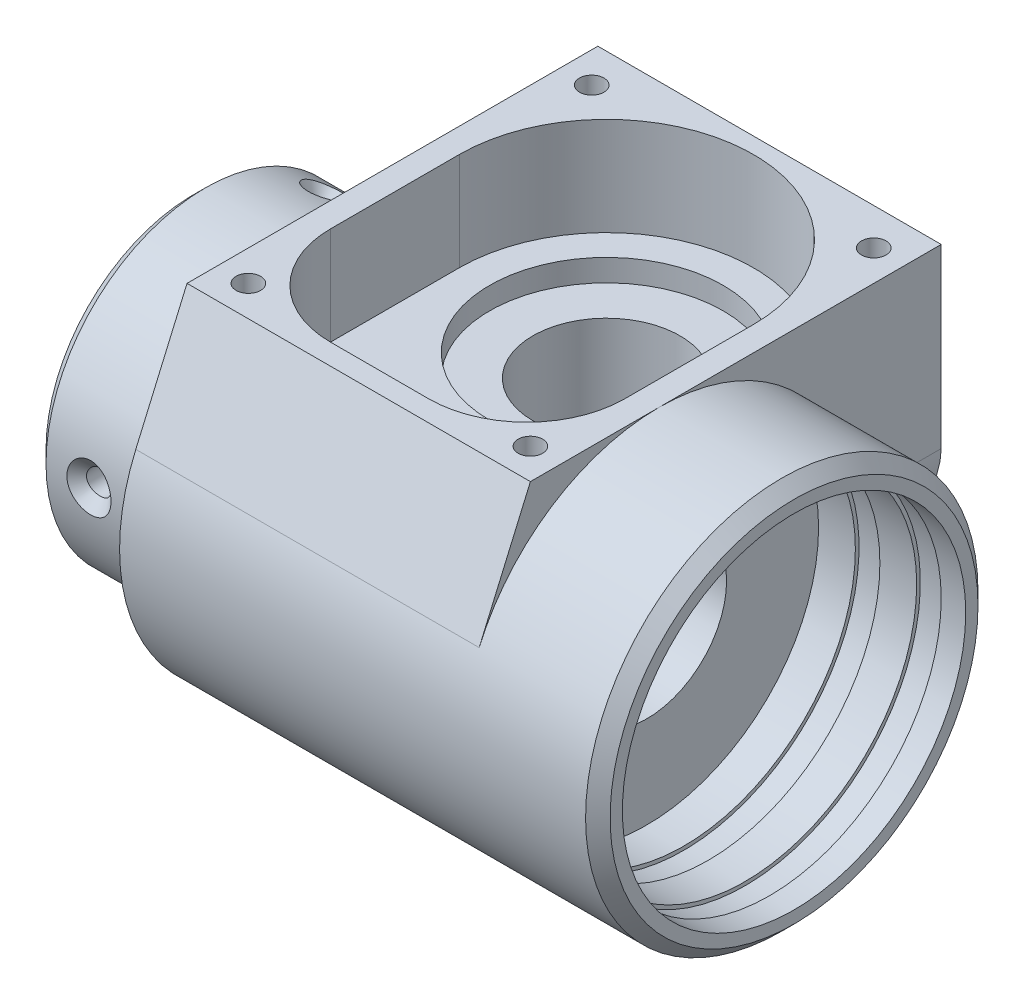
ISO-10303-21;
HEADER;
FILE_DESCRIPTION(('STEP AP214'),'2;1');
FILE_NAME('part.step','',(''),(''),'','','');
FILE_SCHEMA(('AUTOMOTIVE_DESIGN { 1 0 10303 214 1 1 1 1 }'));
ENDSEC;
DATA;
#1=APPLICATION_CONTEXT('core data for automotive mechanical design processes');
#2=APPLICATION_PROTOCOL_DEFINITION('international standard','automotive_design',2000,#1);
#3=PRODUCT_CONTEXT('',#1,'mechanical');
#4=PRODUCT('Part','Part','',(#3));
#5=PRODUCT_RELATED_PRODUCT_CATEGORY('part','',(#4));
#6=PRODUCT_DEFINITION_FORMATION('','',#4);
#7=PRODUCT_DEFINITION_CONTEXT('part definition',#1,'design');
#8=PRODUCT_DEFINITION('design','',#6,#7);
#9=PRODUCT_DEFINITION_SHAPE('','',#8);
#10=(LENGTH_UNIT() NAMED_UNIT(*) SI_UNIT(.MILLI.,.METRE.));
#11=(NAMED_UNIT(*) PLANE_ANGLE_UNIT() SI_UNIT($,.RADIAN.));
#12=(NAMED_UNIT(*) SI_UNIT($,.STERADIAN.) SOLID_ANGLE_UNIT());
#13=UNCERTAINTY_MEASURE_WITH_UNIT(LENGTH_MEASURE(1.E-05),#10,'distance_accuracy_value','');
#14=(GEOMETRIC_REPRESENTATION_CONTEXT(3) GLOBAL_UNCERTAINTY_ASSIGNED_CONTEXT((#13)) GLOBAL_UNIT_ASSIGNED_CONTEXT((#10,
#11,#12)) REPRESENTATION_CONTEXT('',''));
#15=CARTESIAN_POINT('',(0.,0.,0.));
#16=DIRECTION('',(0.,0.,1.));
#17=DIRECTION('',(1.,0.,0.));
#18=AXIS2_PLACEMENT_3D('',#15,#16,#17);
#19=CARTESIAN_POINT('',(13.,0.,0.));
#20=DIRECTION('',(1.,0.,0.));
#21=DIRECTION('',(0.,0.,-1.));
#22=AXIS2_PLACEMENT_3D('',#19,#20,#21);
#23=CYLINDRICAL_SURFACE('',#22,14.);
#24=CARTESIAN_POINT('',(13.,0.,0.));
#25=DIRECTION('',(1.,0.,0.));
#26=DIRECTION('',(0.,0.,-1.));
#27=AXIS2_PLACEMENT_3D('',#24,#25,#26);
#28=CIRCLE('',#27,14.);
#29=CARTESIAN_POINT('',(13.,0.,-14.));
#30=VERTEX_POINT('',#29);
#31=EDGE_CURVE('E693',#30,#30,#28,.T.);
#32=ORIENTED_EDGE('',*,*,#31,.F.);
#33=EDGE_LOOP('',(#32));
#34=FACE_BOUND('',#33,.T.);
#35=CARTESIAN_POINT('',(16.,0.,0.));
#36=DIRECTION('',(1.,0.,0.));
#37=DIRECTION('',(0.,0.,-1.));
#38=AXIS2_PLACEMENT_3D('',#35,#36,#37);
#39=CIRCLE('',#38,14.);
#40=CARTESIAN_POINT('',(16.,0.,-14.));
#41=VERTEX_POINT('',#40);
#42=EDGE_CURVE('E384',#41,#41,#39,.F.);
#43=ORIENTED_EDGE('',*,*,#42,.F.);
#44=EDGE_LOOP('',(#43));
#45=FACE_BOUND('',#44,.T.);
#46=ADVANCED_FACE('F34',(#34,#45),#23,.F.);
#47=CARTESIAN_POINT('',(25.,0.,0.));
#48=DIRECTION('',(1.,0.,0.));
#49=DIRECTION('',(0.,0.,-1.));
#50=AXIS2_PLACEMENT_3D('',#47,#48,#49);
#51=CIRCLE('',#50,14.);
#52=CARTESIAN_POINT('',(25.,0.,-14.));
#53=VERTEX_POINT('',#52);
#54=EDGE_CURVE('E695',#53,#53,#51,.T.);
#55=ORIENTED_EDGE('',*,*,#54,.T.);
#56=EDGE_LOOP('',(#55));
#57=FACE_BOUND('',#56,.T.);
#58=CARTESIAN_POINT('',(23.,0.,0.));
#59=DIRECTION('',(-1.,0.,0.));
#60=DIRECTION('',(0.,0.,1.));
#61=AXIS2_PLACEMENT_3D('',#58,#59,#60);
#62=CIRCLE('',#61,14.);
#63=CARTESIAN_POINT('',(23.,0.,14.));
#64=VERTEX_POINT('',#63);
#65=EDGE_CURVE('E387',#64,#64,#62,.F.);
#66=ORIENTED_EDGE('',*,*,#65,.F.);
#67=EDGE_LOOP('',(#66));
#68=FACE_BOUND('',#67,.T.);
#69=ADVANCED_FACE('F351',(#57,#68),#23,.F.);
#70=CARTESIAN_POINT('',(-37.8630597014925,0.,0.));
#71=DIRECTION('',(-1.,0.,0.));
#72=DIRECTION('',(0.,0.,1.));
#73=AXIS2_PLACEMENT_3D('',#70,#71,#72);
#74=CYLINDRICAL_SURFACE('',#73,13.);
#75=CARTESIAN_POINT('',(-19.5,-12.0452763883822,-4.88991991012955));
#76=CARTESIAN_POINT('',(-19.5276255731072,-12.0452850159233,-4.88990000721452));
#77=CARTESIAN_POINT('',(-19.5552503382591,-12.0450148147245,-4.89058958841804));
#78=CARTESIAN_POINT('',(-19.610399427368,-12.0439196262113,-4.89335823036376));
#79=CARTESIAN_POINT('',(-19.6379238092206,-12.0430950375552,-4.8954362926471));
#80=CARTESIAN_POINT('',(-19.6928129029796,-12.0408939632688,-4.90095242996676));
#81=CARTESIAN_POINT('',(-19.7201776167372,-12.0395174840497,-4.90439048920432));
#82=CARTESIAN_POINT('',(-19.7746892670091,-12.0362158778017,-4.91259625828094));
#83=CARTESIAN_POINT('',(-19.8018360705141,-12.0342904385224,-4.91736472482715));
#84=CARTESIAN_POINT('',(-19.8558535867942,-12.0298939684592,-4.92820145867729));
#85=CARTESIAN_POINT('',(-19.8827239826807,-12.027422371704,-4.93427107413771));
#86=CARTESIAN_POINT('',(-19.9361304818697,-12.0219366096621,-4.94768035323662));
#87=CARTESIAN_POINT('',(-19.9626660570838,-12.0189216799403,-4.95502180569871));
#88=CARTESIAN_POINT('',(-20.0153447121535,-12.0123522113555,-4.97094517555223));
#89=CARTESIAN_POINT('',(-20.0414870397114,-12.0087967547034,-4.97952920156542));
#90=CARTESIAN_POINT('',(-20.0933210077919,-12.0011491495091,-4.99790824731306));
#91=CARTESIAN_POINT('',(-20.1190116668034,-11.9970559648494,-5.00770560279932));
#92=CARTESIAN_POINT('',(-20.1698841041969,-11.9883357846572,-5.0284819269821));
#93=CARTESIAN_POINT('',(-20.195064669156,-11.9837076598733,-5.03946339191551));
#94=CARTESIAN_POINT('',(-20.2448587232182,-11.9739204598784,-5.06257862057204));
#95=CARTESIAN_POINT('',(-20.2694707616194,-11.9687601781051,-5.07471499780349));
#96=CARTESIAN_POINT('',(-20.3180695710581,-11.9579114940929,-5.10011076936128));
#97=CARTESIAN_POINT('',(-20.342054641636,-11.9522218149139,-5.1133728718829));
#98=CARTESIAN_POINT('',(-20.3893413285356,-11.9403172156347,-5.14099086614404));
#99=CARTESIAN_POINT('',(-20.4126409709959,-11.9341009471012,-5.15534955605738));
#100=CARTESIAN_POINT('',(-20.4584986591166,-11.9211458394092,-5.18513137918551));
#101=CARTESIAN_POINT('',(-20.4810544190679,-11.914405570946,-5.20055741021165));
#102=CARTESIAN_POINT('',(-20.5253661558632,-11.900405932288,-5.23244501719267));
#103=CARTESIAN_POINT('',(-20.547119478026,-11.8931450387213,-5.24890961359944));
#104=CARTESIAN_POINT('',(-20.5897685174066,-11.8781046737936,-5.28284371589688));
#105=CARTESIAN_POINT('',(-20.6106611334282,-11.870323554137,-5.30031638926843));
#106=CARTESIAN_POINT('',(-20.6515298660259,-11.8542543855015,-5.33624241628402));
#107=CARTESIAN_POINT('',(-20.6715023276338,-11.8459645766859,-5.35469914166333));
#108=CARTESIAN_POINT('',(-20.7104568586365,-11.8288565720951,-5.39252599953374));
#109=CARTESIAN_POINT('',(-20.7294356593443,-11.8200368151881,-5.41189879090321));
#110=CARTESIAN_POINT('',(-20.7663603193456,-11.801864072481,-5.45146247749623));
#111=CARTESIAN_POINT('',(-20.7843035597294,-11.7925098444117,-5.47165524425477));
#112=CARTESIAN_POINT('',(-20.8191306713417,-11.7732977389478,-5.51280421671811));
#113=CARTESIAN_POINT('',(-20.8360116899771,-11.7634386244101,-5.53376225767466));
#114=CARTESIAN_POINT('',(-20.8686889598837,-11.7432350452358,-5.5763807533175));
#115=CARTESIAN_POINT('',(-20.8844822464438,-11.732889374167,-5.59804290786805));
#116=CARTESIAN_POINT('',(-20.9149582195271,-11.7117339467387,-5.64201041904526));
#117=CARTESIAN_POINT('',(-20.929637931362,-11.7009230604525,-5.6643172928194));
#118=CARTESIAN_POINT('',(-20.9578609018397,-11.6788576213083,-5.70951460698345));
#119=CARTESIAN_POINT('',(-20.9714012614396,-11.6676020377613,-5.7324063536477));
#120=CARTESIAN_POINT('',(-20.99731956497,-11.6446678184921,-5.77871392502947));
#121=CARTESIAN_POINT('',(-21.0096947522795,-11.6329882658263,-5.8021308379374));
#122=CARTESIAN_POINT('',(-21.0332566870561,-11.6092266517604,-5.84942922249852));
#123=CARTESIAN_POINT('',(-21.0444408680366,-11.5971437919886,-5.87331157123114));
#124=CARTESIAN_POINT('',(-21.0655947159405,-11.5725961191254,-5.9214813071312));
#125=CARTESIAN_POINT('',(-21.0755620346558,-11.5601306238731,-5.94576937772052));
#126=CARTESIAN_POINT('',(-21.094256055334,-11.534838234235,-5.99469101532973));
#127=CARTESIAN_POINT('',(-21.1029806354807,-11.5220107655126,-6.01932509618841));
#128=CARTESIAN_POINT('',(-21.1191630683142,-11.4960149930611,-6.06887918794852));
#129=CARTESIAN_POINT('',(-21.1266190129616,-11.4828462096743,-6.09379957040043));
#130=CARTESIAN_POINT('',(-21.1402380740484,-11.4561883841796,-6.14386667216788));
#131=CARTESIAN_POINT('',(-21.1463994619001,-11.4426989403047,-6.16901364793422));
#132=CARTESIAN_POINT('',(-21.1574033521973,-11.415420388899,-6.21947431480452));
#133=CARTESIAN_POINT('',(-21.1622442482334,-11.4016309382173,-6.24478817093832));
#134=CARTESIAN_POINT('',(-21.1705811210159,-11.3737729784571,-6.29552296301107));
#135=CARTESIAN_POINT('',(-21.1740755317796,-11.3597041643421,-6.32094398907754));
#136=CARTESIAN_POINT('',(-21.1796936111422,-11.3313081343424,-6.37183344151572));
#137=CARTESIAN_POINT('',(-21.1818156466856,-11.3169806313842,-6.39730188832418));
#138=CARTESIAN_POINT('',(-21.1846627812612,-11.2880877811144,-6.44822661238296));
#139=CARTESIAN_POINT('',(-21.1853860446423,-11.2735221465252,-6.47368282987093));
#140=CARTESIAN_POINT('',(-21.1854113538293,-11.2441968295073,-6.52448366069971));
#141=CARTESIAN_POINT('',(-21.1847134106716,-11.2294371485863,-6.54982827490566));
#142=CARTESIAN_POINT('',(-21.1819193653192,-11.1997876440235,-6.60031807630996));
#143=CARTESIAN_POINT('',(-21.1798251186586,-11.1848980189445,-6.62546348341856));
#144=CARTESIAN_POINT('',(-21.1742640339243,-11.1550298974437,-6.67550725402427));
#145=CARTESIAN_POINT('',(-21.170798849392,-11.1400515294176,-6.70040587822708));
#146=CARTESIAN_POINT('',(-21.1625217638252,-11.110047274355,-6.74990836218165));
#147=CARTESIAN_POINT('',(-21.1577114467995,-11.0950214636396,-6.77451253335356));
#148=CARTESIAN_POINT('',(-21.1467697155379,-11.0649636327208,-6.82337840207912));
#149=CARTESIAN_POINT('',(-21.1406399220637,-11.0499316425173,-6.84764048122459));
#150=CARTESIAN_POINT('',(-21.1270847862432,-11.0199027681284,-6.8957744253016));
#151=CARTESIAN_POINT('',(-21.1196611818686,-11.0049058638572,-6.91964676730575));
#152=CARTESIAN_POINT('',(-21.1035438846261,-10.9749884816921,-6.96695346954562));
#153=CARTESIAN_POINT('',(-21.0948521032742,-10.9600679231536,-6.99038843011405));
#154=CARTESIAN_POINT('',(-21.0762238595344,-10.9303445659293,-7.03677257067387));
#155=CARTESIAN_POINT('',(-21.0662895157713,-10.9155416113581,-7.05972250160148));
#156=CARTESIAN_POINT('',(-21.0452015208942,-10.8860948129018,-7.10508875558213));
#157=CARTESIAN_POINT('',(-21.034050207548,-10.8714507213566,-7.12750600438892));
#158=CARTESIAN_POINT('',(-21.0105536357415,-10.8423630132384,-7.1717590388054));
#159=CARTESIAN_POINT('',(-20.9982109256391,-10.8279190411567,-7.19359594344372));
#160=CARTESIAN_POINT('',(-20.972356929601,-10.7992729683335,-7.23664042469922));
#161=CARTESIAN_POINT('',(-20.9588483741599,-10.7850703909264,-7.25784932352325));
#162=CARTESIAN_POINT('',(-20.9306880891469,-10.7569484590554,-7.29958988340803));
#163=CARTESIAN_POINT('',(-20.9160392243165,-10.7430284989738,-7.32012306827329));
#164=CARTESIAN_POINT('',(-20.8856237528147,-10.7155133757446,-7.36046442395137));
#165=CARTESIAN_POINT('',(-20.8698600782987,-10.7019174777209,-7.3802743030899));
#166=CARTESIAN_POINT('',(-20.8372405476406,-10.6750912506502,-7.41912080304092));
#167=CARTESIAN_POINT('',(-20.8203876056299,-10.6618600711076,-7.43815928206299));
#168=CARTESIAN_POINT('',(-20.7856149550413,-10.6358070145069,-7.47541658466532));
#169=CARTESIAN_POINT('',(-20.7676980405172,-10.6229841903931,-7.49363735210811));
#170=CARTESIAN_POINT('',(-20.7308238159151,-10.5977804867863,-7.52920617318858));
#171=CARTESIAN_POINT('',(-20.7118690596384,-10.5853986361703,-7.54655618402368));
#172=CARTESIAN_POINT('',(-20.6729625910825,-10.5611631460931,-7.580338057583));
#173=CARTESIAN_POINT('',(-20.6530141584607,-10.5493079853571,-7.59677260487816));
#174=CARTESIAN_POINT('',(-20.6121950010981,-10.5261964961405,-7.62870646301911));
#175=CARTESIAN_POINT('',(-20.5913280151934,-10.5149380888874,-7.64420904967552));
#176=CARTESIAN_POINT('',(-20.5487307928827,-10.4930353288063,-7.67425687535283));
#177=CARTESIAN_POINT('',(-20.5270037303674,-10.4823890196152,-7.68880518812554));
#178=CARTESIAN_POINT('',(-20.4827444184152,-10.4617366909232,-7.71692897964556));
#179=CARTESIAN_POINT('',(-20.4602148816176,-10.4517287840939,-7.73050734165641));
#180=CARTESIAN_POINT('',(-20.4144088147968,-10.4323765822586,-7.7566739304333));
#181=CARTESIAN_POINT('',(-20.3911346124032,-10.4230304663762,-7.76926488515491));
#182=CARTESIAN_POINT('',(-20.3438972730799,-10.4050259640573,-7.79343979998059));
#183=CARTESIAN_POINT('',(-20.3199361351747,-10.3963658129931,-7.80502635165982));
#184=CARTESIAN_POINT('',(-20.271382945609,-10.3797571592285,-7.82717545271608));
#185=CARTESIAN_POINT('',(-20.2467926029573,-10.3718069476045,-7.8377404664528));
#186=CARTESIAN_POINT('',(-20.1970389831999,-10.3566421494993,-7.85782950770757));
#187=CARTESIAN_POINT('',(-20.1718771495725,-10.3494259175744,-7.86735586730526));
#188=CARTESIAN_POINT('',(-20.1210385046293,-10.3357530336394,-7.88535061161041));
#189=CARTESIAN_POINT('',(-20.095362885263,-10.3292948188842,-7.89382117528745));
#190=CARTESIAN_POINT('',(-20.0435546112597,-10.3171619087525,-7.90968736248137));
#191=CARTESIAN_POINT('',(-20.0174229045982,-10.3114857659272,-7.91708497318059));
#192=CARTESIAN_POINT('',(-19.9647603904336,-10.3009409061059,-7.93078832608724));
#193=CARTESIAN_POINT('',(-19.9382302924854,-10.2960709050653,-7.93709580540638));
#194=CARTESIAN_POINT('',(-19.8848289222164,-10.2871621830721,-7.94860203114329));
#195=CARTESIAN_POINT('',(-19.8579581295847,-10.2831224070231,-7.95380218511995));
#196=CARTESIAN_POINT('',(-19.8039332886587,-10.2758979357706,-7.96307695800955));
#197=CARTESIAN_POINT('',(-19.7767795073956,-10.2727124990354,-7.96715255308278));
#198=CARTESIAN_POINT('',(-19.7222465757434,-10.2672203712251,-7.97416157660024));
#199=CARTESIAN_POINT('',(-19.6948675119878,-10.2649133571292,-7.97709542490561));
#200=CARTESIAN_POINT('',(-19.6399419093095,-10.2612018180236,-7.98180419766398));
#201=CARTESIAN_POINT('',(-19.6123953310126,-10.2597975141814,-7.98357883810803));
#202=CARTESIAN_POINT('',(-19.5571923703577,-10.2579143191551,-7.98595352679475));
#203=CARTESIAN_POINT('',(-19.5295359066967,-10.2574363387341,-7.98655241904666));
#204=CARTESIAN_POINT('',(-19.4742100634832,-10.2574311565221,-7.98655659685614));
#205=CARTESIAN_POINT('',(-19.4465406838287,-10.2579043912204,-7.98596133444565));
#206=CARTESIAN_POINT('',(-19.3912884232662,-10.2597808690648,-7.98359014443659));
#207=CARTESIAN_POINT('',(-19.3637055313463,-10.2611839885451,-7.98181437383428));
#208=CARTESIAN_POINT('',(-19.308687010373,-10.2648944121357,-7.97710173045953));
#209=CARTESIAN_POINT('',(-19.2812514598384,-10.2672021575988,-7.97416429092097));
#210=CARTESIAN_POINT('',(-19.2265885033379,-10.2726968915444,-7.96714670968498));
#211=CARTESIAN_POINT('',(-19.1993613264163,-10.2758847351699,-7.96306545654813));
#212=CARTESIAN_POINT('',(-19.1451758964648,-10.2831146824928,-7.95377872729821));
#213=CARTESIAN_POINT('',(-19.1182180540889,-10.2871579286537,-7.94857174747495));
#214=CARTESIAN_POINT('',(-19.0646320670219,-10.2960738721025,-7.93705182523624));
#215=CARTESIAN_POINT('',(-19.0380045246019,-10.3009478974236,-7.93073711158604));
#216=CARTESIAN_POINT('',(-18.9851399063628,-10.3115006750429,-7.91701987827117));
#217=CARTESIAN_POINT('',(-18.9589036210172,-10.3171808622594,-7.9096154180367));
#218=CARTESIAN_POINT('',(-18.9068822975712,-10.3293213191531,-7.8937367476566));
#219=CARTESIAN_POINT('',(-18.8810982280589,-10.3357830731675,-7.88526050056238));
#220=CARTESIAN_POINT('',(-18.8300421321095,-10.3494620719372,-7.86725624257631));
#221=CARTESIAN_POINT('',(-18.804771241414,-10.3566808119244,-7.85772614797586));
#222=CARTESIAN_POINT('',(-18.7548023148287,-10.3718492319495,-7.83763213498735));
#223=CARTESIAN_POINT('',(-18.7301055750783,-10.3798003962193,-7.82706611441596));
#224=CARTESIAN_POINT('',(-18.6813457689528,-10.3964091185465,-7.80491815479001));
#225=CARTESIAN_POINT('',(-18.6572841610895,-10.4050681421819,-7.79333410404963));
#226=CARTESIAN_POINT('',(-18.6098554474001,-10.4230681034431,-7.76916801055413));
#227=CARTESIAN_POINT('',(-18.5864899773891,-10.4324104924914,-7.75658383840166));
#228=CARTESIAN_POINT('',(-18.5405143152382,-10.451752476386,-7.73043532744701));
#229=CARTESIAN_POINT('',(-18.5179059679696,-10.4617535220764,-7.71686881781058));
#230=CARTESIAN_POINT('',(-18.4735054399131,-10.4823889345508,-7.68877389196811));
#231=CARTESIAN_POINT('',(-18.4517153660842,-10.4930247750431,-7.67424322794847));
#232=CARTESIAN_POINT('',(-18.4090116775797,-10.5149027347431,-7.64423674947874));
#233=CARTESIAN_POINT('',(-18.3881005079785,-10.5261463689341,-7.62875855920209));
#234=CARTESIAN_POINT('',(-18.347216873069,-10.5492246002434,-7.59687960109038));
#235=CARTESIAN_POINT('',(-18.3272473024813,-10.5610608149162,-7.58047629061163));
#236=CARTESIAN_POINT('',(-18.2883125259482,-10.5852578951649,-7.54675773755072));
#237=CARTESIAN_POINT('',(-18.2693501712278,-10.597620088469,-7.52944015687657));
#238=CARTESIAN_POINT('',(-18.2324606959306,-10.6227866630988,-7.49393271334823));
#239=CARTESIAN_POINT('',(-18.2145362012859,-10.6355920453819,-7.47574083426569));
#240=CARTESIAN_POINT('',(-18.1797492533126,-10.6616126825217,-7.4385377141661));
#241=CARTESIAN_POINT('',(-18.162889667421,-10.6748289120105,-7.41952447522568));
#242=CARTESIAN_POINT('',(-18.1302574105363,-10.7016271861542,-7.38072558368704));
#243=CARTESIAN_POINT('',(-18.1144877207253,-10.7152101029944,-7.36093802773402));
#244=CARTESIAN_POINT('',(-18.0840608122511,-10.7427009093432,-7.32063894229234));
#245=CARTESIAN_POINT('',(-18.0694065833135,-10.7566095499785,-7.30012566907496));
#246=CARTESIAN_POINT('',(-18.0412361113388,-10.784710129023,-7.25842311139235));
#247=CARTESIAN_POINT('',(-18.027722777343,-10.7989026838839,-7.23723227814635));
#248=CARTESIAN_POINT('',(-18.00185974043,-10.827529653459,-7.19422264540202));
#249=CARTESIAN_POINT('',(-17.98951279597,-10.841964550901,-7.17240250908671));
#250=CARTESIAN_POINT('',(-17.9660082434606,-10.8710347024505,-7.12818227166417));
#251=CARTESIAN_POINT('',(-17.954853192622,-10.8856703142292,-7.10578104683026));
#252=CARTESIAN_POINT('',(-17.9337581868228,-10.9151003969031,-7.06044664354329));
#253=CARTESIAN_POINT('',(-17.9238205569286,-10.9298951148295,-7.0375125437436));
#254=CARTESIAN_POINT('',(-17.9051861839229,-10.9596018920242,-6.99116041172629));
#255=CARTESIAN_POINT('',(-17.8964915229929,-10.9745141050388,-6.96774164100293));
#256=CARTESIAN_POINT('',(-17.8803688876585,-11.004414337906,-6.92046820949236));
#257=CARTESIAN_POINT('',(-17.8729427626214,-11.019402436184,-6.89661296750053));
#258=CARTESIAN_POINT('',(-17.8593829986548,-11.0494128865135,-6.84851465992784));
#259=CARTESIAN_POINT('',(-17.8532510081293,-11.0644352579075,-6.82427114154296));
#260=CARTESIAN_POINT('',(-17.8423052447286,-11.094472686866,-6.7754443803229));
#261=CARTESIAN_POINT('',(-17.8374929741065,-11.1094877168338,-6.75086078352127));
#262=CARTESIAN_POINT('',(-17.8292124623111,-11.1394688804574,-6.70140197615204));
#263=CARTESIAN_POINT('',(-17.8257456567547,-11.1544349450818,-6.67652648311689));
#264=CARTESIAN_POINT('',(-17.8201813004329,-11.1842766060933,-6.62653208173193));
#265=CARTESIAN_POINT('',(-17.8180852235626,-11.1991520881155,-6.60141294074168));
#266=CARTESIAN_POINT('',(-17.8152893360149,-11.228770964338,-6.55097922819));
#267=CARTESIAN_POINT('',(-17.8145911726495,-11.2435141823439,-6.52566446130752));
#268=CARTESIAN_POINT('',(-17.8146108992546,-11.2728073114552,-6.4749226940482));
#269=CARTESIAN_POINT('',(-17.8153288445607,-11.2873572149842,-6.44949568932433));
#270=CARTESIAN_POINT('',(-17.8181542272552,-11.3162227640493,-6.39862397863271));
#271=CARTESIAN_POINT('',(-17.8202601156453,-11.3305386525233,-6.37317932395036));
#272=CARTESIAN_POINT('',(-17.8258382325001,-11.3589151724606,-6.32233222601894));
#273=CARTESIAN_POINT('',(-17.8293090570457,-11.3729760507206,-6.29692976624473));
#274=CARTESIAN_POINT('',(-17.8375921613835,-11.4008216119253,-6.24622713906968));
#275=CARTESIAN_POINT('',(-17.8424030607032,-11.4146065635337,-6.22092689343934));
#276=CARTESIAN_POINT('',(-17.8533420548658,-11.4418792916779,-6.17048872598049));
#277=CARTESIAN_POINT('',(-17.8594686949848,-11.455367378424,-6.14535065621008));
#278=CARTESIAN_POINT('',(-17.8730148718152,-11.4820253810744,-6.09529689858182));
#279=CARTESIAN_POINT('',(-17.8804328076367,-11.4951956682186,-6.07038097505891));
#280=CARTESIAN_POINT('',(-17.8965373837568,-11.5211970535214,-6.0208315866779));
#281=CARTESIAN_POINT('',(-17.9052222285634,-11.534028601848,-5.99619777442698));
#282=CARTESIAN_POINT('',(-17.9238364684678,-11.5593314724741,-5.94727271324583));
#283=CARTESIAN_POINT('',(-17.9337638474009,-11.5718033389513,-5.92298097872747));
#284=CARTESIAN_POINT('',(-17.9548390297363,-11.5963657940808,-5.87480020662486));
#285=CARTESIAN_POINT('',(-17.9659845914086,-11.6084570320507,-5.85091051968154));
#286=CARTESIAN_POINT('',(-17.9894720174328,-11.6322371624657,-5.80359400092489));
#287=CARTESIAN_POINT('',(-18.0018114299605,-11.6439268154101,-5.78016633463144));
#288=CARTESIAN_POINT('',(-18.0276624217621,-11.6668827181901,-5.73383404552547));
#289=CARTESIAN_POINT('',(-18.0411713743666,-11.6781498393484,-5.71092838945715));
#290=CARTESIAN_POINT('',(-18.0693372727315,-11.7002395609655,-5.66570029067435));
#291=CARTESIAN_POINT('',(-18.0839914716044,-11.7110631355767,-5.64337661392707));
#292=CARTESIAN_POINT('',(-18.1144236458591,-11.7322448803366,-5.59937276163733));
#293=CARTESIAN_POINT('',(-18.1301988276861,-11.7426041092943,-5.57769116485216));
#294=CARTESIAN_POINT('',(-18.1628486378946,-11.7628354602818,-5.53503130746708));
#295=CARTESIAN_POINT('',(-18.1797205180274,-11.7727086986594,-5.51405147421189));
#296=CARTESIAN_POINT('',(-18.2145394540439,-11.7919495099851,-5.47285656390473));
#297=CARTESIAN_POINT('',(-18.232483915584,-11.801318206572,-5.45263982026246));
#298=CARTESIAN_POINT('',(-18.2694230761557,-11.8195198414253,-5.41302640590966));
#299=CARTESIAN_POINT('',(-18.2884154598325,-11.8283538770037,-5.39362808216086));
#300=CARTESIAN_POINT('',(-18.327405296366,-11.8454894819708,-5.35575073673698));
#301=CARTESIAN_POINT('',(-18.3473996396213,-11.8537925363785,-5.33726918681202));
#302=CARTESIAN_POINT('',(-18.3883149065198,-11.8698867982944,-5.30129576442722));
#303=CARTESIAN_POINT('',(-18.4092321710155,-11.8776797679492,-5.28380051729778));
#304=CARTESIAN_POINT('',(-18.4519331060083,-11.89274243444,-5.24982341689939));
#305=CARTESIAN_POINT('',(-18.473713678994,-11.9000137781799,-5.23333840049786));
#306=CARTESIAN_POINT('',(-18.5180817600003,-11.9140332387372,-5.20141152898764));
#307=CARTESIAN_POINT('',(-18.5406666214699,-11.9207828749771,-5.18596666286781));
#308=CARTESIAN_POINT('',(-18.5865837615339,-11.9337558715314,-5.15614830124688));
#309=CARTESIAN_POINT('',(-18.6099137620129,-11.9399806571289,-5.14177191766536));
#310=CARTESIAN_POINT('',(-18.6572617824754,-11.9519016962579,-5.11411919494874));
#311=CARTESIAN_POINT('',(-18.6812778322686,-11.9575992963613,-5.1008400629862));
#312=CARTESIAN_POINT('',(-18.7299386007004,-11.9684634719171,-5.07541043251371));
#313=CARTESIAN_POINT('',(-18.7545816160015,-11.973631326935,-5.06325722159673));
#314=CARTESIAN_POINT('',(-18.8044370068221,-11.9834335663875,-5.0401080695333));
#315=CARTESIAN_POINT('',(-18.8296479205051,-11.9880691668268,-5.02910949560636));
#316=CARTESIAN_POINT('',(-18.8805798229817,-11.9968044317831,-5.00829824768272));
#317=CARTESIAN_POINT('',(-18.9062995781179,-12.0009052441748,-4.99848303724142));
#318=CARTESIAN_POINT('',(-18.9581898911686,-12.0085684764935,-4.98006713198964));
#319=CARTESIAN_POINT('',(-18.9843594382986,-12.0121319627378,-4.97146403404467));
#320=CARTESIAN_POINT('',(-19.0370900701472,-12.018718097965,-4.95550093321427));
#321=CARTESIAN_POINT('',(-19.0636503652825,-12.0217417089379,-4.948138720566));
#322=CARTESIAN_POINT('',(-19.1171032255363,-12.0272456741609,-4.93468590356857));
#323=CARTESIAN_POINT('',(-19.143995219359,-12.0297268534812,-4.92859336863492));
#324=CARTESIAN_POINT('',(-19.1980522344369,-12.0341435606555,-4.91770835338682));
#325=CARTESIAN_POINT('',(-19.2252168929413,-12.036079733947,-4.91291433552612));
#326=CARTESIAN_POINT('',(-19.2797599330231,-12.0394041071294,-4.90465460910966));
#327=CARTESIAN_POINT('',(-19.3071381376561,-12.0407927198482,-4.90118789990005));
#328=CARTESIAN_POINT('',(-19.3620492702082,-12.0430195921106,-4.89561118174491));
#329=CARTESIAN_POINT('',(-19.38958216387,-12.0438579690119,-4.89350088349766));
#330=CARTESIAN_POINT('',(-19.4447426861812,-12.0449824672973,-4.89066414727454));
#331=CARTESIAN_POINT('',(-19.4723703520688,-12.0452683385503,-4.88993833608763));
#332=CARTESIAN_POINT('',(-19.5,-12.0452763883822,-4.88991991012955));
#333=B_SPLINE_CURVE_WITH_KNOTS('',3,(#75,#76,#77,#78,#79,#80,#81,#82,#83,#84,#85,#86,#87,#88,
#89,#90,#91,#92,#93,#94,#95,#96,#97,#98,#99,#100,#101,#102,#103,#104,#105,#106,#107,#108,#109,
#110,#111,#112,#113,#114,#115,#116,#117,#118,#119,#120,#121,#122,#123,#124,#125,#126,#127,#128,
#129,#130,#131,#132,#133,#134,#135,#136,#137,#138,#139,#140,#141,#142,#143,#144,#145,#146,#147,
#148,#149,#150,#151,#152,#153,#154,#155,#156,#157,#158,#159,#160,#161,#162,#163,#164,#165,#166,
#167,#168,#169,#170,#171,#172,#173,#174,#175,#176,#177,#178,#179,#180,#181,#182,#183,#184,#185,
#186,#187,#188,#189,#190,#191,#192,#193,#194,#195,#196,#197,#198,#199,#200,#201,#202,#203,#204,
#205,#206,#207,#208,#209,#210,#211,#212,#213,#214,#215,#216,#217,#218,#219,#220,#221,#222,#223,
#224,#225,#226,#227,#228,#229,#230,#231,#232,#233,#234,#235,#236,#237,#238,#239,#240,#241,#242,
#243,#244,#245,#246,#247,#248,#249,#250,#251,#252,#253,#254,#255,#256,#257,#258,#259,#260,#261,
#262,#263,#264,#265,#266,#267,#268,#269,#270,#271,#272,#273,#274,#275,#276,#277,#278,#279,#280,
#281,#282,#283,#284,#285,#286,#287,#288,#289,#290,#291,#292,#293,#294,#295,#296,#297,#298,#299,
#300,#301,#302,#303,#304,#305,#306,#307,#308,#309,#310,#311,#312,#313,#314,#315,#316,#317,#318,
#319,#320,#321,#322,#323,#324,#325,#326,#327,#328,#329,#330,#331,#332),.UNSPECIFIED.,.F.,.F.,(4,
2,2,2,2,2,2,2,2,2,2,2,2,2,2,2,2,2,2,2,2,2,2,2,2,2,2,2,2,2,2,2,2,2,2,2,2,2,2,2,2,2,2,2,2,2,2,2,2,
2,2,2,2,2,2,2,2,2,2,2,2,2,2,2,2,2,2,2,2,2,2,2,2,2,2,2,2,2,2,2,2,2,2,2,2,2,2,2,2,2,2,2,2,2,2,2,2,
2,2,2,2,2,2,2,2,2,2,2,2,2,2,2,2,2,2,2,2,2,2,2,2,2,2,2,2,2,2,2,4),(0.,0.0828642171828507,
0.165668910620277,0.248472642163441,0.331323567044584,0.414260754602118,0.497315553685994,
0.58051298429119,0.663873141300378,0.747412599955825,0.831145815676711,0.915086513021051,
0.99924905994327,1.08364982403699,1.16830850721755,1.25324945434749,1.33850292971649,
1.42402119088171,1.509747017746,1.59569401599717,1.68186668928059,1.76826199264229,
1.85487086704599,1.9416797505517,2.02867206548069,2.11582968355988,2.20313437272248,
2.29056923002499,2.378120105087,2.46577701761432,2.55353557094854,2.64139836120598,
2.72937637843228,2.81735371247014,2.90521436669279,2.99296937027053,3.08062146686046,
3.16816650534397,3.25559483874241,3.34289272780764,3.43004374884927,3.51703020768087,
3.6038345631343,3.69044086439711,3.77683620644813,3.86301220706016,3.94896650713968,
4.03470429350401,4.12023983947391,4.20550969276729,4.2904598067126,4.37512129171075,
4.45951962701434,4.54367591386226,4.62760816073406,4.71133259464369,4.79486499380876,
4.87822203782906,4.96142267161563,5.04448947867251,5.12745005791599,5.21033839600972,
5.2931962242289,5.37607434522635,5.45903391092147,5.54203155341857,5.62501816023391,
5.70804530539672,5.79115340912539,5.87437321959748,5.95772732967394,6.04123171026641,
6.12489724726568,6.20873127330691,6.29273908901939,6.37692547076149,6.46129616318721,
6.54585935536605,6.63062713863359,6.71561694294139,6.80085294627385,6.88631861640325,
6.97199184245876,7.05788670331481,7.14400790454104,7.2303523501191,7.31691069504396,
7.40366887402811,7.49060960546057,7.57771387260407,7.66496238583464,7.75233703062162,
7.83982230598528,7.92740675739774,8.01508440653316,8.10285617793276,8.19073131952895,
8.2786098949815,8.36639056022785,8.45408117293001,8.54168178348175,8.62918603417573,
8.71658256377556,8.80385641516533,8.89099044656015,8.97796674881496,9.06476807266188,
9.15137927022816,9.23778875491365,9.32398998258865,9.40998295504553,9.49577574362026,
9.58138602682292,9.66674534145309,9.75179223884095,9.83655758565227,9.921065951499,
10.0053368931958,10.0893862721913,10.1732275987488,10.2568733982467,10.340336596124,
10.4236319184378,10.506777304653,10.5897953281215,10.6727146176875,10.7555712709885,
10.8384102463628,10.9212867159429),.UNSPECIFIED.);
#334=CARTESIAN_POINT('',(-19.5,-12.0452763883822,-4.88991991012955));
#335=VERTEX_POINT('',#334);
#336=EDGE_CURVE('E575',#335,#335,#333,.F.);
#337=ORIENTED_EDGE('',*,*,#336,.T.);
#338=EDGE_LOOP('',(#337));
#339=FACE_BOUND('',#338,.T.);
#340=CARTESIAN_POINT('',(-19.5,10.2574330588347,-7.98655539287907));
#341=CARTESIAN_POINT('',(-19.5276255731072,10.2574201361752,-7.98657281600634));
#342=CARTESIAN_POINT('',(-19.5552503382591,10.257882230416,-7.98599402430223));
#343=CARTESIAN_POINT('',(-19.610399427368,10.2597323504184,-7.98366124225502));
#344=CARTESIAN_POINT('',(-19.6379238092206,10.2611197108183,-7.98190809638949));
#345=CARTESIAN_POINT('',(-19.6928129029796,10.2647962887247,-7.97724384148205));
#346=CARTESIAN_POINT('',(-19.7201776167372,10.2670854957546,-7.97433274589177));
#347=CARTESIAN_POINT('',(-19.7746892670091,10.2725410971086,-7.96737058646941));
#348=CARTESIAN_POINT('',(-19.8018360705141,10.275707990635,-7.96331887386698));
#349=CARTESIAN_POINT('',(-19.8558535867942,10.2828946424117,-7.95409305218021));
#350=CARTESIAN_POINT('',(-19.8827239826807,10.286915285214,-7.94891777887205));
#351=CARTESIAN_POINT('',(-19.9361304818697,10.2957851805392,-7.93746233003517));
#352=CARTESIAN_POINT('',(-19.9626660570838,10.3006356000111,-7.93118059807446));
#353=CARTESIAN_POINT('',(-20.0153447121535,10.3111409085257,-7.91752958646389));
#354=CARTESIAN_POINT('',(-20.0414870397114,10.3167971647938,-7.91015845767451));
#355=CARTESIAN_POINT('',(-20.0933210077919,10.3288900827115,-7.89434591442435));
#356=CARTESIAN_POINT('',(-20.1190116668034,10.3353282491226,-7.88590243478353));
#357=CARTESIAN_POINT('',(-20.1698841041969,10.3489609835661,-7.86796237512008));
#358=CARTESIAN_POINT('',(-20.195064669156,10.3561571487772,-7.85846356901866));
#359=CARTESIAN_POINT('',(-20.2448587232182,10.3712819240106,-7.8384299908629));
#360=CARTESIAN_POINT('',(-20.2694707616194,10.3792121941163,-7.82789286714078));
#361=CARTESIAN_POINT('',(-20.3180695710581,10.395781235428,-7.80579974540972));
#362=CARTESIAN_POINT('',(-20.3420546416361,10.4044217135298,-7.79424128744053));
#363=CARTESIAN_POINT('',(-20.3893413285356,10.4223872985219,-7.77012260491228));
#364=CARTESIAN_POINT('',(-20.4126409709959,10.4317141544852,-7.75755981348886));
#365=CARTESIAN_POINT('',(-20.4584986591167,10.4510284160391,-7.73144944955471));
#366=CARTESIAN_POINT('',(-20.4810544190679,10.4610176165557,-7.71789919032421));
#367=CARTESIAN_POINT('',(-20.5253661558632,10.4816332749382,-7.6898313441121));
#368=CARTESIAN_POINT('',(-20.547119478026,10.4922615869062,-7.67531092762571));
#369=CARTESIAN_POINT('',(-20.5897685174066,10.5141291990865,-7.64531853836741));
#370=CARTESIAN_POINT('',(-20.6106611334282,10.52537041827,-7.62984355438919));
#371=CARTESIAN_POINT('',(-20.6515298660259,10.5484486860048,-7.59796423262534));
#372=CARTESIAN_POINT('',(-20.6715023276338,10.5602877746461,-7.58155668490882));
#373=CARTESIAN_POINT('',(-20.7104568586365,10.5844927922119,-7.54782728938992));
#374=CARTESIAN_POINT('',(-20.7294356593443,10.5968602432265,-7.53050276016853));
#375=CARTESIAN_POINT('',(-20.7663603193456,10.6220370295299,-7.49498286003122));
#376=CARTESIAN_POINT('',(-20.7843035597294,10.6348473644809,-7.47678547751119));
#377=CARTESIAN_POINT('',(-20.8191306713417,10.6608773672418,-7.43957281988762));
#378=CARTESIAN_POINT('',(-20.8360116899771,10.6740980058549,-7.4205555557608));
#379=CARTESIAN_POINT('',(-20.8686889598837,10.7009049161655,-7.38174949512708));
#380=CARTESIAN_POINT('',(-20.8844822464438,10.7144920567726,-7.36195880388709));
#381=CARTESIAN_POINT('',(-20.9149582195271,10.7419913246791,-7.32165391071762));
#382=CARTESIAN_POINT('',(-20.9296379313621,10.7559042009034,-7.30113797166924));
#383=CARTESIAN_POINT('',(-20.9578609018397,10.7840135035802,-7.25943008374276));
#384=CARTESIAN_POINT('',(-20.9714012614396,10.7982105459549,-7.23823658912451));
#385=CARTESIAN_POINT('',(-20.99731956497,10.8268469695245,-7.19522118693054));
#386=CARTESIAN_POINT('',(-21.0096947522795,10.841286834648,-7.17339794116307));
#387=CARTESIAN_POINT('',(-21.0332566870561,10.870367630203,-7.12917058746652));
#388=CARTESIAN_POINT('',(-21.0444408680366,10.8850089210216,-7.10676534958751));
#389=CARTESIAN_POINT('',(-21.0655947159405,10.914451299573,-7.06142157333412));
#390=CARTESIAN_POINT('',(-21.0755620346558,10.9292526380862,-7.03848210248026));
#391=CARTESIAN_POINT('',(-21.094256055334,10.9589738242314,-6.99211743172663));
#392=CARTESIAN_POINT('',(-21.1029806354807,10.9738938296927,-6.96869147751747));
#393=CARTESIAN_POINT('',(-21.1191630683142,11.0038110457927,-6.92140143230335));
#394=CARTESIAN_POINT('',(-21.1266190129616,11.0188083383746,-6.89753674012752));
#395=CARTESIAN_POINT('',(-21.1402380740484,11.0488388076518,-6.84941683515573));
#396=CARTESIAN_POINT('',(-21.1463994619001,11.0638720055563,-6.82516114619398));
#397=CARTESIAN_POINT('',(-21.1574033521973,11.0939329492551,-6.77630689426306));
#398=CARTESIAN_POINT('',(-21.1622442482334,11.1089606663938,-6.75170795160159));
#399=CARTESIAN_POINT('',(-21.1705811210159,11.1389693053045,-6.70221485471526));
#400=CARTESIAN_POINT('',(-21.1740755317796,11.1539501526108,-6.67732039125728));
#401=CARTESIAN_POINT('',(-21.1796936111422,11.1838236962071,-6.62728398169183));
#402=CARTESIAN_POINT('',(-21.1818156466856,11.1987162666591,-6.60214177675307));
#403=CARTESIAN_POINT('',(-21.1846627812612,11.2283719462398,-6.55165747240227));
#404=CARTESIAN_POINT('',(-21.1853860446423,11.243134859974,-6.5263151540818));
#405=CARTESIAN_POINT('',(-21.1854113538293,11.2724670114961,-6.47551826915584));
#406=CARTESIAN_POINT('',(-21.1847134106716,11.2870362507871,-6.45006370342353));
#407=CARTESIAN_POINT('',(-21.1819193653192,11.3159369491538,-6.39914157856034));
#408=CARTESIAN_POINT('',(-21.1798251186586,11.3302686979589,-6.37367408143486));
#409=CARTESIAN_POINT('',(-21.1742640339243,11.3586738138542,-6.32278564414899));
#410=CARTESIAN_POINT('',(-21.170798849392,11.3727474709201,-6.2973646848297));
#411=CARTESIAN_POINT('',(-21.1625217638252,11.4006157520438,-6.24662899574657));
#412=CARTESIAN_POINT('',(-21.1577114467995,11.4144106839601,-6.22131417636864));
#413=CARTESIAN_POINT('',(-21.1467697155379,11.441700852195,-6.1708503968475));
#414=CARTESIAN_POINT('',(-21.1406399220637,11.4551964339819,-6.14570127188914));
#415=CARTESIAN_POINT('',(-21.1270847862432,11.4818672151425,-6.09562853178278));
#416=CARTESIAN_POINT('',(-21.1196611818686,11.4950428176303,-6.07070466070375));
#417=CARTESIAN_POINT('',(-21.1035438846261,11.5210529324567,-6.02114209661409));
#418=CARTESIAN_POINT('',(-21.0948521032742,11.5338879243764,-5.99650303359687));
#419=CARTESIAN_POINT('',(-21.0762238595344,11.5591960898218,-5.94756978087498));
#420=CARTESIAN_POINT('',(-21.0662895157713,11.5716698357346,-5.9232750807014));
#421=CARTESIAN_POINT('',(-21.0452015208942,11.5962347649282,-5.87509027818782));
#422=CARTESIAN_POINT('',(-21.034050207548,11.6083266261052,-5.85119949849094));
#423=CARTESIAN_POINT('',(-21.0105536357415,11.6321070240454,-5.80388228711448));
#424=CARTESIAN_POINT('',(-20.9982109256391,11.6437963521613,-5.78045498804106));
#425=CARTESIAN_POINT('',(-20.972356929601,11.6667509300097,-5.73412452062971));
#426=CARTESIAN_POINT('',(-20.9588483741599,11.6780170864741,-5.71122027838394));
#427=CARTESIAN_POINT('',(-20.9306880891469,11.700104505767,-5.66599569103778));
#428=CARTESIAN_POINT('',(-20.9160392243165,11.7109267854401,-5.64367405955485));
#429=CARTESIAN_POINT('',(-20.8856237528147,11.7321058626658,-5.59967458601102));
#430=CARTESIAN_POINT('',(-20.8698600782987,11.7424637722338,-5.57799525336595));
#431=CARTESIAN_POINT('',(-20.8372405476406,11.7626927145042,-5.53533980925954));
#432=CARTESIAN_POINT('',(-20.8203876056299,11.7725649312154,-5.51436203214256));
#433=CARTESIAN_POINT('',(-20.7856149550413,11.7918041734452,-5.47317077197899));
#434=CARTESIAN_POINT('',(-20.7676980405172,11.8011724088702,-5.45295549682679));
#435=CARTESIAN_POINT('',(-20.7308238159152,11.8193740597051,-5.41334403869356));
#436=CARTESIAN_POINT('',(-20.7118690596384,11.8282086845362,-5.39394603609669));
#437=CARTESIAN_POINT('',(-20.6729625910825,11.8453469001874,-5.35606654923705));
#438=CARTESIAN_POINT('',(-20.6530141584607,11.8536520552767,-5.33758240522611));
#439=CARTESIAN_POINT('',(-20.6121950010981,11.8697518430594,-5.30160033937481));
#440=CARTESIAN_POINT('',(-20.5913280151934,11.8775482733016,-5.28409897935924));
#441=CARTESIAN_POINT('',(-20.5487307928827,11.8926190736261,-5.25010671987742));
#442=CARTESIAN_POINT('',(-20.5270037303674,11.8998951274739,-5.23361258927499));
#443=CARTESIAN_POINT('',(-20.4827444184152,11.913924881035,-5.20166525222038));
#444=CARTESIAN_POINT('',(-20.4602148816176,11.9206801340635,-5.18620896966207));
#445=CARTESIAN_POINT('',(-20.4144088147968,11.9336649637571,-5.15636617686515));
#446=CARTESIAN_POINT('',(-20.3911346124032,11.9398959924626,-5.14197672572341));
#447=CARTESIAN_POINT('',(-20.3438972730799,11.9518298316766,-5.11429691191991));
#448=CARTESIAN_POINT('',(-20.3199361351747,11.9575340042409,-5.10100372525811));
#449=CARTESIAN_POINT('',(-20.271382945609,11.9684113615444,-5.07554565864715));
#450=CARTESIAN_POINT('',(-20.2467926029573,11.9735858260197,-5.063378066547));
#451=CARTESIAN_POINT('',(-20.1970389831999,11.9834010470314,-5.04020044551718));
#452=CARTESIAN_POINT('',(-20.1718771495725,11.9880430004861,-5.0291878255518));
#453=CARTESIAN_POINT('',(-20.1210385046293,11.9967904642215,-5.00834938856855));
#454=CARTESIAN_POINT('',(-20.095362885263,12.0008970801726,-4.9985211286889));
#455=CARTESIAN_POINT('',(-20.0435546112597,12.0085711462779,-4.98008062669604));
#456=CARTESIAN_POINT('',(-20.0174229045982,12.0121395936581,-4.97146613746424));
#457=CARTESIAN_POINT('',(-19.9647603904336,12.0187346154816,-4.95548234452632));
#458=CARTESIAN_POINT('',(-19.9382302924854,12.0217620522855,-4.9481110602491));
#459=CARTESIAN_POINT('',(-19.8848289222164,12.0272723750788,-4.93464276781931));
#460=CARTESIAN_POINT('',(-19.8579581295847,12.0297559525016,-4.92854414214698));
#461=CARTESIAN_POINT('',(-19.8039332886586,12.0341759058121,-4.91765018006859));
#462=CARTESIAN_POINT('',(-19.7767795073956,12.0361127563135,-4.91285371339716));
#463=CARTESIAN_POINT('',(-19.7222465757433,12.0394366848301,-4.90459287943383));
#464=CARTESIAN_POINT('',(-19.6948675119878,12.0408239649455,-4.90112802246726));
#465=CARTESIAN_POINT('',(-19.6399419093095,12.0430461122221,-4.89555934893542));
#466=CARTESIAN_POINT('',(-19.6123953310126,12.0438808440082,-4.8934558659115));
#467=CARTESIAN_POINT('',(-19.5571923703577,12.0449957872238,-4.89063762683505));
#468=CARTESIAN_POINT('',(-19.5295359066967,12.0452754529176,-4.88992423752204));
#469=CARTESIAN_POINT('',(-19.4742100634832,12.0452764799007,-4.88991766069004));
#470=CARTESIAN_POINT('',(-19.4465406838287,12.0449975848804,-4.89062512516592));
#471=CARTESIAN_POINT('',(-19.3912884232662,12.0438823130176,-4.89343579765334));
#472=CARTESIAN_POINT('',(-19.3637055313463,12.0430460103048,-4.89553882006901));
#473=CARTESIAN_POINT('',(-19.308687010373,12.0408199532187,-4.90110846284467));
#474=CARTESIAN_POINT('',(-19.2812514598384,12.0394299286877,-4.9045757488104));
#475=CARTESIAN_POINT('',(-19.2265885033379,12.036099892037,-4.91284311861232));
#476=CARTESIAN_POINT('',(-19.1993613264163,12.034159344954,-4.91764449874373));
#477=CARTESIAN_POINT('',(-19.1451758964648,12.0297317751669,-4.92854918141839));
#478=CARTESIAN_POINT('',(-19.1182180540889,12.0272440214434,-4.93465422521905));
#479=CARTESIAN_POINT('',(-19.0646320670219,12.0217254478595,-4.94813561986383));
#480=CARTESIAN_POINT('',(-19.0380045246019,12.0186937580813,-4.95551400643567));
#481=CARTESIAN_POINT('',(-18.9851399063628,12.0120906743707,-4.97151159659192));
#482=CARTESIAN_POINT('',(-18.9589036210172,12.0085183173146,-4.98013301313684));
#483=CARTESIAN_POINT('',(-18.9068822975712,12.000837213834,-4.99858629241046));
#484=CARTESIAN_POINT('',(-18.8810982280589,11.9967274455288,-5.00842045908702));
#485=CARTESIAN_POINT('',(-18.8300421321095,11.9879748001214,-5.02926894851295));
#486=CARTESIAN_POINT('',(-18.804771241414,11.9833308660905,-5.04028560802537));
#487=CARTESIAN_POINT('',(-18.7548023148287,11.9735131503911,-5.06346885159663));
#488=CARTESIAN_POINT('',(-18.7301055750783,11.9683382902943,-5.0756377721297));
#489=CARTESIAN_POINT('',(-18.6813457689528,11.9574619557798,-5.10109532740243));
#490=CARTESIAN_POINT('',(-18.6572841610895,11.9517593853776,-5.11438628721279));
#491=CARTESIAN_POINT('',(-18.6098554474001,11.9398309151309,-5.14205775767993));
#492=CARTESIAN_POINT('',(-18.5864899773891,11.9336038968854,-5.15644059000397));
#493=CARTESIAN_POINT('',(-18.5405143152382,11.9206296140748,-5.18626549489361));
#494=CARTESIAN_POINT('',(-18.5179059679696,11.9138811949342,-5.20170990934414));
#495=CARTESIAN_POINT('',(-18.4735054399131,11.8998679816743,-5.23362816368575));
#496=CARTESIAN_POINT('',(-18.4517153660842,11.8926019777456,-5.25010440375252));
#497=CARTESIAN_POINT('',(-18.4090116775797,11.8775545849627,-5.28405451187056));
#498=CARTESIAN_POINT('',(-18.3881005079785,11.8697718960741,-5.30153087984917));
#499=CARTESIAN_POINT('',(-18.347216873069,11.8537030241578,-5.33745669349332));
#500=CARTESIAN_POINT('',(-18.3272473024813,11.8454154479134,-5.35590881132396));
#501=CARTESIAN_POINT('',(-18.2883125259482,11.8283128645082,-5.39372337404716));
#502=CARTESIAN_POINT('',(-18.2693501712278,11.8194964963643,-5.41308813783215));
#503=CARTESIAN_POINT('',(-18.2324606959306,11.8013294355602,-5.45263675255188));
#504=CARTESIAN_POINT('',(-18.2145362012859,11.7919774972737,-5.4728224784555));
#505=CARTESIAN_POINT('',(-18.1797492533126,11.7727689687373,-5.51395857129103));
#506=CARTESIAN_POINT('',(-18.162889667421,11.7629111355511,-5.53491078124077));
#507=CARTESIAN_POINT('',(-18.1302574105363,11.7427094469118,-5.57751821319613));
#508=CARTESIAN_POINT('',(-18.1144877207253,11.7323643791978,-5.59917514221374));
#509=CARTESIAN_POINT('',(-18.0840608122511,11.7112097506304,-5.64313242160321));
#510=CARTESIAN_POINT('',(-18.0694065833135,11.7003990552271,-5.66543429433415));
#511=CARTESIAN_POINT('',(-18.0412361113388,11.6783338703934,-5.71062138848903));
#512=CARTESIAN_POINT('',(-18.027722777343,11.6670783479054,-5.73350791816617));
#513=CARTESIAN_POINT('',(-18.00185974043,11.644144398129,-5.77980441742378));
#514=CARTESIAN_POINT('',(-17.98951279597,11.6324650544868,-5.80321547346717));
#515=CARTESIAN_POINT('',(-17.9660082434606,11.6087042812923,-5.85050108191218));
#516=CARTESIAN_POINT('',(-17.954853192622,11.5966220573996,-5.8743765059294));
#517=CARTESIAN_POINT('',(-17.9337581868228,11.5720763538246,-5.92253090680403));
#518=CARTESIAN_POINT('',(-17.9238205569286,11.5596121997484,-5.94681055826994));
#519=CARTESIAN_POINT('',(-17.9051861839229,11.5343234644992,-5.99571344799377));
#520=CARTESIAN_POINT('',(-17.8964915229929,11.5214983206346,-6.02033718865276));
#521=CARTESIAN_POINT('',(-17.8803688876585,11.495508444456,-6.06986826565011));
#522=CARTESIAN_POINT('',(-17.8729427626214,11.4823432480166,-6.09477596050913));
#523=CARTESIAN_POINT('',(-17.8593829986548,11.4556941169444,-6.14481492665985));
#524=CARTESIAN_POINT('',(-17.8532510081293,11.442209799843,-6.16994644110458));
#525=CARTESIAN_POINT('',(-17.8423052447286,11.4149432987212,-6.22037299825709));
#526=CARTESIAN_POINT('',(-17.8374929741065,11.4011607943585,-6.2456681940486));
#527=CARTESIAN_POINT('',(-17.8292124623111,11.3733187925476,-6.29636204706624));
#528=CARTESIAN_POINT('',(-17.8257456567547,11.3592590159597,-6.3217607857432));
#529=CARTESIAN_POINT('',(-17.8201813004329,11.3308834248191,-6.37260162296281));
#530=CARTESIAN_POINT('',(-17.8180852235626,11.3165673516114,-6.39804373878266));
#531=CARTESIAN_POINT('',(-17.8152893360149,11.2876999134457,-6.44891129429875));
#532=CARTESIAN_POINT('',(-17.8145911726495,11.2731482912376,-6.47433667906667));
#533=CARTESIAN_POINT('',(-17.8146108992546,11.2438511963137,-6.52507615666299));
#534=CARTESIAN_POINT('',(-17.8153288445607,11.2291057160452,-6.55039024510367));
#535=CARTESIAN_POINT('',(-17.8181542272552,11.1994822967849,-6.60082439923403));
#536=CARTESIAN_POINT('',(-17.8202601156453,11.1846045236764,-6.62594464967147));
#537=CARTESIAN_POINT('',(-17.8258382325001,11.1547579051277,-6.67594298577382));
#538=CARTESIAN_POINT('',(-17.8293090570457,11.1397891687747,-6.70082129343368));
#539=CARTESIAN_POINT('',(-17.8375921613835,11.1098021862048,-6.75028757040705));
#540=CARTESIAN_POINT('',(-17.8424030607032,11.0947840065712,-6.77487581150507));
#541=CARTESIAN_POINT('',(-17.8533420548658,11.0647396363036,-6.82371377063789));
#542=CARTESIAN_POINT('',(-17.8594686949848,11.0497134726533,-6.84796383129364));
#543=CARTESIAN_POINT('',(-17.8730148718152,11.0196946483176,-6.89607721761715));
#544=CARTESIAN_POINT('',(-17.8804328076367,11.0047019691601,-6.91994098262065));
#545=CARTESIAN_POINT('',(-17.8965373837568,10.9747916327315,-6.96723353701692));
#546=CARTESIAN_POINT('',(-17.9052222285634,10.9598738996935,-6.99066288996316));
#547=CARTESIAN_POINT('',(-17.9238364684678,10.930154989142,-7.03703834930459));
#548=CARTESIAN_POINT('',(-17.9337638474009,10.9153536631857,-7.05998516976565));
#549=CARTESIAN_POINT('',(-17.9548390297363,10.8859091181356,-7.10534726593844));
#550=CARTESIAN_POINT('',(-17.9659845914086,10.8712656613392,-7.12776342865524));
#551=CARTESIAN_POINT('',(-17.9894720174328,10.8421784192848,-7.17201588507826));
#552=CARTESIAN_POINT('',(-18.0018114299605,10.8277342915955,-7.19385325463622));
#553=CARTESIAN_POINT('',(-18.0276624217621,10.7990873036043,-7.23689979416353));
#554=CARTESIAN_POINT('',(-18.0411713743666,10.7848839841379,-7.25811023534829));
#555=CARTESIAN_POINT('',(-18.0693372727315,10.7567601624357,-7.29985454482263));
#556=CARTESIAN_POINT('',(-18.0839914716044,10.7428390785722,-7.32038987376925));
#557=CARTESIAN_POINT('',(-18.1144236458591,10.7153214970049,-7.36073572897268));
#558=CARTESIAN_POINT('',(-18.1301988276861,10.7017242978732,-7.38054788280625));
#559=CARTESIAN_POINT('',(-18.1628486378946,10.6748954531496,-7.41939867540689));
#560=CARTESIAN_POINT('',(-18.1797205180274,10.6616630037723,-7.43843906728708));
#561=CARTESIAN_POINT('',(-18.2145394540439,10.6356075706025,-7.47569955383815));
#562=CARTESIAN_POINT('',(-18.232483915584,10.62278370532,-7.49392145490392));
#563=CARTESIAN_POINT('',(-18.2694230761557,10.5975782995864,-7.52949124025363));
#564=CARTESIAN_POINT('',(-18.2884154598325,10.5851958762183,-7.54684090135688));
#565=CARTESIAN_POINT('',(-18.327405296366,10.5609609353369,-7.58061944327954));
#566=CARTESIAN_POINT('',(-18.3473996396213,10.5491069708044,-7.5970508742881));
#567=CARTESIAN_POINT('',(-18.3883149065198,10.5260002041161,-7.62897562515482));
#568=CARTESIAN_POINT('',(-18.4092321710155,10.5147453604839,-7.64447215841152));
#569=CARTESIAN_POINT('',(-18.4519331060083,10.4928516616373,-7.67450536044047));
#570=CARTESIAN_POINT('',(-18.473713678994,10.4822108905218,-7.68904503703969));
#571=CARTESIAN_POINT('',(-18.5180817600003,10.4615711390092,-7.71714968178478));
#572=CARTESIAN_POINT('',(-18.5406666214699,10.4515703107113,-7.73071747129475));
#573=CARTESIAN_POINT('',(-18.5865837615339,10.4322333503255,-7.75686159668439));
#574=CARTESIAN_POINT('',(-18.6099137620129,10.4228954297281,-7.76944061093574));
#575=CARTESIAN_POINT('',(-18.6572617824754,10.4049079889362,-7.79359089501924));
#576=CARTESIAN_POINT('',(-18.6812778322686,10.3962567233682,-7.80516472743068));
#577=CARTESIAN_POINT('',(-18.7299386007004,10.379666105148,-7.82728819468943));
#578=CARTESIAN_POINT('',(-18.7545816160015,10.3717250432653,-7.83784029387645));
#579=CARTESIAN_POINT('',(-18.8044370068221,10.3565784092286,-7.85790385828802));
#580=CARTESIAN_POINT('',(-18.8296479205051,10.3493711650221,-7.86741769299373));
#581=CARTESIAN_POINT('',(-18.8805798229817,10.3357157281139,-7.88538827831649));
#582=CARTESIAN_POINT('',(-18.9062995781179,10.3292659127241,-7.89384729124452));
#583=CARTESIAN_POINT('',(-18.9581898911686,10.3171488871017,-7.90969179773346));
#584=CARTESIAN_POINT('',(-18.9843594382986,10.3114801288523,-7.91707941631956));
#585=CARTESIAN_POINT('',(-19.0370900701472,10.3009487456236,-7.93076472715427));
#586=CARTESIAN_POINT('',(-19.0636503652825,10.2960846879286,-7.93706435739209));
#587=CARTESIAN_POINT('',(-19.1171032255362,10.2871861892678,-7.9485573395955));
#588=CARTESIAN_POINT('',(-19.143995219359,10.283150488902,-7.95375237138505));
#589=CARTESIAN_POINT('',(-19.1980522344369,10.2759321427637,-7.96301985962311));
#590=CARTESIAN_POINT('',(-19.2252168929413,10.2727484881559,-7.96709364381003));
#591=CARTESIAN_POINT('',(-19.2797599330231,10.2672575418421,-7.97410249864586));
#592=CARTESIAN_POINT('',(-19.3071381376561,10.2649495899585,-7.97703842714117));
#593=CARTESIAN_POINT('',(-19.3620492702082,10.2612334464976,-7.98175531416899));
#594=CARTESIAN_POINT('',(-19.38958216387,10.2598250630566,-7.98353651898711));
#595=CARTESIAN_POINT('',(-19.4447426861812,10.2579306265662,-7.98592873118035));
#596=CARTESIAN_POINT('',(-19.4723703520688,10.2574449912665,-7.98653920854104));
#597=CARTESIAN_POINT('',(-19.5,10.2574330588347,-7.98655539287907));
#598=B_SPLINE_CURVE_WITH_KNOTS('',3,(#340,#341,#342,#343,#344,#345,#346,#347,#348,#349,#350,
#351,#352,#353,#354,#355,#356,#357,#358,#359,#360,#361,#362,#363,#364,#365,#366,#367,#368,#369,
#370,#371,#372,#373,#374,#375,#376,#377,#378,#379,#380,#381,#382,#383,#384,#385,#386,#387,#388,
#389,#390,#391,#392,#393,#394,#395,#396,#397,#398,#399,#400,#401,#402,#403,#404,#405,#406,#407,
#408,#409,#410,#411,#412,#413,#414,#415,#416,#417,#418,#419,#420,#421,#422,#423,#424,#425,#426,
#427,#428,#429,#430,#431,#432,#433,#434,#435,#436,#437,#438,#439,#440,#441,#442,#443,#444,#445,
#446,#447,#448,#449,#450,#451,#452,#453,#454,#455,#456,#457,#458,#459,#460,#461,#462,#463,#464,
#465,#466,#467,#468,#469,#470,#471,#472,#473,#474,#475,#476,#477,#478,#479,#480,#481,#482,#483,
#484,#485,#486,#487,#488,#489,#490,#491,#492,#493,#494,#495,#496,#497,#498,#499,#500,#501,#502,
#503,#504,#505,#506,#507,#508,#509,#510,#511,#512,#513,#514,#515,#516,#517,#518,#519,#520,#521,
#522,#523,#524,#525,#526,#527,#528,#529,#530,#531,#532,#533,#534,#535,#536,#537,#538,#539,#540,
#541,#542,#543,#544,#545,#546,#547,#548,#549,#550,#551,#552,#553,#554,#555,#556,#557,#558,#559,
#560,#561,#562,#563,#564,#565,#566,#567,#568,#569,#570,#571,#572,#573,#574,#575,#576,#577,#578,
#579,#580,#581,#582,#583,#584,#585,#586,#587,#588,#589,#590,#591,#592,#593,#594,#595,#596,#597),
.UNSPECIFIED.,.F.,.F.,(4,2,2,2,2,2,2,2,2,2,2,2,2,2,2,2,2,2,2,2,2,2,2,2,2,2,2,2,2,2,2,2,2,2,2,2,
2,2,2,2,2,2,2,2,2,2,2,2,2,2,2,2,2,2,2,2,2,2,2,2,2,2,2,2,2,2,2,2,2,2,2,2,2,2,2,2,2,2,2,2,2,2,2,2,
2,2,2,2,2,2,2,2,2,2,2,2,2,2,2,2,2,2,2,2,2,2,2,2,2,2,2,2,2,2,2,2,2,2,2,2,2,2,2,2,2,2,2,2,4),(0.,
0.0828642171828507,0.16566891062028,0.248472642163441,0.331323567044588,0.414260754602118,
0.497315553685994,0.580512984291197,0.663873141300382,0.747412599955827,0.831145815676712,
0.915086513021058,0.999249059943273,1.08364982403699,1.16830850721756,1.2532494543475,
1.3385029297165,1.42402119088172,1.509747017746,1.59569401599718,1.68186668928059,
1.76826199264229,1.854870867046,1.9416797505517,2.02867206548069,2.11582968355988,
2.20313437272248,2.29056923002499,2.378120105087,2.46577701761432,2.55353557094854,
2.64139836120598,2.72937637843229,2.81735371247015,2.90521436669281,2.99296937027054,
3.08062146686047,3.16816650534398,3.25559483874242,3.34289272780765,3.43004374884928,
3.51703020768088,3.60383456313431,3.69044086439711,3.77683620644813,3.86301220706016,
3.94896650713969,4.03470429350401,4.12023983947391,4.20550969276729,4.29045980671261,
4.37512129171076,4.45951962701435,4.54367591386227,4.62760816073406,4.7113325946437,
4.79486499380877,4.87822203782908,4.96142267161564,5.04448947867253,5.127450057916,
5.21033839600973,5.29319622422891,5.37607434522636,5.45903391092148,5.54203155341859,
5.62501816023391,5.70804530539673,5.79115340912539,5.87437321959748,5.95772732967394,
6.04123171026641,6.12489724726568,6.20873127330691,6.29273908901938,6.37692547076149,
6.46129616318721,6.54585935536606,6.63062713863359,6.71561694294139,6.80085294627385,
6.88631861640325,6.97199184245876,7.05788670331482,7.14400790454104,7.2303523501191,
7.31691069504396,7.40366887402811,7.49060960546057,7.57771387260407,7.66496238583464,
7.75233703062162,7.83982230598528,7.92740675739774,8.01508440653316,8.10285617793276,
8.19073131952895,8.2786098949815,8.36639056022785,8.45408117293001,8.54168178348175,
8.62918603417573,8.71658256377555,8.80385641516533,8.89099044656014,8.97796674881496,
9.06476807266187,9.15137927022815,9.23778875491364,9.32398998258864,9.40998295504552,
9.49577574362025,9.58138602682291,9.66674534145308,9.75179223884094,9.83655758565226,
9.92106595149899,10.0053368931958,10.0893862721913,10.1732275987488,10.2568733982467,
10.340336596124,10.4236319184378,10.506777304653,10.5897953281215,10.6727146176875,
10.7555712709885,10.8384102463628,10.9212867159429),.UNSPECIFIED.);
#599=CARTESIAN_POINT('',(-19.5,10.2574330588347,-7.98655539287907));
#600=VERTEX_POINT('',#599);
#601=EDGE_CURVE('E520',#600,#600,#598,.F.);
#602=ORIENTED_EDGE('',*,*,#601,.T.);
#603=EDGE_LOOP('',(#602));
#604=FACE_BOUND('',#603,.T.);
#605=CARTESIAN_POINT('',(-17.7000000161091,0.,13.));
#606=CARTESIAN_POINT('',(-17.6999808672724,0.0314381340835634,13.0000024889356));
#607=CARTESIAN_POINT('',(-17.7007190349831,0.0628756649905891,12.9998761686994));
#608=CARTESIAN_POINT('',(-17.70368667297,0.125636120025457,12.999379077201));
#609=CARTESIAN_POINT('',(-17.7059141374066,0.156959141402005,12.9990086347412));
#610=CARTESIAN_POINT('',(-17.7118334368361,0.219423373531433,12.9980370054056));
#611=CARTESIAN_POINT('',(-17.7155234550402,0.250564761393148,12.9974361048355));
#612=CARTESIAN_POINT('',(-17.7243408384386,0.312599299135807,12.9960172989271));
#613=CARTESIAN_POINT('',(-17.7294664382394,0.343492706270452,12.9951996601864));
#614=CARTESIAN_POINT('',(-17.7411281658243,0.404964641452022,12.9933610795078));
#615=CARTESIAN_POINT('',(-17.7476624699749,0.435543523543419,12.9923404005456));
#616=CARTESIAN_POINT('',(-17.7621148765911,0.496319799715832,12.9901094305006));
#617=CARTESIAN_POINT('',(-17.7700310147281,0.526517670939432,12.9888994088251));
#618=CARTESIAN_POINT('',(-17.7872204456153,0.586465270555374,12.9863034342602));
#619=CARTESIAN_POINT('',(-17.7964915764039,0.616215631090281,12.9849177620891));
#620=CARTESIAN_POINT('',(-17.8163644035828,0.675201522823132,12.9819841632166));
#621=CARTESIAN_POINT('',(-17.8269637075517,0.704437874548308,12.9804365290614));
#622=CARTESIAN_POINT('',(-17.8494663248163,0.762329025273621,12.9771926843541));
#623=CARTESIAN_POINT('',(-17.861367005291,0.79098486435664,12.9754967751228));
#624=CARTESIAN_POINT('',(-17.8864458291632,0.847648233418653,12.9719700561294));
#625=CARTESIAN_POINT('',(-17.8996211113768,0.875657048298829,12.970139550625));
#626=CARTESIAN_POINT('',(-17.9272225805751,0.930959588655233,12.9663573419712));
#627=CARTESIAN_POINT('',(-17.941645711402,0.958254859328,12.9644059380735));
#628=CARTESIAN_POINT('',(-17.9717162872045,1.01206350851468,12.9603955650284));
#629=CARTESIAN_POINT('',(-17.9873605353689,1.03857869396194,12.9583368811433));
#630=CARTESIAN_POINT('',(-18.0198467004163,1.09076039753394,12.9541258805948));
#631=CARTESIAN_POINT('',(-18.036685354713,1.11642896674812,12.9519738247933));
#632=CARTESIAN_POINT('',(-18.0715336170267,1.16685058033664,12.947588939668));
#633=CARTESIAN_POINT('',(-18.0895399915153,1.19160587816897,12.9453563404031));
#634=CARTESIAN_POINT('',(-18.1266968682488,1.24013451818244,12.9408272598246));
#635=CARTESIAN_POINT('',(-18.1458442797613,1.26391024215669,12.9385309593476));
#636=CARTESIAN_POINT('',(-18.1852563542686,1.31041196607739,12.9338764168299));
#637=CARTESIAN_POINT('',(-18.2055181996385,1.33314036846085,12.9315183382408));
#638=CARTESIAN_POINT('',(-18.2471122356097,1.37746410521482,12.9268000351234));
#639=CARTESIAN_POINT('',(-18.2684409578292,1.39906269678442,12.924439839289));
#640=CARTESIAN_POINT('',(-18.3120873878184,1.44107832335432,12.9197778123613));
#641=CARTESIAN_POINT('',(-18.3344012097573,1.46149937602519,12.9174757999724));
#642=CARTESIAN_POINT('',(-18.3799546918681,1.50112958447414,12.9129325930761));
#643=CARTESIAN_POINT('',(-18.4031910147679,1.52034255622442,12.9106912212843));
#644=CARTESIAN_POINT('',(-18.4505264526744,1.55752762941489,12.9062865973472));
#645=CARTESIAN_POINT('',(-18.4746226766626,1.57550338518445,12.9041231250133));
#646=CARTESIAN_POINT('',(-18.5236149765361,1.61018462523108,12.899887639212));
#647=CARTESIAN_POINT('',(-18.5485085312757,1.62689364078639,12.8978153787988));
#648=CARTESIAN_POINT('',(-18.599032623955,1.65901205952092,12.8937767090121));
#649=CARTESIAN_POINT('',(-18.6246609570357,1.67442489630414,12.8918100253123));
#650=CARTESIAN_POINT('',(-18.6765917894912,1.7039215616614,12.8879966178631));
#651=CARTESIAN_POINT('',(-18.7028923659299,1.71800873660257,12.88614959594));
#652=CARTESIAN_POINT('',(-18.7561049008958,1.74482467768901,12.8825896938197));
#653=CARTESIAN_POINT('',(-18.7830151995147,1.75755669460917,12.8808764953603));
#654=CARTESIAN_POINT('',(-18.8373844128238,1.78163292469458,12.8775983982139));
#655=CARTESIAN_POINT('',(-18.8648419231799,1.79298026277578,12.8760331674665));
#656=CARTESIAN_POINT('',(-18.9202428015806,1.81425777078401,12.8730651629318));
#657=CARTESIAN_POINT('',(-18.9481850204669,1.82419088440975,12.8716620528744));
#658=CARTESIAN_POINT('',(-19.0044925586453,1.84261063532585,12.8690324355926));
#659=CARTESIAN_POINT('',(-19.0328569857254,1.85109995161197,12.8678056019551));
#660=CARTESIAN_POINT('',(-19.0899461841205,1.8666028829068,12.8655426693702));
#661=CARTESIAN_POINT('',(-19.1186703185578,1.87361879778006,12.8645062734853));
#662=CARTESIAN_POINT('',(-19.1764161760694,1.88614582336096,12.862638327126));
#663=CARTESIAN_POINT('',(-19.2054375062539,1.89165870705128,12.8618065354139));
#664=CARTESIAN_POINT('',(-19.263715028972,1.90115069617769,12.8603618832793));
#665=CARTESIAN_POINT('',(-19.2929710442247,1.90513086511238,12.859748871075));
#666=CARTESIAN_POINT('',(-19.3516551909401,1.91152871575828,12.8587558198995));
#667=CARTESIAN_POINT('',(-19.3810833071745,1.91394653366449,12.8583757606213));
#668=CARTESIAN_POINT('',(-19.4400491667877,1.91719089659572,12.8578626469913));
#669=CARTESIAN_POINT('',(-19.4695869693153,1.91801639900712,12.8577297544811));
#670=CARTESIAN_POINT('',(-19.5286620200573,1.9180486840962,12.8577248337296));
#671=CARTESIAN_POINT('',(-19.5581992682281,1.91725554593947,12.8578527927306));
#672=CARTESIAN_POINT('',(-19.6171631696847,1.91407720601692,12.8583559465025));
#673=CARTESIAN_POINT('',(-19.6465898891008,1.91169319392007,12.8587309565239));
#674=CARTESIAN_POINT('',(-19.7052706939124,1.90536363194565,12.8597139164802));
#675=CARTESIAN_POINT('',(-19.7345247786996,1.9014180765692,12.8603218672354));
#676=CARTESIAN_POINT('',(-19.7927982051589,1.89199594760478,12.8617564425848));
#677=CARTESIAN_POINT('',(-19.8218173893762,1.88651842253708,12.862583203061));
#678=CARTESIAN_POINT('',(-19.879559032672,1.87406255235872,12.8644411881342));
#679=CARTESIAN_POINT('',(-19.9082811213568,1.86708252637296,12.8654726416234));
#680=CARTESIAN_POINT('',(-19.965366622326,1.85165165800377,12.8677258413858));
#681=CARTESIAN_POINT('',(-19.9937294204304,1.84319858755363,12.8689478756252));
#682=CARTESIAN_POINT('',(-20.0500344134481,1.82485144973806,12.8715680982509));
#683=CARTESIAN_POINT('',(-20.0779757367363,1.81495475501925,12.872966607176));
#684=CARTESIAN_POINT('',(-20.1333758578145,1.79375004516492,12.8759256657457));
#685=CARTESIAN_POINT('',(-20.1608335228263,1.78243911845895,12.8774865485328));
#686=CARTESIAN_POINT('',(-20.2152044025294,1.75843550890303,12.8807562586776));
#687=CARTESIAN_POINT('',(-20.2421162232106,1.7457397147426,12.882465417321));
#688=CARTESIAN_POINT('',(-20.2953334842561,1.71899585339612,12.8860176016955));
#689=CARTESIAN_POINT('',(-20.3216372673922,1.70494453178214,12.8878609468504));
#690=CARTESIAN_POINT('',(-20.373576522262,1.67551904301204,12.8916674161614));
#691=CARTESIAN_POINT('',(-20.3992100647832,1.66014151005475,12.8936308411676));
#692=CARTESIAN_POINT('',(-20.449746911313,1.6280930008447,12.8976634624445));
#693=CARTESIAN_POINT('',(-20.474647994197,1.61141855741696,12.8997329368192));
#694=CARTESIAN_POINT('',(-20.5236580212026,1.57680560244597,12.9039633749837));
#695=CARTESIAN_POINT('',(-20.5477644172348,1.55886351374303,12.9061245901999));
#696=CARTESIAN_POINT('',(-20.5951231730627,1.52174472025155,12.9105252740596));
#697=CARTESIAN_POINT('',(-20.6183726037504,1.5025643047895,12.9127649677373));
#698=CARTESIAN_POINT('',(-20.6639557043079,1.46299807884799,12.9173054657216));
#699=CARTESIAN_POINT('',(-20.6862859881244,1.44260838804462,12.9196064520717));
#700=CARTESIAN_POINT('',(-20.7299687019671,1.40065382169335,12.9242670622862));
#701=CARTESIAN_POINT('',(-20.7513171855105,1.37908485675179,12.9266268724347));
#702=CARTESIAN_POINT('',(-20.7929546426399,1.33482109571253,12.9313452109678));
#703=CARTESIAN_POINT('',(-20.8132401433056,1.3121230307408,12.9337037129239));
#704=CARTESIAN_POINT('',(-20.8527031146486,1.26568409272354,12.9383599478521));
#705=CARTESIAN_POINT('',(-20.8718778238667,1.24194085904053,12.9406575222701));
#706=CARTESIAN_POINT('',(-20.9090920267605,1.19347798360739,12.9451898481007));
#707=CARTESIAN_POINT('',(-20.9271284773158,1.16875599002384,12.9474244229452));
#708=CARTESIAN_POINT('',(-20.962039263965,1.11840089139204,12.9518138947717));
#709=CARTESIAN_POINT('',(-20.978910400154,1.09276554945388,12.9539685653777));
#710=CARTESIAN_POINT('',(-21.0114634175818,1.04064921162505,12.9581853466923));
#711=CARTESIAN_POINT('',(-21.0271420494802,1.01416616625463,12.9602471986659));
#712=CARTESIAN_POINT('',(-21.0572828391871,0.960419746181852,12.9642643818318));
#713=CARTESIAN_POINT('',(-21.0717417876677,0.933154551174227,12.9662194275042));
#714=CARTESIAN_POINT('',(-21.0994158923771,0.877909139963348,12.9700093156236));
#715=CARTESIAN_POINT('',(-21.1126279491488,0.849927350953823,12.9718438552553));
#716=CARTESIAN_POINT('',(-21.1377808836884,0.793314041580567,12.9753789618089));
#717=CARTESIAN_POINT('',(-21.1497188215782,0.76468119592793,12.9770792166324));
#718=CARTESIAN_POINT('',(-21.1722960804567,0.70683106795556,12.9803319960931));
#719=CARTESIAN_POINT('',(-21.1829326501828,0.677612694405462,12.9818842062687));
#720=CARTESIAN_POINT('',(-21.2028797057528,0.6186568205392,12.984827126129));
#721=CARTESIAN_POINT('',(-21.2121876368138,0.588918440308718,12.9862175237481));
#722=CARTESIAN_POINT('',(-21.2294499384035,0.528987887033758,12.9888230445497));
#723=CARTESIAN_POINT('',(-21.2374019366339,0.498795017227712,12.9900378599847));
#724=CARTESIAN_POINT('',(-21.2519249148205,0.438020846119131,12.9922784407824));
#725=CARTESIAN_POINT('',(-21.2584936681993,0.40743900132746,12.9933039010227));
#726=CARTESIAN_POINT('',(-21.270222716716,0.345952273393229,12.9951519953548));
#727=CARTESIAN_POINT('',(-21.2753808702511,0.315046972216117,12.995974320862));
#728=CARTESIAN_POINT('',(-21.2842614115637,0.252978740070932,12.9974023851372));
#729=CARTESIAN_POINT('',(-21.2879816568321,0.221815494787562,12.998007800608));
#730=CARTESIAN_POINT('',(-21.2939588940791,0.159296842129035,12.9989882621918));
#731=CARTESIAN_POINT('',(-21.2962136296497,0.127941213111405,12.9993629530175));
#732=CARTESIAN_POINT('',(-21.2992334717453,0.0651031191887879,12.9998683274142));
#733=CARTESIAN_POINT('',(-21.2999960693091,0.0336205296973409,12.9999985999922));
#734=CARTESIAN_POINT('',(-21.3000016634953,-0.0293589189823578,13.0000010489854));
#735=CARTESIAN_POINT('',(-21.2992439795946,-0.060855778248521,12.9998731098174));
#736=CARTESIAN_POINT('',(-21.2962301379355,-0.123748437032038,12.9993719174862));
#737=CARTESIAN_POINT('',(-21.2939752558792,-0.155144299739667,12.9989988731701));
#738=CARTESIAN_POINT('',(-21.287996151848,-0.21776595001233,12.998021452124));
#739=CARTESIAN_POINT('',(-21.2842731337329,-0.248991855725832,12.9974172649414));
#740=CARTESIAN_POINT('',(-21.275385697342,-0.311204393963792,12.9959913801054));
#741=CARTESIAN_POINT('',(-21.270222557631,-0.34219121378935,12.9951698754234));
#742=CARTESIAN_POINT('',(-21.2584829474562,-0.403856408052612,12.9933231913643));
#743=CARTESIAN_POINT('',(-21.251907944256,-0.434535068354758,12.9922982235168));
#744=CARTESIAN_POINT('',(-21.2373724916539,-0.495514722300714,12.990058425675));
#745=CARTESIAN_POINT('',(-21.2294137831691,-0.525816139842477,12.9888438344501));
#746=CARTESIAN_POINT('',(-21.2121387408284,-0.585972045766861,12.9862385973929));
#747=CARTESIAN_POINT('',(-21.2028244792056,-0.615827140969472,12.9848482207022));
#748=CARTESIAN_POINT('',(-21.1828660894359,-0.675021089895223,12.9819052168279));
#749=CARTESIAN_POINT('',(-21.1722243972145,-0.704360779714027,12.9803528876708));
#750=CARTESIAN_POINT('',(-21.1496388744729,-0.762454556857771,12.9770997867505));
#751=CARTESIAN_POINT('',(-21.1376978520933,-0.79120975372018,12.9753993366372));
#752=CARTESIAN_POINT('',(-21.1125413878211,-0.848065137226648,12.9718638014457));
#753=CARTESIAN_POINT('',(-21.0993291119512,-0.87616674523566,12.9700290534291));
#754=CARTESIAN_POINT('',(-21.0716578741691,-0.93164550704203,12.9662387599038));
#755=CARTESIAN_POINT('',(-21.0572023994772,-0.959024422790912,12.9642835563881));
#756=CARTESIAN_POINT('',(-21.0270725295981,-1.01298831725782,12.9602661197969));
#757=CARTESIAN_POINT('',(-21.011401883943,-1.03957541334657,12.9582042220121));
#758=CARTESIAN_POINT('',(-20.9788695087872,-1.09188621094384,12.9539874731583));
#759=CARTESIAN_POINT('',(-20.9620117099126,-1.11761238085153,12.9518329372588));
#760=CARTESIAN_POINT('',(-20.9271328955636,-1.16813173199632,12.9474438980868));
#761=CARTESIAN_POINT('',(-20.9091158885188,-1.19292770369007,12.9452096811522));
#762=CARTESIAN_POINT('',(-20.8719468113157,-1.24151763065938,12.9406783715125));
#763=CARTESIAN_POINT('',(-20.8527987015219,-1.26531463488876,12.9383815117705));
#764=CARTESIAN_POINT('',(-20.8133950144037,-1.31183568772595,12.9337268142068));
#765=CARTESIAN_POINT('',(-20.7931432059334,-1.33456294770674,12.9313691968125));
#766=CARTESIAN_POINT('',(-20.7515732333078,-1.37886948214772,12.9266525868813));
#767=CARTESIAN_POINT('',(-20.7302590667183,-1.40045251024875,12.9242936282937));
#768=CARTESIAN_POINT('',(-20.6866405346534,-1.44243379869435,12.9196345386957));
#769=CARTESIAN_POINT('',(-20.6643401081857,-1.46283613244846,12.9173342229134));
#770=CARTESIAN_POINT('',(-20.6188121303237,-1.50242559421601,12.9127946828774));
#771=CARTESIAN_POINT('',(-20.5955879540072,-1.52161658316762,12.9105552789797));
#772=CARTESIAN_POINT('',(-20.5482760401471,-1.55875485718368,12.9061548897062));
#773=CARTESIAN_POINT('',(-20.5241912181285,-1.57670583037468,12.9039936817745));
#774=CARTESIAN_POINT('',(-20.4752213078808,-1.61133499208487,12.8997629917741));
#775=CARTESIAN_POINT('',(-20.4503387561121,-1.62801673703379,12.8976932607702));
#776=CARTESIAN_POINT('',(-20.3998366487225,-1.66007846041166,12.893659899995));
#777=CARTESIAN_POINT('',(-20.3742193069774,-1.67546189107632,12.8916959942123));
#778=CARTESIAN_POINT('',(-20.322310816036,-1.70489793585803,12.887888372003));
#779=CARTESIAN_POINT('',(-20.2960215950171,-1.71895391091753,12.886044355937));
#780=CARTESIAN_POINT('',(-20.2428325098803,-1.74570599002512,12.8824906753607));
#781=CARTESIAN_POINT('',(-20.2159343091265,-1.75840535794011,12.8807806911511));
#782=CARTESIAN_POINT('',(-20.1615904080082,-1.78241517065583,12.8775092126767));
#783=CARTESIAN_POINT('',(-20.1341461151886,-1.79372875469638,12.8759473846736));
#784=CARTESIAN_POINT('',(-20.07877316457,-1.81493797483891,12.8729863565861));
#785=CARTESIAN_POINT('',(-20.0508456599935,-1.82483657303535,12.8715868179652));
#786=CARTESIAN_POINT('',(-19.9945694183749,-1.8431868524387,12.8689644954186));
#787=CARTESIAN_POINT('',(-19.9662215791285,-1.85164123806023,12.8677413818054));
#788=CARTESIAN_POINT('',(-19.9091677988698,-1.86707419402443,12.8654860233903));
#789=CARTESIAN_POINT('',(-19.880462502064,-1.87405509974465,12.8644534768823));
#790=CARTESIAN_POINT('',(-19.8227569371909,-1.88651235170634,12.8625933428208));
#791=CARTESIAN_POINT('',(-19.7937570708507,-1.89199051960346,12.8617655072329));
#792=CARTESIAN_POINT('',(-19.735525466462,-1.90141354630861,12.86032887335));
#793=CARTESIAN_POINT('',(-19.7062939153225,-1.90535953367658,12.8597199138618));
#794=CARTESIAN_POINT('',(-19.6476620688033,-1.91169020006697,12.8587350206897));
#795=CARTESIAN_POINT('',(-19.6182617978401,-1.91407509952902,12.8583590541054));
#796=CARTESIAN_POINT('',(-19.5593553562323,-1.91725368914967,12.8578542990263));
#797=CARTESIAN_POINT('',(-19.5298491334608,-1.91804644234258,12.8577256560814));
#798=CARTESIAN_POINT('',(-19.4708360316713,-1.91801902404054,12.8577288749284));
#799=CARTESIAN_POINT('',(-19.4413291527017,-1.9171987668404,12.8578607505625));
#800=CARTESIAN_POINT('',(-19.3824195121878,-1.9139765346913,12.858370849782));
#801=CARTESIAN_POINT('',(-19.3530167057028,-1.9115753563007,12.8587489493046));
#802=CARTESIAN_POINT('',(-19.2943778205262,-1.90521886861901,12.8597374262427));
#803=CARTESIAN_POINT('',(-19.2651417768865,-1.90126324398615,12.8603478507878));
#804=CARTESIAN_POINT('',(-19.2068990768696,-1.89182728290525,12.8617867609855));
#805=CARTESIAN_POINT('',(-19.1778926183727,-1.88634575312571,12.8626154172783));
#806=CARTESIAN_POINT('',(-19.1201716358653,-1.87388660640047,12.8644766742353));
#807=CARTESIAN_POINT('',(-19.0914575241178,-1.86690711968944,12.8655095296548));
#808=CARTESIAN_POINT('',(-19.0343837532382,-1.85148063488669,12.8677650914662));
#809=CARTESIAN_POINT('',(-19.006024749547,-1.84303125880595,12.8689881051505));
#810=CARTESIAN_POINT('',(-18.9497236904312,-1.82469336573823,12.8716099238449));
#811=CARTESIAN_POINT('',(-18.9217825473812,-1.81480209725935,12.8730090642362));
#812=CARTESIAN_POINT('',(-18.8663796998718,-1.79360866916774,12.8759690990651));
#813=CARTESIAN_POINT('',(-18.8389191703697,-1.78230348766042,12.8775303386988));
#814=CARTESIAN_POINT('',(-18.7845400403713,-1.75831038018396,12.8808005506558));
#815=CARTESIAN_POINT('',(-18.7576228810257,-1.74561923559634,12.8825098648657));
#816=CARTESIAN_POINT('',(-18.7043929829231,-1.71888227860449,12.8860622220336));
#817=CARTESIAN_POINT('',(-18.6780819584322,-1.70483309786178,12.887905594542));
#818=CARTESIAN_POINT('',(-18.6261268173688,-1.67540809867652,12.891712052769));
#819=CARTESIAN_POINT('',(-18.6004847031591,-1.66002878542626,12.893675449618));
#820=CARTESIAN_POINT('',(-18.5499298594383,-1.6279715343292,12.8977080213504));
#821=CARTESIAN_POINT('',(-18.5250194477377,-1.61128997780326,12.8997774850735));
#822=CARTESIAN_POINT('',(-18.4759904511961,-1.57665623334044,12.904007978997));
#823=CARTESIAN_POINT('',(-18.4518745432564,-1.55870028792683,12.9061692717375));
#824=CARTESIAN_POINT('',(-18.4044969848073,-1.52154584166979,12.9105702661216));
#825=CARTESIAN_POINT('',(-18.3812384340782,-1.50234341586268,12.9128102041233));
#826=CARTESIAN_POINT('',(-18.3356378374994,-1.46272385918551,12.9173513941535));
#827=CARTESIAN_POINT('',(-18.3132994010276,-1.44230259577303,12.9196528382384));
#828=CARTESIAN_POINT('',(-18.2696016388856,-1.4002742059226,12.9243147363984));
#829=CARTESIAN_POINT('',(-18.2482465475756,-1.37866269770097,12.9266753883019));
#830=CARTESIAN_POINT('',(-18.206600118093,-1.3343045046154,12.9313951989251));
#831=CARTESIAN_POINT('',(-18.1863124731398,-1.31155435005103,12.933754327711));
#832=CARTESIAN_POINT('',(-18.1468509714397,-1.26500573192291,12.9384110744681));
#833=CARTESIAN_POINT('',(-18.127679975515,-1.24120482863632,12.9407085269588));
#834=CARTESIAN_POINT('',(-18.0904780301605,-1.19262279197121,12.9452400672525));
#835=CARTESIAN_POINT('',(-18.0724502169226,-1.16783924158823,12.947473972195));
#836=CARTESIAN_POINT('',(-18.0375606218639,-1.11735887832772,12.9518616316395));
#837=CARTESIAN_POINT('',(-18.020702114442,-1.09165978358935,12.9540151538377));
#838=CARTESIAN_POINT('',(-17.9881773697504,-1.03941545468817,12.9582292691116));
#839=CARTESIAN_POINT('',(-17.972514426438,-1.01286814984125,12.960289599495));
#840=CARTESIAN_POINT('',(-17.9424071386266,-0.958994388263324,12.9643034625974));
#841=CARTESIAN_POINT('',(-17.9279660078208,-0.931666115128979,12.966256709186));
#842=CARTESIAN_POINT('',(-17.9003287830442,-0.876297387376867,12.9700428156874));
#843=CARTESIAN_POINT('',(-17.8871357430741,-0.848255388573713,12.9718753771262));
#844=CARTESIAN_POINT('',(-17.8620212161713,-0.791526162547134,12.9754064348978));
#845=CARTESIAN_POINT('',(-17.8501025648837,-0.762837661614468,12.9771046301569));
#846=CARTESIAN_POINT('',(-17.8275633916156,-0.704882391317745,12.9803532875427));
#847=CARTESIAN_POINT('',(-17.8169454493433,-0.675614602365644,12.9819034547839));
#848=CARTESIAN_POINT('',(-17.7970343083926,-0.616567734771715,12.9848423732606));
#849=CARTESIAN_POINT('',(-17.7877434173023,-0.586787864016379,12.9862308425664));
#850=CARTESIAN_POINT('',(-17.77051301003,-0.526783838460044,12.9888326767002));
#851=CARTESIAN_POINT('',(-17.7625755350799,-0.496559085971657,12.9900457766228));
#852=CARTESIAN_POINT('',(-17.7480785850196,-0.435732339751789,12.9922831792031));
#853=CARTESIAN_POINT('',(-17.7415209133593,-0.405129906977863,12.9933072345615));
#854=CARTESIAN_POINT('',(-17.7298101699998,-0.343614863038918,12.9951528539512));
#855=CARTESIAN_POINT('',(-17.7246587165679,-0.312701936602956,12.9959741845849));
#856=CARTESIAN_POINT('',(-17.7157869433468,-0.250633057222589,12.9974006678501));
#857=CARTESIAN_POINT('',(-17.7120681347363,-0.21947688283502,12.9980055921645));
#858=CARTESIAN_POINT('',(-17.706088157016,-0.156988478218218,12.9989855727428));
#859=CARTESIAN_POINT('',(-17.7038284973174,-0.12565609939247,12.9993603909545));
#860=CARTESIAN_POINT('',(-17.7007930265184,-0.0628830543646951,12.9998665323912));
#861=CARTESIAN_POINT('',(-17.700018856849,-0.0314423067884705,12.9999975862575));
#862=CARTESIAN_POINT('',(-17.7000000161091,0.,13.));
#863=B_SPLINE_CURVE_WITH_KNOTS('',3,(#605,#606,#607,#608,#609,#610,#611,#612,#613,#614,#615,
#616,#617,#618,#619,#620,#621,#622,#623,#624,#625,#626,#627,#628,#629,#630,#631,#632,#633,#634,
#635,#636,#637,#638,#639,#640,#641,#642,#643,#644,#645,#646,#647,#648,#649,#650,#651,#652,#653,
#654,#655,#656,#657,#658,#659,#660,#661,#662,#663,#664,#665,#666,#667,#668,#669,#670,#671,#672,
#673,#674,#675,#676,#677,#678,#679,#680,#681,#682,#683,#684,#685,#686,#687,#688,#689,#690,#691,
#692,#693,#694,#695,#696,#697,#698,#699,#700,#701,#702,#703,#704,#705,#706,#707,#708,#709,#710,
#711,#712,#713,#714,#715,#716,#717,#718,#719,#720,#721,#722,#723,#724,#725,#726,#727,#728,#729,
#730,#731,#732,#733,#734,#735,#736,#737,#738,#739,#740,#741,#742,#743,#744,#745,#746,#747,#748,
#749,#750,#751,#752,#753,#754,#755,#756,#757,#758,#759,#760,#761,#762,#763,#764,#765,#766,#767,
#768,#769,#770,#771,#772,#773,#774,#775,#776,#777,#778,#779,#780,#781,#782,#783,#784,#785,#786,
#787,#788,#789,#790,#791,#792,#793,#794,#795,#796,#797,#798,#799,#800,#801,#802,#803,#804,#805,
#806,#807,#808,#809,#810,#811,#812,#813,#814,#815,#816,#817,#818,#819,#820,#821,#822,#823,#824,
#825,#826,#827,#828,#829,#830,#831,#832,#833,#834,#835,#836,#837,#838,#839,#840,#841,#842,#843,
#844,#845,#846,#847,#848,#849,#850,#851,#852,#853,#854,#855,#856,#857,#858,#859,#860,#861,#862),
.UNSPECIFIED.,.F.,.F.,(4,2,2,2,2,2,2,2,2,2,2,2,2,2,2,2,2,2,2,2,2,2,2,2,2,2,2,2,2,2,2,2,2,2,2,2,
2,2,2,2,2,2,2,2,2,2,2,2,2,2,2,2,2,2,2,2,2,2,2,2,2,2,2,2,2,2,2,2,2,2,2,2,2,2,2,2,2,2,2,2,2,2,2,2,
2,2,2,2,2,2,2,2,2,2,2,2,2,2,2,2,2,2,2,2,2,2,2,2,2,2,2,2,2,2,2,2,2,2,2,2,2,2,2,2,2,2,2,2,4),(0.,
0.0943034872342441,0.188480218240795,0.282540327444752,0.376485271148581,0.47030932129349,
0.564001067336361,0.657544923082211,0.750922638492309,0.844114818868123,0.93710245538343,
1.02986847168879,1.12239929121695,1.21468642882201,1.30672810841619,1.39853090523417,
1.49011140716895,1.58141141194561,1.67237881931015,1.76304272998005,1.85342620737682,
1.9435476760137,2.03342235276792,2.12306370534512,2.21248493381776,2.30170047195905,
2.39072750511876,2.47958750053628,2.56830774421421,2.65692287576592,2.74547640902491,
2.83402222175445,2.92262599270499,3.01122543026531,3.09975868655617,3.18829225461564,
3.27688093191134,3.36556923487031,3.4543928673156,3.54338022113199,3.63255389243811,
3.72193220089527,3.81153070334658,3.90136369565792,3.9914456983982,4.08179292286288,
4.17242471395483,4.26336496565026,4.35464350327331,4.44620372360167,4.53798257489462,
4.62999722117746,4.72225524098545,4.81475625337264,4.90749352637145,5.00045556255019,
5.09362766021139,5.18699345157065,5.28053642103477,5.37424140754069,5.46809609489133,
5.56209249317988,5.65622841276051,5.75050892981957,5.84494783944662,5.93942903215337,
6.03382982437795,6.12815336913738,6.22239343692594,6.31653603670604,6.41056103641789,
6.50444378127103,6.59815671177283,6.69167098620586,6.78495811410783,6.87799160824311,
6.9707486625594,7.06321186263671,7.15537093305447,7.24722452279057,7.33878202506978,
7.43001777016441,7.52091725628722,7.61151063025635,7.70182178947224,7.79186978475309,
7.88167025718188,7.971236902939,8.06058296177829,8.14972272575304,8.23867306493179,
8.32745496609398,8.41609507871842,8.50462725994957,8.59309410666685,8.68154845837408,
8.77005484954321,8.85856594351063,8.94703247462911,9.03551696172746,9.12407084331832,
9.21273590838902,9.30154577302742,9.39052738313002,9.47970252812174,9.56908935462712,
9.6587038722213,9.74856144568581,9.83867826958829,9.92907282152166,10.0197672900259,
10.1107889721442,10.2021716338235,10.2938520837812,10.385757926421,10.4779058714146,
10.5703022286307,10.6629445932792,10.7558235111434,10.8489241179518,10.9422277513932,
11.0357135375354,11.1293599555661,11.2231463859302,11.3170546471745,11.4110705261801,
11.5051853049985,11.599397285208,11.6937133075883),.UNSPECIFIED.);
#864=CARTESIAN_POINT('',(-17.7000000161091,0.,13.));
#865=VERTEX_POINT('',#864);
#866=EDGE_CURVE('E521',#865,#865,#863,.F.);
#867=ORIENTED_EDGE('',*,*,#866,.T.);
#868=EDGE_LOOP('',(#867));
#869=FACE_BOUND('',#868,.T.);
#870=CARTESIAN_POINT('',(-14.,0.,0.));
#871=DIRECTION('',(-1.,0.,0.));
#872=DIRECTION('',(0.,0.,1.));
#873=AXIS2_PLACEMENT_3D('',#870,#871,#872);
#874=CIRCLE('',#873,13.);
#875=CARTESIAN_POINT('',(-14.,0.,13.));
#876=VERTEX_POINT('',#875);
#877=EDGE_CURVE('E265',#876,#876,#874,.T.);
#878=ORIENTED_EDGE('',*,*,#877,.T.);
#879=EDGE_LOOP('',(#878));
#880=FACE_BOUND('',#879,.T.);
#881=CARTESIAN_POINT('',(-23.,0.,0.));
#882=DIRECTION('',(-1.,0.,0.));
#883=DIRECTION('',(0.,0.,1.));
#884=AXIS2_PLACEMENT_3D('',#881,#882,#883);
#885=CIRCLE('',#884,13.);
#886=CARTESIAN_POINT('',(-23.,0.,13.));
#887=VERTEX_POINT('',#886);
#888=EDGE_CURVE('E271',#887,#887,#885,.F.);
#889=ORIENTED_EDGE('',*,*,#888,.T.);
#890=EDGE_LOOP('',(#889));
#891=FACE_BOUND('',#890,.T.);
#892=ADVANCED_FACE('F358',(#339,#604,#869,#880,#891),#74,.T.);
#893=CARTESIAN_POINT('',(-6.,0.,0.));
#894=DIRECTION('',(-1.,0.,0.));
#895=DIRECTION('',(0.,0.,1.));
#896=AXIS2_PLACEMENT_3D('',#893,#894,#895);
#897=CYLINDRICAL_SURFACE('',#896,6.5);
#898=CARTESIAN_POINT('',(-19.5,-6.06214886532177,-2.34528274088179));
#899=CARTESIAN_POINT('',(-19.444187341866,-6.06214854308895,-2.34528520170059));
#900=CARTESIAN_POINT('',(-19.3883427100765,-6.06044154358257,-2.34971069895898));
#901=CARTESIAN_POINT('',(-19.2782160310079,-6.05360771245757,-2.36725979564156));
#902=CARTESIAN_POINT('',(-19.2239355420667,-6.04847758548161,-2.38039177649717));
#903=CARTESIAN_POINT('',(-19.1185470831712,-6.03479838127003,-2.41486024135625));
#904=CARTESIAN_POINT('',(-19.0674366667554,-6.02625197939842,-2.43619030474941));
#905=CARTESIAN_POINT('',(-18.969764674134,-6.00575190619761,-2.48629712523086));
#906=CARTESIAN_POINT('',(-18.92320249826,-5.99379868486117,-2.51507289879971));
#907=CARTESIAN_POINT('',(-18.8355500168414,-5.96642373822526,-2.57934361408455));
#908=CARTESIAN_POINT('',(-18.7945035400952,-5.95097658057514,-2.61488750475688));
#909=CARTESIAN_POINT('',(-18.7194276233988,-5.91677207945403,-2.69138630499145));
#910=CARTESIAN_POINT('',(-18.6853985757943,-5.89801455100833,-2.73234151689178));
#911=CARTESIAN_POINT('',(-18.6251611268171,-5.85729426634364,-2.81857864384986));
#912=CARTESIAN_POINT('',(-18.5989931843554,-5.83531576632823,-2.86388141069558));
#913=CARTESIAN_POINT('',(-18.5554804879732,-5.78857817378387,-2.95720866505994));
#914=CARTESIAN_POINT('',(-18.5381352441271,-5.7638192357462,-3.00523300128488));
#915=CARTESIAN_POINT('',(-18.5128934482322,-5.71224685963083,-3.10213199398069));
#916=CARTESIAN_POINT('',(-18.504923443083,-5.68545116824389,-3.15099695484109));
#917=CARTESIAN_POINT('',(-18.4984302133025,-5.63031910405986,-3.24848295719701));
#918=CARTESIAN_POINT('',(-18.4999064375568,-5.60198282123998,-3.29710401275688));
#919=CARTESIAN_POINT('',(-18.5122059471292,-5.54484863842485,-3.39230168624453));
#920=CARTESIAN_POINT('',(-18.5229502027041,-5.51605665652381,-3.43889210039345));
#921=CARTESIAN_POINT('',(-18.5533566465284,-5.45870699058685,-3.52921832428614));
#922=CARTESIAN_POINT('',(-18.5730190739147,-5.43014931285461,-3.57295405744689));
#923=CARTESIAN_POINT('',(-18.6207840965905,-5.3741501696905,-3.65664570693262));
#924=CARTESIAN_POINT('',(-18.6489198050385,-5.34671357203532,-3.69658597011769));
#925=CARTESIAN_POINT('',(-18.7128085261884,-5.29409500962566,-3.77155922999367));
#926=CARTESIAN_POINT('',(-18.748562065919,-5.26891320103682,-3.80659188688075));
#927=CARTESIAN_POINT('',(-18.8271113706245,-5.221549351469,-3.87131119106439));
#928=CARTESIAN_POINT('',(-18.8699761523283,-5.19940103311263,-3.9009387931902));
#929=CARTESIAN_POINT('',(-18.961297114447,-5.1593549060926,-3.95375250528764));
#930=CARTESIAN_POINT('',(-19.0097533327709,-5.14145712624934,-3.97693857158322));
#931=CARTESIAN_POINT('',(-19.1109543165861,-5.11070214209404,-4.01638553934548));
#932=CARTESIAN_POINT('',(-19.1637026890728,-5.09784923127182,-4.03264054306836));
#933=CARTESIAN_POINT('',(-19.2719510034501,-5.07781601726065,-4.05783761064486));
#934=CARTESIAN_POINT('',(-19.3274507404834,-5.07063529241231,-4.0667802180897));
#935=CARTESIAN_POINT('',(-19.4390206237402,-5.06234097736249,-4.07710042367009));
#936=CARTESIAN_POINT('',(-19.4950791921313,-5.06116630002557,-4.0785541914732));
#937=CARTESIAN_POINT('',(-19.606705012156,-5.06477650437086,-4.07407006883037));
#938=CARTESIAN_POINT('',(-19.662272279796,-5.06956119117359,-4.06813242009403));
#939=CARTESIAN_POINT('',(-19.7710374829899,-5.08481576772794,-4.04904865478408));
#940=CARTESIAN_POINT('',(-19.824246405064,-5.0952554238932,-4.03594086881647));
#941=CARTESIAN_POINT('',(-19.927131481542,-5.1213118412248,-4.00282479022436));
#942=CARTESIAN_POINT('',(-19.9768074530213,-5.136928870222,-3.98281614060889));
#943=CARTESIAN_POINT('',(-20.0716484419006,-5.17278536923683,-3.93613532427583));
#944=CARTESIAN_POINT('',(-20.1167746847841,-5.19306041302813,-3.90941171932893));
#945=CARTESIAN_POINT('',(-20.2008361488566,-5.23729465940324,-3.84994992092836));
#946=CARTESIAN_POINT('',(-20.2397710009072,-5.26125408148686,-3.8172113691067));
#947=CARTESIAN_POINT('',(-20.3106923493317,-5.31211023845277,-3.74611905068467));
#948=CARTESIAN_POINT('',(-20.3426147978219,-5.33903092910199,-3.70771847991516));
#949=CARTESIAN_POINT('',(-20.3981584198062,-5.39458423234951,-3.62641443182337));
#950=CARTESIAN_POINT('',(-20.4217798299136,-5.42321679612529,-3.58351108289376));
#951=CARTESIAN_POINT('',(-20.4599491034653,-5.48102795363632,-3.49444388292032));
#952=CARTESIAN_POINT('',(-20.4745316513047,-5.51020401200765,-3.44829326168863));
#953=CARTESIAN_POINT('',(-20.4943213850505,-5.56821138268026,-3.35381761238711));
#954=CARTESIAN_POINT('',(-20.4995292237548,-5.59704271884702,-3.30549273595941));
#955=CARTESIAN_POINT('',(-20.500405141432,-5.65317220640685,-3.20854322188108));
#956=CARTESIAN_POINT('',(-20.4961710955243,-5.68048310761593,-3.15992682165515));
#957=CARTESIAN_POINT('',(-20.4784936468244,-5.73315813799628,-3.06331939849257));
#958=CARTESIAN_POINT('',(-20.4650502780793,-5.75852227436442,-3.01532837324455));
#959=CARTESIAN_POINT('',(-20.4293711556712,-5.80671588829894,-2.92144400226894));
#960=CARTESIAN_POINT('',(-20.4071425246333,-5.82954740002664,-2.87554899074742));
#961=CARTESIAN_POINT('',(-20.3545344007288,-5.87229905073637,-2.78720560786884));
#962=CARTESIAN_POINT('',(-20.3241546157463,-5.8922190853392,-2.74475736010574));
#963=CARTESIAN_POINT('',(-20.2557541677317,-5.92907237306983,-2.66422299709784));
#964=CARTESIAN_POINT('',(-20.2176613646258,-5.94597435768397,-2.62618383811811));
#965=CARTESIAN_POINT('',(-20.1350679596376,-5.9764053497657,-2.55617683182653));
#966=CARTESIAN_POINT('',(-20.0905658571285,-5.98993356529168,-2.52421041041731));
#967=CARTESIAN_POINT('',(-19.996105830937,-6.01361527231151,-2.46726385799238));
#968=CARTESIAN_POINT('',(-19.9461171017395,-6.02374826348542,-2.4423263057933));
#969=CARTESIAN_POINT('',(-19.8423367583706,-6.04049903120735,-2.40060020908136));
#970=CARTESIAN_POINT('',(-19.7885491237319,-6.0471204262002,-2.383803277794));
#971=CARTESIAN_POINT('',(-19.6954390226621,-6.05537703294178,-2.36272966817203));
#972=CARTESIAN_POINT('',(-19.6566892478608,-6.05791608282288,-2.35619923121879));
#973=CARTESIAN_POINT('',(-19.578631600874,-6.0613021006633,-2.34747493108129));
#974=CARTESIAN_POINT('',(-19.5393237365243,-6.06214909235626,-2.34528100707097));
#975=CARTESIAN_POINT('',(-19.5,-6.06214886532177,-2.34528274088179));
#976=B_SPLINE_CURVE_WITH_KNOTS('',3,(#898,#899,#900,#901,#902,#903,#904,#905,#906,#907,#908,
#909,#910,#911,#912,#913,#914,#915,#916,#917,#918,#919,#920,#921,#922,#923,#924,#925,#926,#927,
#928,#929,#930,#931,#932,#933,#934,#935,#936,#937,#938,#939,#940,#941,#942,#943,#944,#945,#946,
#947,#948,#949,#950,#951,#952,#953,#954,#955,#956,#957,#958,#959,#960,#961,#962,#963,#964,#965,
#966,#967,#968,#969,#970,#971,#972,#973,#974,#975),.UNSPECIFIED.,.T.,.F.,(4,2,2,2,2,2,2,2,2,2,2,
2,2,2,2,2,2,2,2,2,2,2,2,2,2,2,2,2,2,2,2,2,2,2,2,2,2,2,4),(0.,0.167294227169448,
0.334749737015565,0.502074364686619,0.669376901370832,0.83793883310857,1.0065101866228,
1.17593482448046,1.3453500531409,1.51342891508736,1.68149797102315,1.84814788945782,
2.01480227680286,2.18211658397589,2.34944247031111,2.51849910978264,2.6875568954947,
2.85675824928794,3.02594702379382,3.19341151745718,3.36087053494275,3.52744296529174,
3.6940240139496,3.86192223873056,4.02983047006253,4.19921381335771,4.36859232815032,
4.53731680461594,4.70602953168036,4.8730015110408,5.03997287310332,5.20680914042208,
5.37365138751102,5.54213288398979,5.71065389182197,5.88017482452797,6.04952073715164,
6.16739232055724,6.2852622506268),.UNSPECIFIED.);
#977=CARTESIAN_POINT('',(-19.5,-6.06214886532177,-2.34528274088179));
#978=VERTEX_POINT('',#977);
#979=EDGE_CURVE('E380',#978,#978,#976,.T.);
#980=ORIENTED_EDGE('',*,*,#979,.F.);
#981=EDGE_LOOP('',(#980));
#982=FACE_BOUND('',#981,.T.);
#983=CARTESIAN_POINT('',(-24.,0.,0.));
#984=DIRECTION('',(-1.,0.,0.));
#985=DIRECTION('',(0.,0.,1.));
#986=AXIS2_PLACEMENT_3D('',#983,#984,#985);
#987=CIRCLE('',#986,6.5);
#988=CARTESIAN_POINT('',(-24.,0.,6.5));
#989=VERTEX_POINT('',#988);
#990=EDGE_CURVE('E663',#989,#989,#987,.T.);
#991=ORIENTED_EDGE('',*,*,#990,.T.);
#992=EDGE_LOOP('',(#991));
#993=FACE_BOUND('',#992,.T.);
#994=CARTESIAN_POINT('',(-6.,0.,0.));
#995=DIRECTION('',(-1.,0.,0.));
#996=DIRECTION('',(0.,0.,1.));
#997=AXIS2_PLACEMENT_3D('',#994,#995,#996);
#998=CIRCLE('',#997,6.5);
#999=CARTESIAN_POINT('',(-6.,0.,6.5));
#1000=VERTEX_POINT('',#999);
#1001=EDGE_CURVE('E1310',#1000,#1000,#998,.T.);
#1002=ORIENTED_EDGE('',*,*,#1001,.F.);
#1003=EDGE_LOOP('',(#1002));
#1004=FACE_BOUND('',#1003,.T.);
#1005=CARTESIAN_POINT('',(-18.5,0.,6.5));
#1006=CARTESIAN_POINT('',(-18.5000022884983,-0.0558170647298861,6.49999908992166));
#1007=CARTESIAN_POINT('',(-18.5046890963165,-0.11166609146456,6.49927350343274));
#1008=CARTESIAN_POINT('',(-18.5233070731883,-0.221801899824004,6.49644883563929));
#1009=CARTESIAN_POINT('',(-18.5372471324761,-0.276087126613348,6.49434843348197));
#1010=CARTESIAN_POINT('',(-18.5739442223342,-0.381485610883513,6.48901007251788));
#1011=CARTESIAN_POINT('',(-18.5966944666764,-0.432601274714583,6.48577298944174));
#1012=CARTESIAN_POINT('',(-18.6503492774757,-0.530282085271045,6.47851856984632));
#1013=CARTESIAN_POINT('',(-18.6812527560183,-0.576847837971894,6.47450133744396));
#1014=CARTESIAN_POINT('',(-18.750606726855,-0.664496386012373,6.46609620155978));
#1015=CARTESIAN_POINT('',(-18.7891109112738,-0.705536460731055,6.46170579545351));
#1016=CARTESIAN_POINT('',(-18.8724577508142,-0.780599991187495,6.45306862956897));
#1017=CARTESIAN_POINT('',(-18.9173007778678,-0.814623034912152,6.44882187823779));
#1018=CARTESIAN_POINT('',(-19.0123408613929,-0.874854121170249,6.44092858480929));
#1019=CARTESIAN_POINT('',(-19.0625645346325,-0.901020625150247,6.43728527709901));
#1020=CARTESIAN_POINT('',(-19.1667594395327,-0.944530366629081,6.43104567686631));
#1021=CARTESIAN_POINT('',(-19.2207304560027,-0.961874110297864,6.42844932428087));
#1022=CARTESIAN_POINT('',(-19.3304378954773,-0.987112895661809,6.4246222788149));
#1023=CARTESIAN_POINT('',(-19.3861570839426,-0.995081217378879,6.42338100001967));
#1024=CARTESIAN_POINT('',(-19.4981544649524,-1.00157002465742,6.42237253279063));
#1025=CARTESIAN_POINT('',(-19.5544326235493,-1.00009108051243,6.42260525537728));
#1026=CARTESIAN_POINT('',(-19.6654315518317,-0.987787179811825,6.42450881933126));
#1027=CARTESIAN_POINT('',(-19.7201616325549,-0.97704399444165,6.42616707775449));
#1028=CARTESIAN_POINT('',(-19.8270330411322,-0.946644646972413,6.43071520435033));
#1029=CARTESIAN_POINT('',(-19.8791742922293,-0.926988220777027,6.43360510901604));
#1030=CARTESIAN_POINT('',(-19.9796358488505,-0.879235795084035,6.44030473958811));
#1031=CARTESIAN_POINT('',(-20.0279395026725,-0.851105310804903,6.44411821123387));
#1032=CARTESIAN_POINT('',(-20.1191718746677,-0.787227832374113,6.4522326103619));
#1033=CARTESIAN_POINT('',(-20.162100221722,-0.751480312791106,6.45653357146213));
#1034=CARTESIAN_POINT('',(-20.2418371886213,-0.67293538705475,6.46519386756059));
#1035=CARTESIAN_POINT('',(-20.2785766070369,-0.630067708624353,6.469553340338));
#1036=CARTESIAN_POINT('',(-20.3443504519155,-0.538738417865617,6.47779744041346));
#1037=CARTESIAN_POINT('',(-20.3733848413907,-0.490276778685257,6.48168206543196));
#1038=CARTESIAN_POINT('',(-20.4229286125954,-0.389074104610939,6.488543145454));
#1039=CARTESIAN_POINT('',(-20.4434324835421,-0.336330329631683,6.49151901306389));
#1040=CARTESIAN_POINT('',(-20.4752721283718,-0.228092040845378,6.496222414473));
#1041=CARTESIAN_POINT('',(-20.4866085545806,-0.172597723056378,6.49795003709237));
#1042=CARTESIAN_POINT('',(-20.4996990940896,-0.0610307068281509,6.49995048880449));
#1043=CARTESIAN_POINT('',(-20.501548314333,-0.0049694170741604,6.50023775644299));
#1044=CARTESIAN_POINT('',(-20.4958646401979,0.106662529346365,6.49936448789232));
#1045=CARTESIAN_POINT('',(-20.488332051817,0.162233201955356,6.49820399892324));
#1046=CARTESIAN_POINT('',(-20.4641776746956,0.271017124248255,6.49457454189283));
#1047=CARTESIAN_POINT('',(-20.4476023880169,0.32424094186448,6.49211227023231));
#1048=CARTESIAN_POINT('',(-20.4058822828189,0.427154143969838,6.48615438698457));
#1049=CARTESIAN_POINT('',(-20.3807370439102,0.476843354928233,6.48265872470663));
#1050=CARTESIAN_POINT('',(-20.3223688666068,0.571693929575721,6.47498649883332));
#1051=CARTESIAN_POINT('',(-20.2890858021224,0.616817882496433,6.47080494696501));
#1052=CARTESIAN_POINT('',(-20.2154702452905,0.700873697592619,6.46224144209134));
#1053=CARTESIAN_POINT('',(-20.175137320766,0.739805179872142,6.45785947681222));
#1054=CARTESIAN_POINT('',(-20.0881428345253,0.810718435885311,6.44934303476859));
#1055=CARTESIAN_POINT('',(-20.041428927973,0.842636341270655,6.44521106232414));
#1056=CARTESIAN_POINT('',(-19.9432468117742,0.898172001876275,6.43770733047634));
#1057=CARTESIAN_POINT('',(-19.8917787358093,0.921789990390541,6.43433554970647));
#1058=CARTESIAN_POINT('',(-19.7857370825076,0.959957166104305,6.42875224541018));
#1059=CARTESIAN_POINT('',(-19.7311756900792,0.974539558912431,6.42653647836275));
#1060=CARTESIAN_POINT('',(-19.6203414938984,0.994327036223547,6.42350493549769));
#1061=CARTESIAN_POINT('',(-19.5640688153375,0.999532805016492,6.42268905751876));
#1062=CARTESIAN_POINT('',(-19.4520462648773,1.00040235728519,6.42255361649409));
#1063=CARTESIAN_POINT('',(-19.3962971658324,0.996166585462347,6.42321830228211));
#1064=CARTESIAN_POINT('',(-19.2863143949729,0.978488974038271,6.42593479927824));
#1065=CARTESIAN_POINT('',(-19.2320807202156,0.965047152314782,6.42798660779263));
#1066=CARTESIAN_POINT('',(-19.1266985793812,0.929375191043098,6.43324054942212));
#1067=CARTESIAN_POINT('',(-19.0755475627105,0.907152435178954,6.43644171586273));
#1068=CARTESIAN_POINT('',(-18.9776836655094,0.854559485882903,6.44363480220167));
#1069=CARTESIAN_POINT('',(-18.930970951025,0.824188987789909,6.44762675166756));
#1070=CARTESIAN_POINT('',(-18.842799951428,0.755799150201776,6.45600209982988));
#1071=CARTESIAN_POINT('',(-18.8013996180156,0.71770552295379,6.46038905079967));
#1072=CARTESIAN_POINT('',(-18.7255436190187,0.635107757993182,6.46903074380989));
#1073=CARTESIAN_POINT('',(-18.6910895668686,0.590602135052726,6.47328545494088));
#1074=CARTESIAN_POINT('',(-18.6299243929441,0.496138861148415,6.4812116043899));
#1075=CARTESIAN_POINT('',(-18.6032593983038,0.446151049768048,6.48487951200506));
#1076=CARTESIAN_POINT('',(-18.5587442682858,0.342372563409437,6.49118424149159));
#1077=CARTESIAN_POINT('',(-18.5408850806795,0.288585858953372,6.49382212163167));
#1078=CARTESIAN_POINT('',(-18.5185014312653,0.195470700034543,6.49717328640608));
#1079=CARTESIAN_POINT('',(-18.51157410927,0.156714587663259,6.49822781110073));
#1080=CARTESIAN_POINT('',(-18.5023226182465,0.0786442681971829,6.49964148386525));
#1081=CARTESIAN_POINT('',(-18.4999983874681,0.0393300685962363,6.50000064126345));
#1082=CARTESIAN_POINT('',(-18.5,0.,6.5));
#1083=B_SPLINE_CURVE_WITH_KNOTS('',3,(#1005,#1006,#1007,#1008,#1009,#1010,#1011,#1012,#1013,
#1014,#1015,#1016,#1017,#1018,#1019,#1020,#1021,#1022,#1023,#1024,#1025,#1026,#1027,#1028,#1029,
#1030,#1031,#1032,#1033,#1034,#1035,#1036,#1037,#1038,#1039,#1040,#1041,#1042,#1043,#1044,#1045,
#1046,#1047,#1048,#1049,#1050,#1051,#1052,#1053,#1054,#1055,#1056,#1057,#1058,#1059,#1060,#1061,
#1062,#1063,#1064,#1065,#1066,#1067,#1068,#1069,#1070,#1071,#1072,#1073,#1074,#1075,#1076,#1077,
#1078,#1079,#1080,#1081,#1082),.UNSPECIFIED.,.T.,.F.,(4,2,2,2,2,2,2,2,2,2,2,2,2,2,2,2,2,2,2,2,2,
2,2,2,2,2,2,2,2,2,2,2,2,2,2,2,2,2,4),(0.,0.167307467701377,0.334775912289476,0.502115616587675,
0.669433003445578,0.837977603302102,1.00653209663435,1.17596267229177,1.34538352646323,
1.51347116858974,1.68154866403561,1.84815762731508,2.01477152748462,2.18207283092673,
2.34938567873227,2.51846034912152,2.68753583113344,2.85672036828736,3.02589286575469,
3.19336608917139,3.36083385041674,3.52744841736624,3.69407115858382,3.86196430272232,
4.02986774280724,4.19924204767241,4.36861159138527,4.53735495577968,4.70608600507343,
4.87303057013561,5.03997481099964,5.20677897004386,5.37358936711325,5.54208769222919,
5.71062511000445,5.88014126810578,6.04948280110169,6.16737331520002,6.28526224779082),.UNSPECIFIED.);
#1084=CARTESIAN_POINT('',(-18.5,0.,6.5));
#1085=VERTEX_POINT('',#1084);
#1086=EDGE_CURVE('E476',#1085,#1085,#1083,.T.);
#1087=ORIENTED_EDGE('',*,*,#1086,.F.);
#1088=EDGE_LOOP('',(#1087));
#1089=FACE_BOUND('',#1088,.T.);
#1090=CARTESIAN_POINT('',(-19.5,5.06214886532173,-4.07733354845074));
#1091=CARTESIAN_POINT('',(-19.444187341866,5.06215083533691,-4.07733203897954));
#1092=CARTESIAN_POINT('',(-19.3883427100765,5.06512992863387,-4.07364098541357));
#1093=CARTESIAN_POINT('',(-19.2782160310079,5.07691097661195,-4.05894816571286));
#1094=CARTESIAN_POINT('',(-19.2239355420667,5.08571854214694,-4.04793935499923));
#1095=CARTESIAN_POINT('',(-19.1185470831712,5.10872950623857,-4.01885858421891));
#1096=CARTESIAN_POINT('',(-19.0674366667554,5.12292868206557,-4.00079215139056));
#1097=CARTESIAN_POINT('',(-18.969764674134,5.15607242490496,-3.95798515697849));
#1098=CARTESIAN_POINT('',(-18.92320249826,5.17501636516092,-3.93324547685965));
#1099=CARTESIAN_POINT('',(-18.8355500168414,5.21698896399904,-3.87740272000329));
#1100=CARTESIAN_POINT('',(-18.7945035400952,5.24004729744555,-3.84625314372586));
#1101=CARTESIAN_POINT('',(-18.7194276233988,5.28919495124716,-3.77838177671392));
#1102=CARTESIAN_POINT('',(-18.6853985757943,5.31528444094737,-3.74165967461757));
#1103=CARTESIAN_POINT('',(-18.6251611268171,5.3696078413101,-3.66327631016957));
#1104=CARTESIAN_POINT('',(-18.5989931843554,5.39785193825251,-3.62159098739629));
#1105=CARTESIAN_POINT('',(-18.5554804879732,5.45530691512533,-3.53445141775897));
#1106=CARTESIAN_POINT('',(-18.5381352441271,5.48451774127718,-3.48899738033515));
#1107=CARTESIAN_POINT('',(-18.5128934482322,5.54264854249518,-3.39588489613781));
#1108=CARTESIAN_POINT('',(-18.504923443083,5.57156899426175,-3.34824666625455));
#1109=CARTESIAN_POINT('',(-18.4984302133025,5.62842831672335,-3.25175789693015));
#1110=CARTESIAN_POINT('',(-18.4999064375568,5.65636724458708,-3.20290742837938));
#1111=CARTESIAN_POINT('',(-18.5122059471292,5.710243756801,-3.10582893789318));
#1112=CARTESIAN_POINT('',(-18.5229502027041,5.73619624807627,-3.05759914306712));
#1113=CARTESIAN_POINT('',(-18.5533566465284,5.78574621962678,-2.96276976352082));
#1114=CARTESIAN_POINT('',(-18.5730190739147,5.80934363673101,-2.91617022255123));
#1115=CARTESIAN_POINT('',(-18.6207840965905,5.85382315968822,-2.82582771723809));
#1116=CARTESIAN_POINT('',(-18.6489198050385,5.87469414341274,-2.78209679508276));
#1117=CARTESIAN_POINT('',(-18.7128085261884,5.91331360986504,-2.69904115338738));
#1118=CARTESIAN_POINT('',(-18.748562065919,5.9310618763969,-2.65971673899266));
#1119=CARTESIAN_POINT('',(-18.8271113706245,5.96342851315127,-2.58633878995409));
#1120=CARTESIAN_POINT('',(-18.8699761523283,5.97801261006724,-2.55234398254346));
#1121=CARTESIAN_POINT('',(-18.961297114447,6.00372756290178,-2.49125616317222));
#1122=CARTESIAN_POINT('',(-19.0097533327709,6.01485839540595,-2.46416319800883));
#1123=CARTESIAN_POINT('',(-19.1109543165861,6.03364297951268,-2.41780511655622));
#1124=CARTESIAN_POINT('',(-19.1637026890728,6.0412937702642,-2.39854666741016));
#1125=CARTESIAN_POINT('',(-19.2719510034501,6.05309846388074,-2.36859886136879));
#1126=CARTESIAN_POINT('',(-19.3274507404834,6.05725262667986,-2.35790886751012));
#1127=CARTESIAN_POINT('',(-19.4390206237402,6.06204302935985,-2.34556567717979));
#1128=CARTESIAN_POINT('',(-19.4950791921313,6.06271469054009,-2.34382149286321));
#1129=CARTESIAN_POINT('',(-19.606705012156,6.06063642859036,-2.3491900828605));
#1130=CARTESIAN_POINT('',(-19.662272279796,6.0578866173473,-2.35630256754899));
#1131=CARTESIAN_POINT('',(-19.7710374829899,6.0489868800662,-2.37905530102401));
#1132=CARTESIAN_POINT('',(-19.824246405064,6.04285503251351,-2.39465020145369));
#1133=CARTESIAN_POINT('',(-19.927131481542,6.02720387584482,-2.43377376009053));
#1134=CARTESIAN_POINT('',(-19.9768074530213,6.01768439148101,-2.45730282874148));
#1135=CARTESIAN_POINT('',(-20.0716484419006,5.99518586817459,-2.51169587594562));
#1136=CARTESIAN_POINT('',(-20.1167746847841,5.98218006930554,-2.54261638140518));
#1137=CARTESIAN_POINT('',(-20.2008361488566,5.95280176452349,-2.61065526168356));
#1138=CARTESIAN_POINT('',(-20.2397710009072,5.93642905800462,-2.64777400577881));
#1139=CARTESIAN_POINT('',(-20.3106923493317,5.90028938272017,-2.72736288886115));
#1140=CARTESIAN_POINT('',(-20.3426147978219,5.88049385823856,-2.76987717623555));
#1141=CARTESIAN_POINT('',(-20.3981584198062,5.83785913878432,-2.85863977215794));
#1142=CARTESIAN_POINT('',(-20.4217798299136,5.81502003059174,-2.90488797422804));
#1143=CARTESIAN_POINT('',(-20.4599491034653,5.76679115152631,-2.9994875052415));
#1144=CARTESIAN_POINT('',(-20.4745316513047,5.74141157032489,-3.04783002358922));
#1145=CARTESIAN_POINT('',(-20.4943213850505,5.68859694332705,-3.1453037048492));
#1146=CARTESIAN_POINT('',(-20.4995292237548,5.6611620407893,-3.19443481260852));
#1147=CARTESIAN_POINT('',(-20.500405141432,5.60526604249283,-3.29151913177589));
#1148=CARTESIAN_POINT('',(-20.4961710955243,5.57681845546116,-3.33947926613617));
#1149=CARTESIAN_POINT('',(-20.4784936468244,5.51949148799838,-3.43340089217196));
#1150=CARTESIAN_POINT('',(-20.4650502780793,5.49061210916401,-3.47936239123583));
#1151=CARTESIAN_POINT('',(-20.4293711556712,5.43340266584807,-3.56804147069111));
#1152=CARTESIAN_POINT('',(-20.4071425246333,5.4050721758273,-3.61076164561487));
#1153=CARTESIAN_POINT('',(-20.3545344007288,5.34994038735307,-3.69195735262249));
#1154=CARTESIAN_POINT('',(-20.3241546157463,5.3231391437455,-3.73043273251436));
#1155=CARTESIAN_POINT('',(-20.2557541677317,5.27182098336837,-3.80261579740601));
#1156=CARTESIAN_POINT('',(-20.2176613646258,5.24732909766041,-3.8362729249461));
#1157=CARTESIAN_POINT('',(-20.1350679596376,5.20191674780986,-3.89763044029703));
#1158=CARTESIAN_POINT('',(-20.0905658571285,5.18099712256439,-3.92532942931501));
#1159=CARTESIAN_POINT('',(-19.996105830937,5.14352081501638,-3.97431166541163));
#1160=CARTESIAN_POINT('',(-19.9461171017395,5.12699075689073,-3.99555586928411));
#1161=CARTESIAN_POINT('',(-19.8423367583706,5.09923028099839,-4.03092550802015));
#1162=CARTESIAN_POINT('',(-19.7885491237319,5.08799440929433,-4.04505826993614));
#1163=CARTESIAN_POINT('',(-19.6954390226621,5.07387243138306,-4.06274550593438));
#1164=CARTESIAN_POINT('',(-19.6566892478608,5.0694864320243,-4.06820960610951));
#1165=CARTESIAN_POINT('',(-19.578631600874,5.06362397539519,-4.07550413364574));
#1166=CARTESIAN_POINT('',(-19.5393237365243,5.06214747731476,-4.07733461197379));
#1167=CARTESIAN_POINT('',(-19.5,5.06214886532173,-4.07733354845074));
#1168=B_SPLINE_CURVE_WITH_KNOTS('',3,(#1090,#1091,#1092,#1093,#1094,#1095,#1096,#1097,#1098,
#1099,#1100,#1101,#1102,#1103,#1104,#1105,#1106,#1107,#1108,#1109,#1110,#1111,#1112,#1113,#1114,
#1115,#1116,#1117,#1118,#1119,#1120,#1121,#1122,#1123,#1124,#1125,#1126,#1127,#1128,#1129,#1130,
#1131,#1132,#1133,#1134,#1135,#1136,#1137,#1138,#1139,#1140,#1141,#1142,#1143,#1144,#1145,#1146,
#1147,#1148,#1149,#1150,#1151,#1152,#1153,#1154,#1155,#1156,#1157,#1158,#1159,#1160,#1161,#1162,
#1163,#1164,#1165,#1166,#1167),.UNSPECIFIED.,.T.,.F.,(4,2,2,2,2,2,2,2,2,2,2,2,2,2,2,2,2,2,2,2,2,
2,2,2,2,2,2,2,2,2,2,2,2,2,2,2,2,2,4),(0.,0.167294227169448,0.334749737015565,0.502074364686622,
0.669376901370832,0.83793883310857,1.0065101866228,1.17593482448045,1.34535005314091,
1.51342891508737,1.68149797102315,1.84814788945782,2.01480227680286,2.18211658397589,
2.34944247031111,2.51849910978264,2.68755689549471,2.85675824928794,3.02594702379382,
3.19341151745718,3.36087053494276,3.52744296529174,3.69402401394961,3.86192223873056,
4.02983047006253,4.19921381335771,4.36859232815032,4.53731680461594,4.70602953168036,
4.8730015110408,5.03997287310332,5.20680914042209,5.37365138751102,5.54213288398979,
5.71065389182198,5.88017482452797,6.04952073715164,6.16739232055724,6.2852622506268),.UNSPECIFIED.);
#1169=CARTESIAN_POINT('',(-19.5,5.06214886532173,-4.07733354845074));
#1170=VERTEX_POINT('',#1169);
#1171=EDGE_CURVE('E382',#1170,#1170,#1168,.T.);
#1172=ORIENTED_EDGE('',*,*,#1171,.F.);
#1173=EDGE_LOOP('',(#1172));
#1174=FACE_BOUND('',#1173,.T.);
#1175=ADVANCED_FACE('F420',(#982,#993,#1004,#1089,#1174),#897,.F.);
#1176=CARTESIAN_POINT('',(0.,-16.,-9.7));
#1177=DIRECTION('',(0.,1.,0.));
#1178=DIRECTION('',(0.,0.,1.));
#1179=AXIS2_PLACEMENT_3D('',#1176,#1177,#1178);
#1180=CYLINDRICAL_SURFACE('',#1179,4.55);
#1181=CARTESIAN_POINT('',(0.,-13.5,-9.7));
#1182=DIRECTION('',(0.,1.,0.));
#1183=DIRECTION('',(0.,0.,1.));
#1184=AXIS2_PLACEMENT_3D('',#1181,#1182,#1183);
#1185=CIRCLE('',#1184,4.55);
#1186=CARTESIAN_POINT('',(0.,-13.5,-5.15));
#1187=VERTEX_POINT('',#1186);
#1188=EDGE_CURVE('E707',#1187,#1187,#1185,.T.);
#1189=ORIENTED_EDGE('',*,*,#1188,.T.);
#1190=EDGE_LOOP('',(#1189));
#1191=FACE_BOUND('',#1190,.T.);
#1192=CARTESIAN_POINT('',(0.,-14.5,-9.7));
#1193=DIRECTION('',(0.,-1.,0.));
#1194=DIRECTION('',(1.,0.,0.));
#1195=AXIS2_PLACEMENT_3D('',#1192,#1193,#1194);
#1196=CIRCLE('',#1195,4.55);
#1197=CARTESIAN_POINT('',(4.55,-14.5,-9.7));
#1198=VERTEX_POINT('',#1197);
#1199=EDGE_CURVE('E496',#1198,#1198,#1196,.F.);
#1200=ORIENTED_EDGE('',*,*,#1199,.F.);
#1201=EDGE_LOOP('',(#1200));
#1202=FACE_BOUND('',#1201,.T.);
#1203=ADVANCED_FACE('F410',(#1191,#1202),#1180,.F.);
#1204=CARTESIAN_POINT('',(-37.8630597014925,0.,0.));
#1205=DIRECTION('',(-1.,0.,0.));
#1206=DIRECTION('',(0.,0.,1.));
#1207=AXIS2_PLACEMENT_3D('',#1204,#1205,#1206);
#1208=CYLINDRICAL_SURFACE('',#1207,16.);
#1209=CARTESIAN_POINT('',(24.,0.,0.));
#1210=DIRECTION('',(1.,0.,0.));
#1211=DIRECTION('',(0.,0.,-1.));
#1212=AXIS2_PLACEMENT_3D('',#1209,#1210,#1211);
#1213=CIRCLE('',#1212,16.);
#1214=CARTESIAN_POINT('',(24.,0.,-16.));
#1215=VERTEX_POINT('',#1214);
#1216=EDGE_CURVE('E274',#1215,#1215,#1213,.F.);
#1217=ORIENTED_EDGE('',*,*,#1216,.T.);
#1218=EDGE_LOOP('',(#1217));
#1219=FACE_BOUND('',#1218,.T.);
#1220=CARTESIAN_POINT('',(-14.,0.,0.));
#1221=DIRECTION('',(-1.,0.,0.));
#1222=DIRECTION('',(0.,0.,1.));
#1223=AXIS2_PLACEMENT_3D('',#1220,#1221,#1222);
#1224=CIRCLE('',#1223,16.);
#1225=CARTESIAN_POINT('',(-14.,1.58384440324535,-15.9214144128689));
#1226=VERTEX_POINT('',#1225);
#1227=CARTESIAN_POINT('',(-14.,6.36723549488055,14.6784982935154));
#1228=VERTEX_POINT('',#1227);
#1229=EDGE_CURVE('E262',#1226,#1228,#1224,.T.);
#1230=ORIENTED_EDGE('',*,*,#1229,.F.);
#1231=CARTESIAN_POINT('',(-14.,1.58384440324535,-15.9214144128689));
#1232=CARTESIAN_POINT('',(-14.0000014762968,1.45282831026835,-15.9344499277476));
#1233=CARTESIAN_POINT('',(-13.9974246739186,1.32166740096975,-15.9458618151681));
#1234=CARTESIAN_POINT('',(-13.9870963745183,1.05930769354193,-15.9654364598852));
#1235=CARTESIAN_POINT('',(-13.9793449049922,0.928108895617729,-15.9735992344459));
#1236=CARTESIAN_POINT('',(-13.9484796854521,0.537091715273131,-15.9930985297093));
#1237=CARTESIAN_POINT('',(-13.9177550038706,0.277584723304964,-15.9996703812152));
#1238=CARTESIAN_POINT('',(-13.8360697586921,-0.238219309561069,-16.0003054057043));
#1239=CARTESIAN_POINT('',(-13.7851100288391,-0.494516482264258,-15.9943690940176));
#1240=CARTESIAN_POINT('',(-13.693631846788,-0.875997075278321,-15.9765156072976));
#1241=CARTESIAN_POINT('',(-13.6604572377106,-1.0032032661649,-15.9690211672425));
#1242=CARTESIAN_POINT('',(-13.5891835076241,-1.25601599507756,-15.9511280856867));
#1243=CARTESIAN_POINT('',(-13.5510846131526,-1.38162260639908,-15.9407295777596));
#1244=CARTESIAN_POINT('',(-13.5105651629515,-1.50632554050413,-15.9289354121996));
#1245=B_SPLINE_CURVE_WITH_KNOTS('',3,(#1231,#1232,#1233,#1234,#1235,#1236,#1237,#1238,#1239,
#1240,#1241,#1242,#1243,#1244),.UNSPECIFIED.,.F.,.F.,(4,2,2,2,2,2,4),(0.,0.39492000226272,
0.789837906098,1.57286384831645,2.3558575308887,2.75076351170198,3.1456513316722),.UNSPECIFIED.);
#1246=CARTESIAN_POINT('',(-13.5105651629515,-1.50632554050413,-15.9289354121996));
#1247=VERTEX_POINT('',#1246);
#1248=EDGE_CURVE('E322',#1226,#1247,#1245,.T.);
#1249=ORIENTED_EDGE('',*,*,#1248,.T.);
#1250=CARTESIAN_POINT('',(-14.,0.,0.));
#1251=DIRECTION('',(0.951056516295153,0.309016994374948,0.));
#1252=DIRECTION('',(-0.309016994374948,0.951056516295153,0.));
#1253=AXIS2_PLACEMENT_3D('',#1250,#1251,#1252);
#1254=ELLIPSE('',#1253,16.8233955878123,16.);
#1255=CARTESIAN_POINT('',(-8.80128486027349,-16.,0.));
#1256=VERTEX_POINT('',#1255);
#1257=EDGE_CURVE('E236',#1247,#1256,#1254,.F.);
#1258=ORIENTED_EDGE('',*,*,#1257,.T.);
#1259=DIRECTION('',(1.,0.,0.));
#1260=VECTOR('',#1259,1.);
#1261=CARTESIAN_POINT('',(-8.80128486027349,-16.,0.));
#1262=LINE('',#1261,#1260);
#1263=CARTESIAN_POINT('',(8.80128486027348,-16.,0.));
#1264=VERTEX_POINT('',#1263);
#1265=EDGE_CURVE('E225',#1256,#1264,#1262,.T.);
#1266=ORIENTED_EDGE('',*,*,#1265,.T.);
#1267=CARTESIAN_POINT('',(14.,0.,0.));
#1268=DIRECTION('',(0.951056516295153,-0.309016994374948,0.));
#1269=DIRECTION('',(-0.309016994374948,-0.951056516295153,0.));
#1270=AXIS2_PLACEMENT_3D('',#1267,#1268,#1269);
#1271=ELLIPSE('',#1270,16.8233955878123,16.);
#1272=CARTESIAN_POINT('',(13.5105651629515,-1.5063255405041,-15.9289354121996));
#1273=VERTEX_POINT('',#1272);
#1274=EDGE_CURVE('E234',#1273,#1264,#1271,.F.);
#1275=ORIENTED_EDGE('',*,*,#1274,.F.);
#1276=CARTESIAN_POINT('',(13.5105651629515,-1.5063255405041,-15.9289354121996));
#1277=CARTESIAN_POINT('',(13.5510846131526,-1.38162260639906,-15.9407295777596));
#1278=CARTESIAN_POINT('',(13.5891835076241,-1.25601599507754,-15.9511280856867));
#1279=CARTESIAN_POINT('',(13.6604572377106,-1.00320326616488,-15.9690211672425));
#1280=CARTESIAN_POINT('',(13.693631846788,-0.875997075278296,-15.9765156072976));
#1281=CARTESIAN_POINT('',(13.7851100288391,-0.494516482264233,-15.9943690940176));
#1282=CARTESIAN_POINT('',(13.8360697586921,-0.238219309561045,-16.0003054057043));
#1283=CARTESIAN_POINT('',(13.9177550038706,0.277584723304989,-15.9996703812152));
#1284=CARTESIAN_POINT('',(13.9484796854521,0.537091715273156,-15.9930985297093));
#1285=CARTESIAN_POINT('',(13.9793449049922,0.928108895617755,-15.9735992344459));
#1286=CARTESIAN_POINT('',(13.9870963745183,1.05930769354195,-15.9654364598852));
#1287=CARTESIAN_POINT('',(13.9974246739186,1.32166740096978,-15.9458618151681));
#1288=CARTESIAN_POINT('',(14.0000014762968,1.45282831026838,-15.9344499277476));
#1289=CARTESIAN_POINT('',(14.,1.58384440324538,-15.9214144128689));
#1290=B_SPLINE_CURVE_WITH_KNOTS('',3,(#1276,#1277,#1278,#1279,#1280,#1281,#1282,#1283,#1284,
#1285,#1286,#1287,#1288,#1289),.UNSPECIFIED.,.F.,.F.,(4,2,2,2,2,2,4),(0.,0.394887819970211,
0.789793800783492,1.57278748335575,2.3558134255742,2.75073132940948,3.1456513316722),.UNSPECIFIED.);
#1291=CARTESIAN_POINT('',(14.,1.58384440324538,-15.9214144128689));
#1292=VERTEX_POINT('',#1291);
#1293=EDGE_CURVE('E11',#1273,#1292,#1290,.T.);
#1294=ORIENTED_EDGE('',*,*,#1293,.T.);
#1295=CARTESIAN_POINT('',(14.,0.,0.));
#1296=DIRECTION('',(-1.,0.,0.));
#1297=DIRECTION('',(0.,0.,1.));
#1298=AXIS2_PLACEMENT_3D('',#1295,#1296,#1297);
#1299=CIRCLE('',#1298,16.);
#1300=CARTESIAN_POINT('',(14.,16.,0.));
#1301=VERTEX_POINT('',#1300);
#1302=EDGE_CURVE('E282',#1292,#1301,#1299,.F.);
#1303=ORIENTED_EDGE('',*,*,#1302,.T.);
#1304=CARTESIAN_POINT('',(14.,6.36723549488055,14.6784982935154));
#1305=VERTEX_POINT('',#1304);
#1306=EDGE_CURVE('E280',#1301,#1305,#1299,.F.);
#1307=ORIENTED_EDGE('',*,*,#1306,.T.);
#1308=DIRECTION('',(1.,0.,0.));
#1309=VECTOR('',#1308,1.);
#1310=CARTESIAN_POINT('',(-24.5,6.36723549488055,14.6784982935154));
#1311=LINE('',#1310,#1309);
#1312=EDGE_CURVE('E243',#1228,#1305,#1311,.T.);
#1313=ORIENTED_EDGE('',*,*,#1312,.F.);
#1314=EDGE_LOOP('',(#1230,#1249,#1258,#1266,#1275,#1294,#1303,#1307,#1313));
#1315=FACE_BOUND('',#1314,.T.);
#1316=ADVANCED_FACE('F405',(#1219,#1315),#1208,.T.);
#1317=CARTESIAN_POINT('',(-24.,0.,0.));
#1318=DIRECTION('',(-1.,0.,0.));
#1319=DIRECTION('',(0.,0.,1.));
#1320=AXIS2_PLACEMENT_3D('',#1317,#1318,#1319);
#1321=PLANE('',#1320);
#1322=ORIENTED_EDGE('',*,*,#990,.F.);
#1323=EDGE_LOOP('',(#1322));
#1324=FACE_BOUND('',#1323,.T.);
#1325=CARTESIAN_POINT('',(-24.,0.,0.));
#1326=DIRECTION('',(-1.,0.,0.));
#1327=DIRECTION('',(0.,0.,1.));
#1328=AXIS2_PLACEMENT_3D('',#1325,#1326,#1327);
#1329=CIRCLE('',#1328,12.);
#1330=CARTESIAN_POINT('',(-24.,0.,12.));
#1331=VERTEX_POINT('',#1330);
#1332=EDGE_CURVE('E268',#1331,#1331,#1329,.T.);
#1333=ORIENTED_EDGE('',*,*,#1332,.T.);
#1334=EDGE_LOOP('',(#1333));
#1335=FACE_BOUND('',#1334,.T.);
#1336=ADVANCED_FACE('F36',(#1324,#1335),#1321,.T.);
#1337=CARTESIAN_POINT('',(-14.,13.,0.));
#1338=DIRECTION('',(-1.,0.,0.));
#1339=DIRECTION('',(0.,0.,1.));
#1340=AXIS2_PLACEMENT_3D('',#1337,#1338,#1339);
#1341=PLANE('',#1340);
#1342=CARTESIAN_POINT('',(-14.,1.76326980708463,-13.));
#1343=DIRECTION('',(-1.,0.,0.));
#1344=DIRECTION('',(0.,0.,1.));
#1345=AXIS2_PLACEMENT_3D('',#1342,#1343,#1344);
#1346=CIRCLE('',#1345,10.);
#1347=CARTESIAN_POINT('',(-14.,1.76326980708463,-23.));
#1348=VERTEX_POINT('',#1347);
#1349=CARTESIAN_POINT('',(-14.,1.58384440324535,-22.9983901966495));
#1350=VERTEX_POINT('',#1349);
#1351=EDGE_CURVE('E296',#1348,#1350,#1346,.T.);
#1352=ORIENTED_EDGE('',*,*,#1351,.T.);
#1353=DIRECTION('',(0.,0.,1.));
#1354=VECTOR('',#1353,1.);
#1355=CARTESIAN_POINT('',(-14.,1.58384440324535,0.));
#1356=LINE('',#1355,#1354);
#1357=EDGE_CURVE('E310',#1350,#1226,#1356,.T.);
#1358=ORIENTED_EDGE('',*,*,#1357,.T.);
#1359=ORIENTED_EDGE('',*,*,#1229,.T.);
#1360=DIRECTION('',(0.,-0.91740614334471,0.397952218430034));
#1361=VECTOR('',#1360,1.);
#1362=CARTESIAN_POINT('',(-14.,16.,10.5));
#1363=LINE('',#1362,#1361);
#1364=CARTESIAN_POINT('',(-14.,16.,10.5));
#1365=VERTEX_POINT('',#1364);
#1366=EDGE_CURVE('E241',#1365,#1228,#1363,.T.);
#1367=ORIENTED_EDGE('',*,*,#1366,.F.);
#1368=DIRECTION('',(0.,0.,1.));
#1369=VECTOR('',#1368,1.);
#1370=CARTESIAN_POINT('',(-14.,16.,-23.));
#1371=LINE('',#1370,#1369);
#1372=CARTESIAN_POINT('',(-14.,16.,-23.));
#1373=VERTEX_POINT('',#1372);
#1374=EDGE_CURVE('E253',#1373,#1365,#1371,.T.);
#1375=ORIENTED_EDGE('',*,*,#1374,.F.);
#1376=DIRECTION('',(0.,1.,0.));
#1377=VECTOR('',#1376,1.);
#1378=CARTESIAN_POINT('',(-14.,0.,-23.));
#1379=LINE('',#1378,#1377);
#1380=EDGE_CURVE('E260',#1348,#1373,#1379,.T.);
#1381=ORIENTED_EDGE('',*,*,#1380,.F.);
#1382=EDGE_LOOP('',(#1352,#1358,#1359,#1367,#1375,#1381));
#1383=FACE_BOUND('',#1382,.T.);
#1384=ORIENTED_EDGE('',*,*,#877,.F.);
#1385=EDGE_LOOP('',(#1384));
#1386=FACE_BOUND('',#1385,.T.);
#1387=ADVANCED_FACE('F414',(#1383,#1386),#1341,.T.);
#1388=CARTESIAN_POINT('',(25.,16.,0.));
#1389=DIRECTION('',(1.,0.,0.));
#1390=DIRECTION('',(0.,0.,-1.));
#1391=AXIS2_PLACEMENT_3D('',#1388,#1389,#1390);
#1392=PLANE('',#1391);
#1393=ORIENTED_EDGE('',*,*,#54,.F.);
#1394=EDGE_LOOP('',(#1393));
#1395=FACE_BOUND('',#1394,.T.);
#1396=CARTESIAN_POINT('',(25.,0.,0.));
#1397=DIRECTION('',(1.,0.,0.));
#1398=DIRECTION('',(0.,0.,-1.));
#1399=AXIS2_PLACEMENT_3D('',#1396,#1397,#1398);
#1400=CIRCLE('',#1399,15.);
#1401=CARTESIAN_POINT('',(25.,0.,-15.));
#1402=VERTEX_POINT('',#1401);
#1403=EDGE_CURVE('E277',#1402,#1402,#1400,.T.);
#1404=ORIENTED_EDGE('',*,*,#1403,.T.);
#1405=EDGE_LOOP('',(#1404));
#1406=FACE_BOUND('',#1405,.T.);
#1407=ADVANCED_FACE('F412',(#1395,#1406),#1392,.T.);
#1408=CARTESIAN_POINT('',(-24.,0.,0.));
#1409=DIRECTION('',(1.,0.,0.));
#1410=DIRECTION('',(0.,0.,-1.));
#1411=AXIS2_PLACEMENT_3D('',#1408,#1409,#1410);
#1412=CONICAL_SURFACE('',#1411,12.,0.785398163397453);
#1413=ORIENTED_EDGE('',*,*,#888,.F.);
#1414=EDGE_LOOP('',(#1413));
#1415=FACE_BOUND('',#1414,.T.);
#1416=ORIENTED_EDGE('',*,*,#1332,.F.);
#1417=EDGE_LOOP('',(#1416));
#1418=FACE_BOUND('',#1417,.T.);
#1419=ADVANCED_FACE('F899',(#1415,#1418),#1412,.T.);
#1420=CARTESIAN_POINT('',(24.,0.,0.));
#1421=DIRECTION('',(-1.,0.,0.));
#1422=DIRECTION('',(0.,0.,1.));
#1423=AXIS2_PLACEMENT_3D('',#1420,#1421,#1422);
#1424=CONICAL_SURFACE('',#1423,16.,0.785398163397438);
#1425=ORIENTED_EDGE('',*,*,#1403,.F.);
#1426=EDGE_LOOP('',(#1425));
#1427=FACE_BOUND('',#1426,.T.);
#1428=ORIENTED_EDGE('',*,*,#1216,.F.);
#1429=EDGE_LOOP('',(#1428));
#1430=FACE_BOUND('',#1429,.T.);
#1431=ADVANCED_FACE('F890',(#1427,#1430),#1424,.T.);
#1432=CARTESIAN_POINT('',(14.,0.,-23.));
#1433=DIRECTION('',(-1.,0.,0.));
#1434=DIRECTION('',(0.,0.,1.));
#1435=AXIS2_PLACEMENT_3D('',#1432,#1433,#1434);
#1436=PLANE('',#1435);
#1437=ORIENTED_EDGE('',*,*,#1302,.F.);
#1438=DIRECTION('',(0.,0.,1.));
#1439=VECTOR('',#1438,1.);
#1440=CARTESIAN_POINT('',(14.,1.58384440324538,0.));
#1441=LINE('',#1440,#1439);
#1442=CARTESIAN_POINT('',(14.,1.58384440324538,-22.9983901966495));
#1443=VERTEX_POINT('',#1442);
#1444=EDGE_CURVE('E56',#1292,#1443,#1441,.F.);
#1445=ORIENTED_EDGE('',*,*,#1444,.T.);
#1446=CARTESIAN_POINT('',(14.,1.76326980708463,-13.));
#1447=DIRECTION('',(-1.,0.,0.));
#1448=DIRECTION('',(0.,0.,1.));
#1449=AXIS2_PLACEMENT_3D('',#1446,#1447,#1448);
#1450=CIRCLE('',#1449,10.);
#1451=CARTESIAN_POINT('',(14.,1.76326980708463,-23.));
#1452=VERTEX_POINT('',#1451);
#1453=EDGE_CURVE('E292',#1443,#1452,#1450,.F.);
#1454=ORIENTED_EDGE('',*,*,#1453,.T.);
#1455=DIRECTION('',(0.,1.,0.));
#1456=VECTOR('',#1455,1.);
#1457=CARTESIAN_POINT('',(14.,0.,-23.));
#1458=LINE('',#1457,#1456);
#1459=CARTESIAN_POINT('',(14.,16.,-23.));
#1460=VERTEX_POINT('',#1459);
#1461=EDGE_CURVE('E258',#1452,#1460,#1458,.T.);
#1462=ORIENTED_EDGE('',*,*,#1461,.T.);
#1463=DIRECTION('',(0.,0.,1.));
#1464=VECTOR('',#1463,1.);
#1465=CARTESIAN_POINT('',(14.,16.,-23.));
#1466=LINE('',#1465,#1464);
#1467=EDGE_CURVE('E247',#1460,#1301,#1466,.T.);
#1468=ORIENTED_EDGE('',*,*,#1467,.T.);
#1469=EDGE_LOOP('',(#1437,#1445,#1454,#1462,#1468));
#1470=FACE_BOUND('',#1469,.T.);
#1471=ADVANCED_FACE('F870',(#1470),#1436,.F.);
#1472=CARTESIAN_POINT('',(14.,16.,10.5));
#1473=DIRECTION('',(0.,1.,0.));
#1474=DIRECTION('',(0.,0.,1.));
#1475=AXIS2_PLACEMENT_3D('',#1472,#1473,#1474);
#1476=PLANE('',#1475);
#1477=CARTESIAN_POINT('',(11.5,16.,8.));
#1478=DIRECTION('',(0.,1.,0.));
#1479=DIRECTION('',(0.,0.,1.));
#1480=AXIS2_PLACEMENT_3D('',#1477,#1478,#1479);
#1481=CIRCLE('',#1480,1.);
#1482=CARTESIAN_POINT('',(11.5,16.,9.));
#1483=VERTEX_POINT('',#1482);
#1484=EDGE_CURVE('E722',#1483,#1483,#1481,.T.);
#1485=ORIENTED_EDGE('',*,*,#1484,.F.);
#1486=EDGE_LOOP('',(#1485));
#1487=FACE_BOUND('',#1486,.T.);
#1488=CARTESIAN_POINT('',(-11.5,16.,8.));
#1489=DIRECTION('',(0.,1.,0.));
#1490=DIRECTION('',(0.,0.,1.));
#1491=AXIS2_PLACEMENT_3D('',#1488,#1489,#1490);
#1492=CIRCLE('',#1491,1.);
#1493=CARTESIAN_POINT('',(-11.5,16.,9.));
#1494=VERTEX_POINT('',#1493);
#1495=EDGE_CURVE('E728',#1494,#1494,#1492,.T.);
#1496=ORIENTED_EDGE('',*,*,#1495,.F.);
#1497=EDGE_LOOP('',(#1496));
#1498=FACE_BOUND('',#1497,.T.);
#1499=CARTESIAN_POINT('',(-11.5,16.,-20.));
#1500=DIRECTION('',(0.,1.,0.));
#1501=DIRECTION('',(0.,0.,1.));
#1502=AXIS2_PLACEMENT_3D('',#1499,#1500,#1501);
#1503=CIRCLE('',#1502,1.);
#1504=CARTESIAN_POINT('',(-11.5,16.,-19.));
#1505=VERTEX_POINT('',#1504);
#1506=EDGE_CURVE('E734',#1505,#1505,#1503,.T.);
#1507=ORIENTED_EDGE('',*,*,#1506,.F.);
#1508=EDGE_LOOP('',(#1507));
#1509=FACE_BOUND('',#1508,.T.);
#1510=CARTESIAN_POINT('',(11.5,16.,-20.));
#1511=DIRECTION('',(0.,1.,0.));
#1512=DIRECTION('',(0.,0.,1.));
#1513=AXIS2_PLACEMENT_3D('',#1510,#1511,#1512);
#1514=CIRCLE('',#1513,1.);
#1515=CARTESIAN_POINT('',(11.5,16.,-19.));
#1516=VERTEX_POINT('',#1515);
#1517=EDGE_CURVE('E740',#1516,#1516,#1514,.T.);
#1518=ORIENTED_EDGE('',*,*,#1517,.F.);
#1519=EDGE_LOOP('',(#1518));
#1520=FACE_BOUND('',#1519,.T.);
#1521=CARTESIAN_POINT('',(0.,16.,-9.7));
#1522=DIRECTION('',(0.,1.,0.));
#1523=DIRECTION('',(0.,0.,1.));
#1524=AXIS2_PLACEMENT_3D('',#1521,#1522,#1523);
#1525=CIRCLE('',#1524,12.);
#1526=CARTESIAN_POINT('',(12.,16.,-9.7));
#1527=VERTEX_POINT('',#1526);
#1528=CARTESIAN_POINT('',(-12.,16.,-9.69999999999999));
#1529=VERTEX_POINT('',#1528);
#1530=EDGE_CURVE('E182',#1527,#1529,#1525,.T.);
#1531=ORIENTED_EDGE('',*,*,#1530,.F.);
#1532=DIRECTION('',(0.,0.,1.));
#1533=VECTOR('',#1532,1.);
#1534=CARTESIAN_POINT('',(12.,16.,-9.7));
#1535=LINE('',#1534,#1533);
#1536=CARTESIAN_POINT('',(12.,16.,0.8));
#1537=VERTEX_POINT('',#1536);
#1538=EDGE_CURVE('E196',#1527,#1537,#1535,.T.);
#1539=ORIENTED_EDGE('',*,*,#1538,.T.);
#1540=CARTESIAN_POINT('',(4.,16.,0.800000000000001));
#1541=DIRECTION('',(0.,1.,0.));
#1542=DIRECTION('',(0.,0.,1.));
#1543=AXIS2_PLACEMENT_3D('',#1540,#1541,#1542);
#1544=CIRCLE('',#1543,8.);
#1545=CARTESIAN_POINT('',(4.,16.,8.8));
#1546=VERTEX_POINT('',#1545);
#1547=EDGE_CURVE('E190',#1546,#1537,#1544,.T.);
#1548=ORIENTED_EDGE('',*,*,#1547,.F.);
#1549=DIRECTION('',(-1.,0.,0.));
#1550=VECTOR('',#1549,1.);
#1551=CARTESIAN_POINT('',(4.,16.,8.8));
#1552=LINE('',#1551,#1550);
#1553=CARTESIAN_POINT('',(-4.,16.,8.8));
#1554=VERTEX_POINT('',#1553);
#1555=EDGE_CURVE('E188',#1546,#1554,#1552,.T.);
#1556=ORIENTED_EDGE('',*,*,#1555,.T.);
#1557=CARTESIAN_POINT('',(-4.,16.,0.800000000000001));
#1558=DIRECTION('',(0.,-1.,0.));
#1559=DIRECTION('',(0.,0.,-1.));
#1560=AXIS2_PLACEMENT_3D('',#1557,#1558,#1559);
#1561=CIRCLE('',#1560,8.);
#1562=CARTESIAN_POINT('',(-12.,16.,0.800000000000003));
#1563=VERTEX_POINT('',#1562);
#1564=EDGE_CURVE('E166',#1554,#1563,#1561,.T.);
#1565=ORIENTED_EDGE('',*,*,#1564,.T.);
#1566=DIRECTION('',(0.,0.,1.));
#1567=VECTOR('',#1566,1.);
#1568=CARTESIAN_POINT('',(-12.,16.,-9.7));
#1569=LINE('',#1568,#1567);
#1570=EDGE_CURVE('E178',#1529,#1563,#1569,.T.);
#1571=ORIENTED_EDGE('',*,*,#1570,.F.);
#1572=EDGE_LOOP('',(#1531,#1539,#1548,#1556,#1565,#1571));
#1573=FACE_BOUND('',#1572,.T.);
#1574=CARTESIAN_POINT('',(14.,16.,10.5));
#1575=VERTEX_POINT('',#1574);
#1576=EDGE_CURVE('E246',#1301,#1575,#1466,.T.);
#1577=ORIENTED_EDGE('',*,*,#1576,.F.);
#1578=ORIENTED_EDGE('',*,*,#1467,.F.);
#1579=DIRECTION('',(-1.,0.,0.));
#1580=VECTOR('',#1579,1.);
#1581=CARTESIAN_POINT('',(14.,16.,-23.));
#1582=LINE('',#1581,#1580);
#1583=EDGE_CURVE('E255',#1460,#1373,#1582,.T.);
#1584=ORIENTED_EDGE('',*,*,#1583,.T.);
#1585=ORIENTED_EDGE('',*,*,#1374,.T.);
#1586=DIRECTION('',(1.,0.,0.));
#1587=VECTOR('',#1586,1.);
#1588=CARTESIAN_POINT('',(-14.,16.,10.5));
#1589=LINE('',#1588,#1587);
#1590=EDGE_CURVE('E250',#1365,#1575,#1589,.T.);
#1591=ORIENTED_EDGE('',*,*,#1590,.T.);
#1592=EDGE_LOOP('',(#1577,#1578,#1584,#1585,#1591));
#1593=FACE_BOUND('',#1592,.T.);
#1594=ADVANCED_FACE('F184',(#1487,#1498,#1509,#1520,#1573,#1593),#1476,.T.);
#1595=ORIENTED_EDGE('',*,*,#1306,.F.);
#1596=ORIENTED_EDGE('',*,*,#1576,.T.);
#1597=DIRECTION('',(0.,-0.91740614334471,0.397952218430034));
#1598=VECTOR('',#1597,1.);
#1599=CARTESIAN_POINT('',(14.,16.,10.5));
#1600=LINE('',#1599,#1598);
#1601=EDGE_CURVE('E238',#1575,#1305,#1600,.T.);
#1602=ORIENTED_EDGE('',*,*,#1601,.T.);
#1603=EDGE_LOOP('',(#1595,#1596,#1602));
#1604=FACE_BOUND('',#1603,.T.);
#1605=ADVANCED_FACE('F859',(#1604),#1436,.F.);
#1606=CARTESIAN_POINT('',(14.,0.,-23.));
#1607=DIRECTION('',(0.,0.,-1.));
#1608=DIRECTION('',(-1.,0.,0.));
#1609=AXIS2_PLACEMENT_3D('',#1606,#1607,#1608);
#1610=PLANE('',#1609);
#1611=ORIENTED_EDGE('',*,*,#1461,.F.);
#1612=DIRECTION('',(1.,0.,0.));
#1613=VECTOR('',#1612,1.);
#1614=CARTESIAN_POINT('',(-24.,1.76326980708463,-23.));
#1615=LINE('',#1614,#1613);
#1616=EDGE_CURVE('E294',#1452,#1348,#1615,.F.);
#1617=ORIENTED_EDGE('',*,*,#1616,.T.);
#1618=ORIENTED_EDGE('',*,*,#1380,.T.);
#1619=ORIENTED_EDGE('',*,*,#1583,.F.);
#1620=EDGE_LOOP('',(#1611,#1617,#1618,#1619));
#1621=FACE_BOUND('',#1620,.T.);
#1622=ADVANCED_FACE('F545',(#1621),#1610,.T.);
#1623=CARTESIAN_POINT('',(-24.5,16.,10.5));
#1624=DIRECTION('',(0.,0.397952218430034,0.91740614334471));
#1625=DIRECTION('',(0.,-0.91740614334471,0.397952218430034));
#1626=AXIS2_PLACEMENT_3D('',#1623,#1624,#1625);
#1627=PLANE('',#1626);
#1628=ORIENTED_EDGE('',*,*,#1590,.F.);
#1629=ORIENTED_EDGE('',*,*,#1366,.T.);
#1630=ORIENTED_EDGE('',*,*,#1312,.T.);
#1631=ORIENTED_EDGE('',*,*,#1601,.F.);
#1632=EDGE_LOOP('',(#1628,#1629,#1630,#1631));
#1633=FACE_BOUND('',#1632,.T.);
#1634=ADVANCED_FACE('F839',(#1633),#1627,.T.);
#1635=CARTESIAN_POINT('',(-14.,0.,0.));
#1636=DIRECTION('',(0.951056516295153,0.309016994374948,0.));
#1637=DIRECTION('',(-0.309016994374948,0.951056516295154,0.));
#1638=AXIS2_PLACEMENT_3D('',#1635,#1636,#1637);
#1639=PLANE('',#1638);
#1640=ORIENTED_EDGE('',*,*,#1257,.F.);
#1641=DIRECTION('',(0.,0.,1.));
#1642=VECTOR('',#1641,1.);
#1643=CARTESIAN_POINT('',(-13.5105651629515,-1.50632554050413,0.));
#1644=LINE('',#1643,#1642);
#1645=CARTESIAN_POINT('',(-13.5105651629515,-1.50632554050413,-22.4503833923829));
#1646=VERTEX_POINT('',#1645);
#1647=EDGE_CURVE('E313',#1247,#1646,#1644,.F.);
#1648=ORIENTED_EDGE('',*,*,#1647,.T.);
#1649=CARTESIAN_POINT('',(-14.5729210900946,1.76326980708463,-13.));
#1650=DIRECTION('',(0.951056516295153,0.309016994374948,0.));
#1651=DIRECTION('',(-0.309016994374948,0.951056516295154,0.));
#1652=AXIS2_PLACEMENT_3D('',#1649,#1650,#1651);
#1653=ELLIPSE('',#1652,10.5146222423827,10.);
#1654=CARTESIAN_POINT('',(-13.4616302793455,-1.65693162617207,-22.3969262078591));
#1655=VERTEX_POINT('',#1654);
#1656=EDGE_CURVE('E299',#1646,#1655,#1653,.F.);
#1657=ORIENTED_EDGE('',*,*,#1656,.T.);
#1658=DIRECTION('',(0.292016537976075,-0.898734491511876,0.327112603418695));
#1659=VECTOR('',#1658,1.);
#1660=CARTESIAN_POINT('',(-11.8029873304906,-6.76170972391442,-20.5389389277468));
#1661=LINE('',#1660,#1659);
#1662=CARTESIAN_POINT('',(-9.22886609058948,-14.6840402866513,-17.6554464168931));
#1663=VERTEX_POINT('',#1662);
#1664=EDGE_CURVE('E222',#1655,#1663,#1661,.T.);
#1665=ORIENTED_EDGE('',*,*,#1664,.T.);
#1666=CARTESIAN_POINT('',(-9.4511242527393,-14.,-15.7760611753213));
#1667=DIRECTION('',(0.951056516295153,0.309016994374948,0.));
#1668=DIRECTION('',(0.309016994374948,-0.951056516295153,0.));
#1669=AXIS2_PLACEMENT_3D('',#1666,#1667,#1668);
#1670=ELLIPSE('',#1669,2.10292444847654,2.);
#1671=CARTESIAN_POINT('',(-8.80128486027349,-16.,-15.7760611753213));
#1672=VERTEX_POINT('',#1671);
#1673=EDGE_CURVE('E308',#1663,#1672,#1670,.F.);
#1674=ORIENTED_EDGE('',*,*,#1673,.T.);
#1675=DIRECTION('',(0.,0.,-1.));
#1676=VECTOR('',#1675,1.);
#1677=CARTESIAN_POINT('',(-8.80128486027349,-16.,0.));
#1678=LINE('',#1677,#1676);
#1679=EDGE_CURVE('E231',#1256,#1672,#1678,.T.);
#1680=ORIENTED_EDGE('',*,*,#1679,.F.);
#1681=EDGE_LOOP('',(#1640,#1648,#1657,#1665,#1674,#1680));
#1682=FACE_BOUND('',#1681,.T.);
#1683=ADVANCED_FACE('F531',(#1682),#1639,.F.);
#1684=CARTESIAN_POINT('',(-8.80128486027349,-16.,0.));
#1685=DIRECTION('',(0.,1.,0.));
#1686=DIRECTION('',(-1.,0.,0.));
#1687=AXIS2_PLACEMENT_3D('',#1684,#1685,#1686);
#1688=PLANE('',#1687);
#1689=CARTESIAN_POINT('',(0.,-16.,-9.7));
#1690=DIRECTION('',(0.,-1.,0.));
#1691=DIRECTION('',(1.,0.,0.));
#1692=AXIS2_PLACEMENT_3D('',#1689,#1690,#1691);
#1693=CIRCLE('',#1692,5.5);
#1694=CARTESIAN_POINT('',(5.5,-16.,-9.7));
#1695=VERTEX_POINT('',#1694);
#1696=EDGE_CURVE('E694',#1695,#1695,#1693,.T.);
#1697=ORIENTED_EDGE('',*,*,#1696,.F.);
#1698=EDGE_LOOP('',(#1697));
#1699=FACE_BOUND('',#1698,.T.);
#1700=ORIENTED_EDGE('',*,*,#1679,.T.);
#1701=DIRECTION('',(1.,0.,0.));
#1702=VECTOR('',#1701,1.);
#1703=CARTESIAN_POINT('',(-8.80128486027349,-16.,-15.7760611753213));
#1704=LINE('',#1703,#1702);
#1705=CARTESIAN_POINT('',(8.80128486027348,-16.,-15.7760611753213));
#1706=VERTEX_POINT('',#1705);
#1707=EDGE_CURVE('E301',#1672,#1706,#1704,.T.);
#1708=ORIENTED_EDGE('',*,*,#1707,.T.);
#1709=DIRECTION('',(0.,0.,-1.));
#1710=VECTOR('',#1709,1.);
#1711=CARTESIAN_POINT('',(8.80128486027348,-16.,0.));
#1712=LINE('',#1711,#1710);
#1713=EDGE_CURVE('E228',#1264,#1706,#1712,.T.);
#1714=ORIENTED_EDGE('',*,*,#1713,.F.);
#1715=ORIENTED_EDGE('',*,*,#1265,.F.);
#1716=EDGE_LOOP('',(#1700,#1708,#1714,#1715));
#1717=FACE_BOUND('',#1716,.T.);
#1718=ADVANCED_FACE('F820',(#1699,#1717),#1688,.F.);
#1719=CARTESIAN_POINT('',(14.,0.,0.));
#1720=DIRECTION('',(0.951056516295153,-0.309016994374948,0.));
#1721=DIRECTION('',(0.309016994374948,0.951056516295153,0.));
#1722=AXIS2_PLACEMENT_3D('',#1719,#1720,#1721);
#1723=PLANE('',#1722);
#1724=CARTESIAN_POINT('',(14.5729210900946,1.76326980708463,-13.));
#1725=DIRECTION('',(0.951056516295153,-0.309016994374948,0.));
#1726=DIRECTION('',(-0.309016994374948,-0.951056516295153,0.));
#1727=AXIS2_PLACEMENT_3D('',#1724,#1725,#1726);
#1728=ELLIPSE('',#1727,10.5146222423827,10.);
#1729=CARTESIAN_POINT('',(13.4616302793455,-1.65693162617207,-22.3969262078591));
#1730=VERTEX_POINT('',#1729);
#1731=CARTESIAN_POINT('',(13.5105651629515,-1.5063255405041,-22.4503833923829));
#1732=VERTEX_POINT('',#1731);
#1733=EDGE_CURVE('E289',#1730,#1732,#1728,.T.);
#1734=ORIENTED_EDGE('',*,*,#1733,.T.);
#1735=DIRECTION('',(0.,0.,1.));
#1736=VECTOR('',#1735,1.);
#1737=CARTESIAN_POINT('',(13.5105651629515,-1.50632554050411,0.));
#1738=LINE('',#1737,#1736);
#1739=EDGE_CURVE('E550',#1732,#1273,#1738,.T.);
#1740=ORIENTED_EDGE('',*,*,#1739,.T.);
#1741=ORIENTED_EDGE('',*,*,#1274,.T.);
#1742=ORIENTED_EDGE('',*,*,#1713,.T.);
#1743=CARTESIAN_POINT('',(9.45112425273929,-14.,-15.7760611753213));
#1744=DIRECTION('',(0.951056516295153,-0.309016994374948,0.));
#1745=DIRECTION('',(0.309016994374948,0.951056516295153,0.));
#1746=AXIS2_PLACEMENT_3D('',#1743,#1744,#1745);
#1747=ELLIPSE('',#1746,2.10292444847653,2.);
#1748=CARTESIAN_POINT('',(9.22886609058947,-14.6840402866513,-17.6554464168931));
#1749=VERTEX_POINT('',#1748);
#1750=EDGE_CURVE('E304',#1706,#1749,#1747,.T.);
#1751=ORIENTED_EDGE('',*,*,#1750,.T.);
#1752=DIRECTION('',(-0.292016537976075,-0.898734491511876,0.327112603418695));
#1753=VECTOR('',#1752,1.);
#1754=CARTESIAN_POINT('',(11.8029873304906,-6.76170972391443,-20.5389389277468));
#1755=LINE('',#1754,#1753);
#1756=EDGE_CURVE('E283',#1730,#1749,#1755,.T.);
#1757=ORIENTED_EDGE('',*,*,#1756,.F.);
#1758=EDGE_LOOP('',(#1734,#1740,#1741,#1742,#1751,#1757));
#1759=FACE_BOUND('',#1758,.T.);
#1760=ADVANCED_FACE('F811',(#1759),#1723,.T.);
#1761=CARTESIAN_POINT('',(-24.,38.4386690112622,-36.9905313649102));
#1762=DIRECTION('',(0.,0.342020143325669,0.939692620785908));
#1763=DIRECTION('',(0.,-0.939692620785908,0.342020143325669));
#1764=AXIS2_PLACEMENT_3D('',#1761,#1762,#1763);
#1765=PLANE('',#1764);
#1766=ORIENTED_EDGE('',*,*,#1756,.T.);
#1767=DIRECTION('',(1.,0.,0.));
#1768=VECTOR('',#1767,1.);
#1769=CARTESIAN_POINT('',(-24.,-14.6840402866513,-17.6554464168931));
#1770=LINE('',#1769,#1768);
#1771=EDGE_CURVE('E306',#1749,#1663,#1770,.F.);
#1772=ORIENTED_EDGE('',*,*,#1771,.T.);
#1773=ORIENTED_EDGE('',*,*,#1664,.F.);
#1774=DIRECTION('',(1.,0.,0.));
#1775=VECTOR('',#1774,1.);
#1776=CARTESIAN_POINT('',(-24.,-1.65693162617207,-22.3969262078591));
#1777=LINE('',#1776,#1775);
#1778=EDGE_CURVE('E286',#1655,#1730,#1777,.T.);
#1779=ORIENTED_EDGE('',*,*,#1778,.T.);
#1780=EDGE_LOOP('',(#1766,#1772,#1773,#1779));
#1781=FACE_BOUND('',#1780,.T.);
#1782=ADVANCED_FACE('F347',(#1781),#1765,.F.);
#1783=CARTESIAN_POINT('',(-24.,1.76326980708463,-13.));
#1784=DIRECTION('',(-1.,0.,0.));
#1785=DIRECTION('',(0.,-1.,0.));
#1786=AXIS2_PLACEMENT_3D('',#1783,#1784,#1785);
#1787=CYLINDRICAL_SURFACE('',#1786,10.);
#1788=ORIENTED_EDGE('',*,*,#1453,.F.);
#1789=CARTESIAN_POINT('',(14.,1.58384440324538,-22.9983901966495));
#1790=CARTESIAN_POINT('',(14.0000457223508,1.37281923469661,-22.9946491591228));
#1791=CARTESIAN_POINT('',(13.9933224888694,1.16194309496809,-22.9841382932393));
#1792=CARTESIAN_POINT('',(13.966718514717,0.742114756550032,-22.9499418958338));
#1793=CARTESIAN_POINT('',(13.9468391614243,0.533162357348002,-22.9262577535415));
#1794=CARTESIAN_POINT('',(13.8947563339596,0.122336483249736,-22.8665979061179));
#1795=CARTESIAN_POINT('',(13.8627713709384,-0.0795969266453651,-22.8308412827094));
#1796=CARTESIAN_POINT('',(13.7870896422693,-0.478698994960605,-22.7475682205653));
#1797=CARTESIAN_POINT('',(13.7433980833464,-0.675869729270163,-22.7000570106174));
#1798=CARTESIAN_POINT('',(13.6669772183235,-0.97777704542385,-22.6176471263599));
#1799=CARTESIAN_POINT('',(13.6380392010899,-1.08455010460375,-22.5865628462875));
#1800=CARTESIAN_POINT('',(13.5767863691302,-1.29667797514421,-22.5209822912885));
#1801=CARTESIAN_POINT('',(13.5444557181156,-1.40202328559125,-22.486470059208));
#1802=CARTESIAN_POINT('',(13.5105651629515,-1.5063255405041,-22.4503833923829));
#1803=B_SPLINE_CURVE_WITH_KNOTS('',3,(#1789,#1790,#1791,#1792,#1793,#1794,#1795,#1796,#1797,
#1798,#1799,#1800,#1801,#1802),.UNSPECIFIED.,.F.,.F.,(4,2,2,2,2,2,4),(0.,0.632919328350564,
1.26577192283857,1.8877075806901,2.50936707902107,2.85399953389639,3.2003189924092),.UNSPECIFIED.);
#1804=EDGE_CURVE('E43',#1443,#1732,#1803,.T.);
#1805=ORIENTED_EDGE('',*,*,#1804,.T.);
#1806=ORIENTED_EDGE('',*,*,#1733,.F.);
#1807=ORIENTED_EDGE('',*,*,#1778,.F.);
#1808=ORIENTED_EDGE('',*,*,#1656,.F.);
#1809=CARTESIAN_POINT('',(-13.5105651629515,-1.50632554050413,-22.4503833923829));
#1810=CARTESIAN_POINT('',(-13.5725100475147,-1.31577503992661,-22.5163407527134));
#1811=CARTESIAN_POINT('',(-13.6292295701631,-1.12162900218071,-22.577025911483));
#1812=CARTESIAN_POINT('',(-13.7314577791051,-0.727033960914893,-22.6871168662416));
#1813=CARTESIAN_POINT('',(-13.7769534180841,-0.526577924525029,-22.7365095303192));
#1814=CARTESIAN_POINT('',(-13.8550991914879,-0.124440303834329,-22.8223253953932));
#1815=CARTESIAN_POINT('',(-13.8879707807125,0.077150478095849,-22.8589710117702));
#1816=CARTESIAN_POINT('',(-13.9414056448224,0.483656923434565,-22.9199175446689));
#1817=CARTESIAN_POINT('',(-13.9619794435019,0.688569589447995,-22.9442290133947));
#1818=CARTESIAN_POINT('',(-13.9840985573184,1.00861210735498,-22.9721434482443));
#1819=CARTESIAN_POINT('',(-13.9900376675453,1.12308535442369,-22.9801470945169));
#1820=CARTESIAN_POINT('',(-13.9979998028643,1.35296878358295,-22.9922458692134));
#1821=CARTESIAN_POINT('',(-14.0000023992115,1.46838074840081,-22.9963205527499));
#1822=CARTESIAN_POINT('',(-14.,1.58384440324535,-22.9983901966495));
#1823=B_SPLINE_CURVE_WITH_KNOTS('',3,(#1809,#1810,#1811,#1812,#1813,#1814,#1815,#1816,#1817,
#1818,#1819,#1820,#1821,#1822),.UNSPECIFIED.,.F.,.F.,(4,2,2,2,2,2,4),(0.,0.632770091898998,
1.26627232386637,1.88808972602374,2.5093742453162,2.85397174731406,3.20035288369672),.UNSPECIFIED.);
#1824=EDGE_CURVE('E315',#1646,#1350,#1823,.T.);
#1825=ORIENTED_EDGE('',*,*,#1824,.T.);
#1826=ORIENTED_EDGE('',*,*,#1351,.F.);
#1827=ORIENTED_EDGE('',*,*,#1616,.F.);
#1828=EDGE_LOOP('',(#1788,#1805,#1806,#1807,#1808,#1825,#1826,#1827));
#1829=FACE_BOUND('',#1828,.T.);
#1830=ADVANCED_FACE('F328',(#1829),#1787,.T.);
#1831=CARTESIAN_POINT('',(-8.80128486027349,-14.,-15.7760611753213));
#1832=DIRECTION('',(1.,0.,0.));
#1833=DIRECTION('',(0.,1.,0.));
#1834=AXIS2_PLACEMENT_3D('',#1831,#1832,#1833);
#1835=CYLINDRICAL_SURFACE('',#1834,2.);
#1836=ORIENTED_EDGE('',*,*,#1673,.F.);
#1837=ORIENTED_EDGE('',*,*,#1771,.F.);
#1838=ORIENTED_EDGE('',*,*,#1750,.F.);
#1839=ORIENTED_EDGE('',*,*,#1707,.F.);
#1840=EDGE_LOOP('',(#1836,#1837,#1838,#1839));
#1841=FACE_BOUND('',#1840,.T.);
#1842=ADVANCED_FACE('F337',(#1841),#1835,.T.);
#1843=CARTESIAN_POINT('',(-4.,1.58384440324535,0.));
#1844=DIRECTION('',(0.,0.,-1.));
#1845=DIRECTION('',(-1.,0.,0.));
#1846=AXIS2_PLACEMENT_3D('',#1843,#1844,#1845);
#1847=CYLINDRICAL_SURFACE('',#1846,10.);
#1848=ORIENTED_EDGE('',*,*,#1824,.F.);
#1849=ORIENTED_EDGE('',*,*,#1647,.F.);
#1850=ORIENTED_EDGE('',*,*,#1248,.F.);
#1851=ORIENTED_EDGE('',*,*,#1357,.F.);
#1852=EDGE_LOOP('',(#1848,#1849,#1850,#1851));
#1853=FACE_BOUND('',#1852,.T.);
#1854=ADVANCED_FACE('F332',(#1853),#1847,.T.);
#1855=CARTESIAN_POINT('',(0.,8.,-9.7));
#1856=DIRECTION('',(0.,1.,0.));
#1857=DIRECTION('',(0.,0.,1.));
#1858=AXIS2_PLACEMENT_3D('',#1855,#1856,#1857);
#1859=CYLINDRICAL_SURFACE('',#1858,12.);
#1860=DIRECTION('',(0.,1.,0.));
#1861=VECTOR('',#1860,1.);
#1862=CARTESIAN_POINT('',(12.,8.,-9.7));
#1863=LINE('',#1862,#1861);
#1864=CARTESIAN_POINT('',(12.,8.,-9.7));
#1865=VERTEX_POINT('',#1864);
#1866=EDGE_CURVE('E220',#1865,#1527,#1863,.T.);
#1867=ORIENTED_EDGE('',*,*,#1866,.T.);
#1868=ORIENTED_EDGE('',*,*,#1530,.T.);
#1869=DIRECTION('',(0.,1.,0.));
#1870=VECTOR('',#1869,1.);
#1871=CARTESIAN_POINT('',(-12.,8.,-9.7));
#1872=LINE('',#1871,#1870);
#1873=CARTESIAN_POINT('',(-12.,8.,-9.7));
#1874=VERTEX_POINT('',#1873);
#1875=EDGE_CURVE('E174',#1874,#1529,#1872,.T.);
#1876=ORIENTED_EDGE('',*,*,#1875,.F.);
#1877=CARTESIAN_POINT('',(0.,8.,-9.7));
#1878=DIRECTION('',(0.,1.,0.));
#1879=DIRECTION('',(0.,0.,1.));
#1880=AXIS2_PLACEMENT_3D('',#1877,#1878,#1879);
#1881=CIRCLE('',#1880,12.);
#1882=EDGE_CURVE('E199',#1865,#1874,#1881,.T.);
#1883=ORIENTED_EDGE('',*,*,#1882,.F.);
#1884=EDGE_LOOP('',(#1867,#1868,#1876,#1883));
#1885=FACE_BOUND('',#1884,.T.);
#1886=ADVANCED_FACE('F336',(#1885),#1859,.F.);
#1887=CARTESIAN_POINT('',(12.,8.,-9.7));
#1888=DIRECTION('',(-1.,0.,0.));
#1889=DIRECTION('',(0.,0.,1.));
#1890=AXIS2_PLACEMENT_3D('',#1887,#1888,#1889);
#1891=PLANE('',#1890);
#1892=DIRECTION('',(0.,1.,0.));
#1893=VECTOR('',#1892,1.);
#1894=CARTESIAN_POINT('',(12.,8.,0.8));
#1895=LINE('',#1894,#1893);
#1896=CARTESIAN_POINT('',(12.,8.,0.8));
#1897=VERTEX_POINT('',#1896);
#1898=EDGE_CURVE('E218',#1897,#1537,#1895,.T.);
#1899=ORIENTED_EDGE('',*,*,#1898,.T.);
#1900=ORIENTED_EDGE('',*,*,#1538,.F.);
#1901=ORIENTED_EDGE('',*,*,#1866,.F.);
#1902=DIRECTION('',(0.,0.,1.));
#1903=VECTOR('',#1902,1.);
#1904=CARTESIAN_POINT('',(12.,8.,-9.7));
#1905=LINE('',#1904,#1903);
#1906=EDGE_CURVE('E211',#1865,#1897,#1905,.T.);
#1907=ORIENTED_EDGE('',*,*,#1906,.T.);
#1908=EDGE_LOOP('',(#1899,#1900,#1901,#1907));
#1909=FACE_BOUND('',#1908,.T.);
#1910=ADVANCED_FACE('F339',(#1909),#1891,.T.);
#1911=CARTESIAN_POINT('',(4.,8.,0.800000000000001));
#1912=DIRECTION('',(0.,1.,0.));
#1913=DIRECTION('',(0.,0.,1.));
#1914=AXIS2_PLACEMENT_3D('',#1911,#1912,#1913);
#1915=CYLINDRICAL_SURFACE('',#1914,8.);
#1916=DIRECTION('',(0.,1.,0.));
#1917=VECTOR('',#1916,1.);
#1918=CARTESIAN_POINT('',(4.,8.,8.8));
#1919=LINE('',#1918,#1917);
#1920=CARTESIAN_POINT('',(4.,8.,8.8));
#1921=VERTEX_POINT('',#1920);
#1922=EDGE_CURVE('E216',#1921,#1546,#1919,.T.);
#1923=ORIENTED_EDGE('',*,*,#1922,.T.);
#1924=ORIENTED_EDGE('',*,*,#1547,.T.);
#1925=ORIENTED_EDGE('',*,*,#1898,.F.);
#1926=CARTESIAN_POINT('',(4.,8.,0.800000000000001));
#1927=DIRECTION('',(0.,1.,0.));
#1928=DIRECTION('',(0.,0.,1.));
#1929=AXIS2_PLACEMENT_3D('',#1926,#1927,#1928);
#1930=CIRCLE('',#1929,8.);
#1931=EDGE_CURVE('E208',#1921,#1897,#1930,.T.);
#1932=ORIENTED_EDGE('',*,*,#1931,.F.);
#1933=EDGE_LOOP('',(#1923,#1924,#1925,#1932));
#1934=FACE_BOUND('',#1933,.T.);
#1935=ADVANCED_FACE('F752',(#1934),#1915,.F.);
#1936=CARTESIAN_POINT('',(4.,8.,8.8));
#1937=DIRECTION('',(0.,0.,-1.));
#1938=DIRECTION('',(-1.,0.,0.));
#1939=AXIS2_PLACEMENT_3D('',#1936,#1937,#1938);
#1940=PLANE('',#1939);
#1941=DIRECTION('',(0.,1.,0.));
#1942=VECTOR('',#1941,1.);
#1943=CARTESIAN_POINT('',(-4.,8.,8.8));
#1944=LINE('',#1943,#1942);
#1945=CARTESIAN_POINT('',(-4.,8.,8.8));
#1946=VERTEX_POINT('',#1945);
#1947=EDGE_CURVE('E173',#1946,#1554,#1944,.T.);
#1948=ORIENTED_EDGE('',*,*,#1947,.T.);
#1949=ORIENTED_EDGE('',*,*,#1555,.F.);
#1950=ORIENTED_EDGE('',*,*,#1922,.F.);
#1951=DIRECTION('',(-1.,0.,0.));
#1952=VECTOR('',#1951,1.);
#1953=CARTESIAN_POINT('',(4.,8.,8.8));
#1954=LINE('',#1953,#1952);
#1955=EDGE_CURVE('E205',#1921,#1946,#1954,.T.);
#1956=ORIENTED_EDGE('',*,*,#1955,.T.);
#1957=EDGE_LOOP('',(#1948,#1949,#1950,#1956));
#1958=FACE_BOUND('',#1957,.T.);
#1959=ADVANCED_FACE('F755',(#1958),#1940,.T.);
#1960=CARTESIAN_POINT('',(-4.,8.,0.800000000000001));
#1961=DIRECTION('',(0.,1.,0.));
#1962=DIRECTION('',(0.,0.,1.));
#1963=AXIS2_PLACEMENT_3D('',#1960,#1961,#1962);
#1964=CYLINDRICAL_SURFACE('',#1963,8.);
#1965=DIRECTION('',(0.,1.,0.));
#1966=VECTOR('',#1965,1.);
#1967=CARTESIAN_POINT('',(-12.,8.,0.800000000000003));
#1968=LINE('',#1967,#1966);
#1969=CARTESIAN_POINT('',(-12.,8.,0.800000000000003));
#1970=VERTEX_POINT('',#1969);
#1971=EDGE_CURVE('E162',#1970,#1563,#1968,.T.);
#1972=ORIENTED_EDGE('',*,*,#1971,.T.);
#1973=ORIENTED_EDGE('',*,*,#1564,.F.);
#1974=ORIENTED_EDGE('',*,*,#1947,.F.);
#1975=CARTESIAN_POINT('',(-4.,8.,0.800000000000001));
#1976=DIRECTION('',(0.,-1.,0.));
#1977=DIRECTION('',(0.,0.,-1.));
#1978=AXIS2_PLACEMENT_3D('',#1975,#1976,#1977);
#1979=CIRCLE('',#1978,8.);
#1980=EDGE_CURVE('E169',#1946,#1970,#1979,.T.);
#1981=ORIENTED_EDGE('',*,*,#1980,.T.);
#1982=EDGE_LOOP('',(#1972,#1973,#1974,#1981));
#1983=FACE_BOUND('',#1982,.T.);
#1984=ADVANCED_FACE('F164',(#1983),#1964,.F.);
#1985=CARTESIAN_POINT('',(-12.,8.,-9.7));
#1986=DIRECTION('',(-1.,0.,0.));
#1987=DIRECTION('',(0.,0.,1.));
#1988=AXIS2_PLACEMENT_3D('',#1985,#1986,#1987);
#1989=PLANE('',#1988);
#1990=DIRECTION('',(0.,0.,1.));
#1991=VECTOR('',#1990,1.);
#1992=CARTESIAN_POINT('',(-12.,8.,-9.7));
#1993=LINE('',#1992,#1991);
#1994=EDGE_CURVE('E202',#1874,#1970,#1993,.T.);
#1995=ORIENTED_EDGE('',*,*,#1994,.F.);
#1996=ORIENTED_EDGE('',*,*,#1875,.T.);
#1997=ORIENTED_EDGE('',*,*,#1570,.T.);
#1998=ORIENTED_EDGE('',*,*,#1971,.F.);
#1999=EDGE_LOOP('',(#1995,#1996,#1997,#1998));
#2000=FACE_BOUND('',#1999,.T.);
#2001=ADVANCED_FACE('F179',(#2000),#1989,.F.);
#2002=CARTESIAN_POINT('',(0.,8.,-9.7));
#2003=DIRECTION('',(0.,1.,0.));
#2004=DIRECTION('',(0.,0.,1.));
#2005=AXIS2_PLACEMENT_3D('',#2002,#2003,#2004);
#2006=PLANE('',#2005);
#2007=CARTESIAN_POINT('',(0.,8.,-9.7));
#2008=DIRECTION('',(0.,1.,0.));
#2009=DIRECTION('',(0.,0.,1.));
#2010=AXIS2_PLACEMENT_3D('',#2007,#2008,#2009);
#2011=CIRCLE('',#2010,9.525);
#2012=CARTESIAN_POINT('',(0.,8.,-0.174999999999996));
#2013=VERTEX_POINT('',#2012);
#2014=EDGE_CURVE('E716',#2013,#2013,#2011,.T.);
#2015=ORIENTED_EDGE('',*,*,#2014,.F.);
#2016=EDGE_LOOP('',(#2015));
#2017=FACE_BOUND('',#2016,.T.);
#2018=ORIENTED_EDGE('',*,*,#1882,.T.);
#2019=ORIENTED_EDGE('',*,*,#1994,.T.);
#2020=ORIENTED_EDGE('',*,*,#1980,.F.);
#2021=ORIENTED_EDGE('',*,*,#1955,.F.);
#2022=ORIENTED_EDGE('',*,*,#1931,.T.);
#2023=ORIENTED_EDGE('',*,*,#1906,.F.);
#2024=EDGE_LOOP('',(#2018,#2019,#2020,#2021,#2022,#2023));
#2025=FACE_BOUND('',#2024,.T.);
#2026=ADVANCED_FACE('F757',(#2017,#2025),#2006,.T.);
#2027=CARTESIAN_POINT('',(11.5,9.,-20.));
#2028=DIRECTION('',(0.,1.,0.));
#2029=DIRECTION('',(0.,0.,1.));
#2030=AXIS2_PLACEMENT_3D('',#2027,#2028,#2029);
#2031=CYLINDRICAL_SURFACE('',#2030,1.);
#2032=CARTESIAN_POINT('',(11.5,9.,-20.));
#2033=DIRECTION('',(0.,1.,0.));
#2034=DIRECTION('',(0.,0.,1.));
#2035=AXIS2_PLACEMENT_3D('',#2032,#2033,#2034);
#2036=CIRCLE('',#2035,1.);
#2037=CARTESIAN_POINT('',(11.5,9.,-19.));
#2038=VERTEX_POINT('',#2037);
#2039=EDGE_CURVE('E743',#2038,#2038,#2036,.T.);
#2040=ORIENTED_EDGE('',*,*,#2039,.F.);
#2041=EDGE_LOOP('',(#2040));
#2042=FACE_BOUND('',#2041,.T.);
#2043=ORIENTED_EDGE('',*,*,#1517,.T.);
#2044=EDGE_LOOP('',(#2043));
#2045=FACE_BOUND('',#2044,.T.);
#2046=ADVANCED_FACE('F759',(#2042,#2045),#2031,.F.);
#2047=CARTESIAN_POINT('',(11.5,9.,-20.));
#2048=DIRECTION('',(0.,1.,0.));
#2049=DIRECTION('',(0.,0.,1.));
#2050=AXIS2_PLACEMENT_3D('',#2047,#2048,#2049);
#2051=PLANE('',#2050);
#2052=ORIENTED_EDGE('',*,*,#2039,.T.);
#2053=EDGE_LOOP('',(#2052));
#2054=FACE_BOUND('',#2053,.T.);
#2055=ADVANCED_FACE('F766',(#2054),#2051,.T.);
#2056=CARTESIAN_POINT('',(-11.5,9.,-20.));
#2057=DIRECTION('',(0.,1.,0.));
#2058=DIRECTION('',(0.,0.,1.));
#2059=AXIS2_PLACEMENT_3D('',#2056,#2057,#2058);
#2060=CYLINDRICAL_SURFACE('',#2059,1.);
#2061=CARTESIAN_POINT('',(-11.5,9.,-20.));
#2062=DIRECTION('',(0.,1.,0.));
#2063=DIRECTION('',(0.,0.,1.));
#2064=AXIS2_PLACEMENT_3D('',#2061,#2062,#2063);
#2065=CIRCLE('',#2064,1.);
#2066=CARTESIAN_POINT('',(-11.5,9.,-19.));
#2067=VERTEX_POINT('',#2066);
#2068=EDGE_CURVE('E737',#2067,#2067,#2065,.T.);
#2069=ORIENTED_EDGE('',*,*,#2068,.F.);
#2070=EDGE_LOOP('',(#2069));
#2071=FACE_BOUND('',#2070,.T.);
#2072=ORIENTED_EDGE('',*,*,#1506,.T.);
#2073=EDGE_LOOP('',(#2072));
#2074=FACE_BOUND('',#2073,.T.);
#2075=ADVANCED_FACE('F1191',(#2071,#2074),#2060,.F.);
#2076=CARTESIAN_POINT('',(-11.5,9.,-20.));
#2077=DIRECTION('',(0.,1.,0.));
#2078=DIRECTION('',(0.,0.,1.));
#2079=AXIS2_PLACEMENT_3D('',#2076,#2077,#2078);
#2080=PLANE('',#2079);
#2081=ORIENTED_EDGE('',*,*,#2068,.T.);
#2082=EDGE_LOOP('',(#2081));
#2083=FACE_BOUND('',#2082,.T.);
#2084=ADVANCED_FACE('F769',(#2083),#2080,.T.);
#2085=CARTESIAN_POINT('',(-11.5,9.,8.));
#2086=DIRECTION('',(0.,1.,0.));
#2087=DIRECTION('',(0.,0.,1.));
#2088=AXIS2_PLACEMENT_3D('',#2085,#2086,#2087);
#2089=CYLINDRICAL_SURFACE('',#2088,1.);
#2090=CARTESIAN_POINT('',(-11.5,9.,8.));
#2091=DIRECTION('',(0.,1.,0.));
#2092=DIRECTION('',(0.,0.,1.));
#2093=AXIS2_PLACEMENT_3D('',#2090,#2091,#2092);
#2094=CIRCLE('',#2093,1.);
#2095=CARTESIAN_POINT('',(-11.5,9.,9.));
#2096=VERTEX_POINT('',#2095);
#2097=EDGE_CURVE('E731',#2096,#2096,#2094,.T.);
#2098=ORIENTED_EDGE('',*,*,#2097,.F.);
#2099=EDGE_LOOP('',(#2098));
#2100=FACE_BOUND('',#2099,.T.);
#2101=ORIENTED_EDGE('',*,*,#1495,.T.);
#2102=EDGE_LOOP('',(#2101));
#2103=FACE_BOUND('',#2102,.T.);
#2104=ADVANCED_FACE('F1171',(#2100,#2103),#2089,.F.);
#2105=CARTESIAN_POINT('',(-11.5,9.,8.));
#2106=DIRECTION('',(0.,1.,0.));
#2107=DIRECTION('',(0.,0.,1.));
#2108=AXIS2_PLACEMENT_3D('',#2105,#2106,#2107);
#2109=PLANE('',#2108);
#2110=ORIENTED_EDGE('',*,*,#2097,.T.);
#2111=EDGE_LOOP('',(#2110));
#2112=FACE_BOUND('',#2111,.T.);
#2113=ADVANCED_FACE('F1179',(#2112),#2109,.T.);
#2114=CARTESIAN_POINT('',(11.5,9.,8.));
#2115=DIRECTION('',(0.,1.,0.));
#2116=DIRECTION('',(0.,0.,1.));
#2117=AXIS2_PLACEMENT_3D('',#2114,#2115,#2116);
#2118=CYLINDRICAL_SURFACE('',#2117,1.);
#2119=CARTESIAN_POINT('',(11.5,9.,8.));
#2120=DIRECTION('',(0.,1.,0.));
#2121=DIRECTION('',(0.,0.,1.));
#2122=AXIS2_PLACEMENT_3D('',#2119,#2120,#2121);
#2123=CIRCLE('',#2122,1.);
#2124=CARTESIAN_POINT('',(11.5,9.,9.));
#2125=VERTEX_POINT('',#2124);
#2126=EDGE_CURVE('E725',#2125,#2125,#2123,.T.);
#2127=ORIENTED_EDGE('',*,*,#2126,.F.);
#2128=EDGE_LOOP('',(#2127));
#2129=FACE_BOUND('',#2128,.T.);
#2130=ORIENTED_EDGE('',*,*,#1484,.T.);
#2131=EDGE_LOOP('',(#2130));
#2132=FACE_BOUND('',#2131,.T.);
#2133=ADVANCED_FACE('F1151',(#2129,#2132),#2118,.F.);
#2134=CARTESIAN_POINT('',(11.5,9.,8.));
#2135=DIRECTION('',(0.,1.,0.));
#2136=DIRECTION('',(0.,0.,1.));
#2137=AXIS2_PLACEMENT_3D('',#2134,#2135,#2136);
#2138=PLANE('',#2137);
#2139=ORIENTED_EDGE('',*,*,#2126,.T.);
#2140=EDGE_LOOP('',(#2139));
#2141=FACE_BOUND('',#2140,.T.);
#2142=ADVANCED_FACE('F1159',(#2141),#2138,.T.);
#2143=CARTESIAN_POINT('',(0.,6.2,-9.7));
#2144=DIRECTION('',(0.,1.,0.));
#2145=DIRECTION('',(0.,0.,1.));
#2146=AXIS2_PLACEMENT_3D('',#2143,#2144,#2145);
#2147=CYLINDRICAL_SURFACE('',#2146,9.525);
#2148=CARTESIAN_POINT('',(0.,6.2,-9.7));
#2149=DIRECTION('',(0.,1.,0.));
#2150=DIRECTION('',(0.,0.,1.));
#2151=AXIS2_PLACEMENT_3D('',#2148,#2149,#2150);
#2152=CIRCLE('',#2151,9.525);
#2153=CARTESIAN_POINT('',(0.,6.2,-0.174999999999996));
#2154=VERTEX_POINT('',#2153);
#2155=EDGE_CURVE('E719',#2154,#2154,#2152,.T.);
#2156=ORIENTED_EDGE('',*,*,#2155,.F.);
#2157=EDGE_LOOP('',(#2156));
#2158=FACE_BOUND('',#2157,.T.);
#2159=ORIENTED_EDGE('',*,*,#2014,.T.);
#2160=EDGE_LOOP('',(#2159));
#2161=FACE_BOUND('',#2160,.T.);
#2162=ADVANCED_FACE('F1133',(#2158,#2161),#2147,.F.);
#2163=CARTESIAN_POINT('',(0.,6.2,-9.7));
#2164=DIRECTION('',(0.,1.,0.));
#2165=DIRECTION('',(0.,0.,1.));
#2166=AXIS2_PLACEMENT_3D('',#2163,#2164,#2165);
#2167=PLANE('',#2166);
#2168=CARTESIAN_POINT('',(0.,6.2,-9.7));
#2169=DIRECTION('',(0.,1.,0.));
#2170=DIRECTION('',(0.,0.,1.));
#2171=AXIS2_PLACEMENT_3D('',#2168,#2169,#2170);
#2172=CIRCLE('',#2171,6.);
#2173=CARTESIAN_POINT('',(0.,6.2,-3.7));
#2174=VERTEX_POINT('',#2173);
#2175=EDGE_CURVE('E710',#2174,#2174,#2172,.T.);
#2176=ORIENTED_EDGE('',*,*,#2175,.F.);
#2177=EDGE_LOOP('',(#2176));
#2178=FACE_BOUND('',#2177,.T.);
#2179=ORIENTED_EDGE('',*,*,#2155,.T.);
#2180=EDGE_LOOP('',(#2179));
#2181=FACE_BOUND('',#2180,.T.);
#2182=ADVANCED_FACE('F1141',(#2178,#2181),#2167,.T.);
#2183=CARTESIAN_POINT('',(0.,-13.5,-9.7));
#2184=DIRECTION('',(0.,1.,0.));
#2185=DIRECTION('',(0.,0.,1.));
#2186=AXIS2_PLACEMENT_3D('',#2183,#2184,#2185);
#2187=CYLINDRICAL_SURFACE('',#2186,6.);
#2188=CARTESIAN_POINT('',(0.,-3.86425930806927,-3.7));
#2189=CARTESIAN_POINT('',(0.115758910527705,-3.8642578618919,-3.69999608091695));
#2190=CARTESIAN_POINT('',(0.231482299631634,-3.86105661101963,-3.70335214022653));
#2191=CARTESIAN_POINT('',(0.462218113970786,-3.84819733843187,-3.71671548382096));
#2192=CARTESIAN_POINT('',(0.577230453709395,-3.83853855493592,-3.72672355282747));
#2193=CARTESIAN_POINT('',(0.805815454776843,-3.81261116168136,-3.75324356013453));
#2194=CARTESIAN_POINT('',(0.91938726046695,-3.7963387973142,-3.76975919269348));
#2195=CARTESIAN_POINT('',(1.1442453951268,-3.7569523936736,-3.80901327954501));
#2196=CARTESIAN_POINT('',(1.25553184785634,-3.73383872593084,-3.83175139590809));
#2197=CARTESIAN_POINT('',(1.4753157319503,-3.68039882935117,-3.88310968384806));
#2198=CARTESIAN_POINT('',(1.58380473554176,-3.65005311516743,-3.91174571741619));
#2199=CARTESIAN_POINT('',(1.79683642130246,-3.58184612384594,-3.97429469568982));
#2200=CARTESIAN_POINT('',(1.90137906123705,-3.5439847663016,-4.00820769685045));
#2201=CARTESIAN_POINT('',(2.10559944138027,-3.46043828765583,-4.08055349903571));
#2202=CARTESIAN_POINT('',(2.20527979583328,-3.41475743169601,-4.11898383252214));
#2203=CARTESIAN_POINT('',(2.39897543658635,-3.31528359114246,-4.19946240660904));
#2204=CARTESIAN_POINT('',(2.4929910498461,-3.26149107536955,-4.24151043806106));
#2205=CARTESIAN_POINT('',(2.67103151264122,-3.14786985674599,-4.32645901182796));
#2206=CARTESIAN_POINT('',(2.75530204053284,-3.08835472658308,-4.36926382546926));
#2207=CARTESIAN_POINT('',(2.9172297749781,-2.96164498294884,-4.4561258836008));
#2208=CARTESIAN_POINT('',(2.99488451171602,-2.89444752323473,-4.50018358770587));
#2209=CARTESIAN_POINT('',(3.14293450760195,-2.75261330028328,-4.58830936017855));
#2210=CARTESIAN_POINT('',(3.21333538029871,-2.67798237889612,-4.63237739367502));
#2211=CARTESIAN_POINT('',(3.34655879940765,-2.52155609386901,-4.71934970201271));
#2212=CARTESIAN_POINT('',(3.40937873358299,-2.43975827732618,-4.76225357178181));
#2213=CARTESIAN_POINT('',(3.52214420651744,-2.27678786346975,-4.84213380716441));
#2214=CARTESIAN_POINT('',(3.57273003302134,-2.19615213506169,-4.87930413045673));
#2215=CARTESIAN_POINT('',(3.66724327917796,-2.02983047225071,-4.95080629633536));
#2216=CARTESIAN_POINT('',(3.71116837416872,-1.94414278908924,-4.98513714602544));
#2217=CARTESIAN_POINT('',(3.79232334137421,-1.7683712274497,-5.05016253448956));
#2218=CARTESIAN_POINT('',(3.82955533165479,-1.67828875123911,-5.08085822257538));
#2219=CARTESIAN_POINT('',(3.89742153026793,-1.49432111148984,-5.13797471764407));
#2220=CARTESIAN_POINT('',(3.9280532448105,-1.40043452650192,-5.16439390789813));
#2221=CARTESIAN_POINT('',(3.9823350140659,-1.21122912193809,-5.21198387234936));
#2222=CARTESIAN_POINT('',(4.00609645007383,-1.11596299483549,-5.23323736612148));
#2223=CARTESIAN_POINT('',(4.04745565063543,-0.923089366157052,-5.27067930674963));
#2224=CARTESIAN_POINT('',(4.06505119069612,-0.825481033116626,-5.28686592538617));
#2225=CARTESIAN_POINT('',(4.09416809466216,-0.628654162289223,-5.31386474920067));
#2226=CARTESIAN_POINT('',(4.10569092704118,-0.529436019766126,-5.3246782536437));
#2227=CARTESIAN_POINT('',(4.12275103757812,-0.33000522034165,-5.34075004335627));
#2228=CARTESIAN_POINT('',(4.12828606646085,-0.229792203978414,-5.34600624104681));
#2229=CARTESIAN_POINT('',(4.1334620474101,-0.0267333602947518,-5.35091853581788));
#2230=CARTESIAN_POINT('',(4.13296286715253,0.0761194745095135,-5.35044149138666));
#2231=CARTESIAN_POINT('',(4.12572928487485,0.281418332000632,-5.34358332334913));
#2232=CARTESIAN_POINT('',(4.11899254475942,0.383864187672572,-5.33719998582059));
#2233=CARTESIAN_POINT('',(4.08934592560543,0.689435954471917,-5.3093158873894));
#2234=CARTESIAN_POINT('',(4.05700531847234,0.891013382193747,-5.27908598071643));
#2235=CARTESIAN_POINT('',(3.96613794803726,1.28460702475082,-5.19739612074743));
#2236=CARTESIAN_POINT('',(3.90749385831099,1.47657606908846,-5.14584112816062));
#2237=CARTESIAN_POINT('',(3.76303237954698,1.84429422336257,-5.02577725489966));
#2238=CARTESIAN_POINT('',(3.67722436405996,2.02004890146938,-4.95727422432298));
#2239=CARTESIAN_POINT('',(3.48053511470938,2.34654360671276,-4.81118952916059));
#2240=CARTESIAN_POINT('',(3.37026326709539,2.49775855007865,-4.73384756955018));
#2241=CARTESIAN_POINT('',(3.124938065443,2.7765025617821,-4.5759413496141));
#2242=CARTESIAN_POINT('',(2.98988587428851,2.90403274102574,-4.4953772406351));
#2243=CARTESIAN_POINT('',(2.69819365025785,3.13376112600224,-4.33836743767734));
#2244=CARTESIAN_POINT('',(2.54159164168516,3.23600308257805,-4.26191481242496));
#2245=CARTESIAN_POINT('',(2.21063461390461,3.41586177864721,-4.11917663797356));
#2246=CARTESIAN_POINT('',(2.03627326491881,3.49346969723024,-4.05289473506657));
#2247=CARTESIAN_POINT('',(1.6626303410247,3.6298042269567,-3.93140273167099));
#2248=CARTESIAN_POINT('',(1.46246649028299,3.68698642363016,-3.87718502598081));
#2249=CARTESIAN_POINT('',(1.0523331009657,3.77728010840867,-3.78928255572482));
#2250=CARTESIAN_POINT('',(0.842359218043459,3.81038082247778,-3.75560698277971));
#2251=CARTESIAN_POINT('',(0.51450876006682,3.84410858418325,-3.72096251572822));
#2252=CARTESIAN_POINT('',(0.398162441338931,3.85265763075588,-3.71208450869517));
#2253=CARTESIAN_POINT('',(0.164822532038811,3.86318736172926,-3.70112910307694));
#2254=CARTESIAN_POINT('',(0.0478289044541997,3.86516766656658,-3.69905209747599));
#2255=CARTESIAN_POINT('',(-0.186046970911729,3.86258867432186,-3.70174393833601));
#2256=CARTESIAN_POINT('',(-0.302929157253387,3.85802681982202,-3.70651546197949));
#2257=CARTESIAN_POINT('',(-0.535772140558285,3.84228695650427,-3.7228295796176));
#2258=CARTESIAN_POINT('',(-0.651732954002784,3.83110906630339,-3.73437205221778));
#2259=CARTESIAN_POINT('',(-0.886468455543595,3.8013936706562,-3.764621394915));
#2260=CARTESIAN_POINT('',(-1.00517517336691,3.7825847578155,-3.78359145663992));
#2261=CARTESIAN_POINT('',(-1.23984341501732,3.73734604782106,-3.82828352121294));
#2262=CARTESIAN_POINT('',(-1.35580483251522,3.71091595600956,-3.85400578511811));
#2263=CARTESIAN_POINT('',(-1.58400229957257,3.65008277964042,-3.91166853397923));
#2264=CARTESIAN_POINT('',(-1.69623938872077,3.61568194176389,-3.94360726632));
#2265=CARTESIAN_POINT('',(-1.91604122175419,3.53851500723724,-4.012991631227));
#2266=CARTESIAN_POINT('',(-2.02360628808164,3.49574948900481,-4.05043688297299));
#2267=CARTESIAN_POINT('',(-2.22843576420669,3.40358099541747,-4.12814775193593));
#2268=CARTESIAN_POINT('',(-2.32594539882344,3.3545560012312,-4.16821493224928));
#2269=CARTESIAN_POINT('',(-2.51495143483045,3.24829776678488,-4.25154290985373));
#2270=CARTESIAN_POINT('',(-2.60644798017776,3.19106472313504,-4.29480363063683));
#2271=CARTESIAN_POINT('',(-2.78257130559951,3.0683313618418,-4.38332754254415));
#2272=CARTESIAN_POINT('',(-2.86720299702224,3.00283704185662,-4.42858926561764));
#2273=CARTESIAN_POINT('',(-3.02897446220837,2.86362770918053,-4.51985145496));
#2274=CARTESIAN_POINT('',(-3.10611495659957,2.7899134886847,-4.56585184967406));
#2275=CARTESIAN_POINT('',(-3.24547258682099,2.64187367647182,-4.6529203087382));
#2276=CARTESIAN_POINT('',(-3.30841096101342,2.56825887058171,-4.69404504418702));
#2277=CARTESIAN_POINT('',(-3.42741440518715,2.4148880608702,-4.77475882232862));
#2278=CARTESIAN_POINT('',(-3.48347977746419,2.33513232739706,-4.81434793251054));
#2279=CARTESIAN_POINT('',(-3.58857125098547,2.16997997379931,-4.89100951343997));
#2280=CARTESIAN_POINT('',(-3.63759761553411,2.084583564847,-4.92808207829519));
#2281=CARTESIAN_POINT('',(-3.7285622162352,1.90875154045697,-4.99881445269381));
#2282=CARTESIAN_POINT('',(-3.77050052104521,1.81831597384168,-5.03247429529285));
#2283=CARTESIAN_POINT('',(-3.84551094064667,1.63747050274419,-5.09410266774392));
#2284=CARTESIAN_POINT('',(-3.87890824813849,1.5472611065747,-5.12226491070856));
#2285=CARTESIAN_POINT('',(-3.93939867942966,1.36349481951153,-5.17421506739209));
#2286=CARTESIAN_POINT('',(-3.96648971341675,1.26993683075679,-5.19800153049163));
#2287=CARTESIAN_POINT('',(-4.01445645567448,1.08018594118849,-5.24072075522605));
#2288=CARTESIAN_POINT('',(-4.03533374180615,0.983993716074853,-5.25965474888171));
#2289=CARTESIAN_POINT('',(-4.0710010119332,0.789582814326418,-5.29233209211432));
#2290=CARTESIAN_POINT('',(-4.08578869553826,0.691363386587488,-5.30607347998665));
#2291=CARTESIAN_POINT('',(-4.10955237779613,0.491986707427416,-5.32828993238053));
#2292=CARTESIAN_POINT('',(-4.11842952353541,0.390807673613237,-5.3366753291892));
#2293=CARTESIAN_POINT('',(-4.13004875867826,0.187748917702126,-5.34767173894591));
#2294=CARTESIAN_POINT('',(-4.13278857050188,0.085868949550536,-5.35028060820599));
#2295=CARTESIAN_POINT('',(-4.13214757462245,-0.117828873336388,-5.34967166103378));
#2296=CARTESIAN_POINT('',(-4.12876830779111,-0.219646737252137,-5.34645531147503));
#2297=CARTESIAN_POINT('',(-4.1158639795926,-0.422582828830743,-5.33425352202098));
#2298=CARTESIAN_POINT('',(-4.10633664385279,-0.523700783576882,-5.32526594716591));
#2299=CARTESIAN_POINT('',(-4.08086669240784,-0.726070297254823,-5.30149624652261));
#2300=CARTESIAN_POINT('',(-4.06482595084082,-0.82729915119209,-5.28662558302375));
#2301=CARTESIAN_POINT('',(-4.02621660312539,-1.02757006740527,-5.25137518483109));
#2302=CARTESIAN_POINT('',(-4.00364555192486,-1.12661129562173,-5.23099338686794));
#2303=CARTESIAN_POINT('',(-3.95186746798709,-1.32167608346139,-5.18514260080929));
#2304=CARTESIAN_POINT('',(-3.92266424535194,-1.41770133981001,-5.15967653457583));
#2305=CARTESIAN_POINT('',(-3.85748682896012,-1.60610373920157,-5.10417278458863));
#2306=CARTESIAN_POINT('',(-3.82151022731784,-1.69847957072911,-5.07413347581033));
#2307=CARTESIAN_POINT('',(-3.7433089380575,-1.87747042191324,-5.0106364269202));
#2308=CARTESIAN_POINT('',(-3.70118886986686,-1.96415219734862,-4.97723837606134));
#2309=CARTESIAN_POINT('',(-3.61029598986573,-2.13267702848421,-4.90739567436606));
#2310=CARTESIAN_POINT('',(-3.56152077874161,-2.21451832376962,-4.87094992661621));
#2311=CARTESIAN_POINT('',(-3.405315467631,-2.45182392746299,-4.75831594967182));
#2312=CARTESIAN_POINT('',(-3.28789932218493,-2.59931647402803,-4.67874029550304));
#2313=CARTESIAN_POINT('',(-3.03071624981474,-2.86709565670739,-4.51953895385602));
#2314=CARTESIAN_POINT('',(-2.89138294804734,-2.98781864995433,-4.43993921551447));
#2315=CARTESIAN_POINT('',(-2.59200851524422,-3.20454803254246,-4.28614781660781));
#2316=CARTESIAN_POINT('',(-2.43196011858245,-3.30054571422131,-4.21195806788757));
#2317=CARTESIAN_POINT('',(-2.08880513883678,-3.47170171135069,-4.07216450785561));
#2318=CARTESIAN_POINT('',(-1.9050445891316,-3.54590626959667,-4.00700585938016));
#2319=CARTESIAN_POINT('',(-1.52466274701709,-3.67012747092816,-3.8935546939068));
#2320=CARTESIAN_POINT('',(-1.32804133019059,-3.72014387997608,-3.84526234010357));
#2321=CARTESIAN_POINT('',(-0.943987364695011,-3.79455833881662,-3.77177627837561));
#2322=CARTESIAN_POINT('',(-0.757209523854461,-3.82078322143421,-3.74495884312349));
#2323=CARTESIAN_POINT('',(-0.380256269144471,-3.85563648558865,-3.70907231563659));
#2324=CARTESIAN_POINT('',(-0.190080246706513,-3.86426168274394,-3.7000064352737));
#2325=CARTESIAN_POINT('',(0.,-3.86425930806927,-3.7));
#2326=B_SPLINE_CURVE_WITH_KNOTS('',3,(#2188,#2189,#2190,#2191,#2192,#2193,#2194,#2195,#2196,
#2197,#2198,#2199,#2200,#2201,#2202,#2203,#2204,#2205,#2206,#2207,#2208,#2209,#2210,#2211,#2212,
#2213,#2214,#2215,#2216,#2217,#2218,#2219,#2220,#2221,#2222,#2223,#2224,#2225,#2226,#2227,#2228,
#2229,#2230,#2231,#2232,#2233,#2234,#2235,#2236,#2237,#2238,#2239,#2240,#2241,#2242,#2243,#2244,
#2245,#2246,#2247,#2248,#2249,#2250,#2251,#2252,#2253,#2254,#2255,#2256,#2257,#2258,#2259,#2260,
#2261,#2262,#2263,#2264,#2265,#2266,#2267,#2268,#2269,#2270,#2271,#2272,#2273,#2274,#2275,#2276,
#2277,#2278,#2279,#2280,#2281,#2282,#2283,#2284,#2285,#2286,#2287,#2288,#2289,#2290,#2291,#2292,
#2293,#2294,#2295,#2296,#2297,#2298,#2299,#2300,#2301,#2302,#2303,#2304,#2305,#2306,#2307,#2308,
#2309,#2310,#2311,#2312,#2313,#2314,#2315,#2316,#2317,#2318,#2319,#2320,#2321,#2322,#2323,#2324,
#2325),.UNSPECIFIED.,.T.,.F.,(4,2,2,2,2,2,2,2,2,2,2,2,2,2,2,2,2,2,2,2,2,2,2,2,2,2,2,2,2,2,2,2,2,
2,2,2,2,2,2,2,2,2,2,2,2,2,2,2,2,2,2,2,2,2,2,2,2,2,2,2,2,2,2,2,2,2,2,2,4),(0.,0.347122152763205,
0.694285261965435,1.04164573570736,1.3889873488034,1.73727560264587,2.08556758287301,
2.43367018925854,2.78175268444,3.11638460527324,3.45114090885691,3.78563617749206,
4.12024637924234,4.42643933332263,4.73273890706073,5.03894137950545,5.34525934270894,
5.64629008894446,5.94742932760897,6.24849571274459,6.54967515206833,6.85786205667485,
7.16616452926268,7.78212523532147,8.4008611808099,9.01938384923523,9.62395131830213,
10.2284904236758,10.8319761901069,11.4356778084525,12.0783955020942,12.7214005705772,
13.0720679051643,13.4227555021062,13.7735802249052,14.1243986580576,14.4889738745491,
14.8535631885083,15.2180498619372,15.5825113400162,15.9308266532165,16.2791336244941,
16.6271891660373,16.9752111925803,17.2904716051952,17.6057181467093,17.9209528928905,
18.2361845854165,18.5365283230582,18.8369714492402,19.1373382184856,19.4378183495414,
19.7432055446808,20.0487060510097,20.3541296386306,20.6596662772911,20.9699875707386,
21.280425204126,21.5906849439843,21.9010551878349,22.2066513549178,22.5123579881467,
23.1229323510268,23.7226711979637,24.3226209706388,24.9458630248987,25.5691111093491,
26.1389949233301,26.7089818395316),.UNSPECIFIED.);
#2327=CARTESIAN_POINT('',(0.,-3.86425930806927,-3.7));
#2328=VERTEX_POINT('',#2327);
#2329=EDGE_CURVE('E657',#2328,#2328,#2326,.T.);
#2330=ORIENTED_EDGE('',*,*,#2329,.T.);
#2331=EDGE_LOOP('',(#2330));
#2332=FACE_BOUND('',#2331,.T.);
#2333=CARTESIAN_POINT('',(0.,-13.5,-9.7));
#2334=DIRECTION('',(0.,1.,0.));
#2335=DIRECTION('',(0.,0.,1.));
#2336=AXIS2_PLACEMENT_3D('',#2333,#2334,#2335);
#2337=CIRCLE('',#2336,6.);
#2338=CARTESIAN_POINT('',(0.,-13.5,-3.7));
#2339=VERTEX_POINT('',#2338);
#2340=EDGE_CURVE('E713',#2339,#2339,#2337,.T.);
#2341=ORIENTED_EDGE('',*,*,#2340,.F.);
#2342=EDGE_LOOP('',(#2341));
#2343=FACE_BOUND('',#2342,.T.);
#2344=ORIENTED_EDGE('',*,*,#2175,.T.);
#2345=EDGE_LOOP('',(#2344));
#2346=FACE_BOUND('',#2345,.T.);
#2347=ADVANCED_FACE('F665',(#2332,#2343,#2346),#2187,.F.);
#2348=CARTESIAN_POINT('',(0.,-13.5,-9.7));
#2349=DIRECTION('',(0.,1.,0.));
#2350=DIRECTION('',(0.,0.,1.));
#2351=AXIS2_PLACEMENT_3D('',#2348,#2349,#2350);
#2352=PLANE('',#2351);
#2353=ORIENTED_EDGE('',*,*,#1188,.F.);
#2354=EDGE_LOOP('',(#2353));
#2355=FACE_BOUND('',#2354,.T.);
#2356=ORIENTED_EDGE('',*,*,#2340,.T.);
#2357=EDGE_LOOP('',(#2356));
#2358=FACE_BOUND('',#2357,.T.);
#2359=ADVANCED_FACE('F1124',(#2355,#2358),#2352,.T.);
#2360=CARTESIAN_POINT('',(0.,-14.5,-9.7));
#2361=DIRECTION('',(0.,-1.,0.));
#2362=DIRECTION('',(1.,0.,0.));
#2363=AXIS2_PLACEMENT_3D('',#2360,#2361,#2362);
#2364=PLANE('',#2363);
#2365=CARTESIAN_POINT('',(0.,-14.5,-9.7));
#2366=DIRECTION('',(0.,-1.,0.));
#2367=DIRECTION('',(1.,0.,0.));
#2368=AXIS2_PLACEMENT_3D('',#2365,#2366,#2367);
#2369=CIRCLE('',#2368,5.5);
#2370=CARTESIAN_POINT('',(5.5,-14.5,-9.7));
#2371=VERTEX_POINT('',#2370);
#2372=EDGE_CURVE('E698',#2371,#2371,#2369,.T.);
#2373=ORIENTED_EDGE('',*,*,#2372,.T.);
#2374=EDGE_LOOP('',(#2373));
#2375=FACE_BOUND('',#2374,.T.);
#2376=ORIENTED_EDGE('',*,*,#1199,.T.);
#2377=EDGE_LOOP('',(#2376));
#2378=FACE_BOUND('',#2377,.T.);
#2379=ADVANCED_FACE('F1115',(#2375,#2378),#2364,.T.);
#2380=CARTESIAN_POINT('',(0.,-14.5,-9.7));
#2381=DIRECTION('',(0.,-1.,0.));
#2382=DIRECTION('',(1.,0.,0.));
#2383=AXIS2_PLACEMENT_3D('',#2380,#2381,#2382);
#2384=CYLINDRICAL_SURFACE('',#2383,5.5);
#2385=ORIENTED_EDGE('',*,*,#2372,.F.);
#2386=EDGE_LOOP('',(#2385));
#2387=FACE_BOUND('',#2386,.T.);
#2388=ORIENTED_EDGE('',*,*,#1696,.T.);
#2389=EDGE_LOOP('',(#2388));
#2390=FACE_BOUND('',#2389,.T.);
#2391=ADVANCED_FACE('F687',(#2387,#2390),#2384,.F.);
#2392=CARTESIAN_POINT('',(13.,0.,0.));
#2393=DIRECTION('',(1.,0.,0.));
#2394=DIRECTION('',(0.,0.,-1.));
#2395=AXIS2_PLACEMENT_3D('',#2392,#2393,#2394);
#2396=PLANE('',#2395);
#2397=CARTESIAN_POINT('',(13.,0.,11.));
#2398=DIRECTION('',(1.,0.,0.));
#2399=DIRECTION('',(0.,0.,-1.));
#2400=AXIS2_PLACEMENT_3D('',#2397,#2398,#2399);
#2401=CIRCLE('',#2400,2.);
#2402=CARTESIAN_POINT('',(13.,0.,9.));
#2403=VERTEX_POINT('',#2402);
#2404=EDGE_CURVE('E495',#2403,#2403,#2401,.T.);
#2405=ORIENTED_EDGE('',*,*,#2404,.F.);
#2406=EDGE_LOOP('',(#2405));
#2407=FACE_BOUND('',#2406,.T.);
#2408=CARTESIAN_POINT('',(13.,0.,0.));
#2409=DIRECTION('',(1.,0.,0.));
#2410=DIRECTION('',(0.,0.,-1.));
#2411=AXIS2_PLACEMENT_3D('',#2408,#2409,#2410);
#2412=CIRCLE('',#2411,6.5);
#2413=CARTESIAN_POINT('',(13.,0.,-6.5));
#2414=VERTEX_POINT('',#2413);
#2415=EDGE_CURVE('E691',#2414,#2414,#2412,.T.);
#2416=ORIENTED_EDGE('',*,*,#2415,.F.);
#2417=EDGE_LOOP('',(#2416));
#2418=FACE_BOUND('',#2417,.T.);
#2419=ORIENTED_EDGE('',*,*,#31,.T.);
#2420=EDGE_LOOP('',(#2419));
#2421=FACE_BOUND('',#2420,.T.);
#2422=ADVANCED_FACE('F683',(#2407,#2418,#2421),#2396,.T.);
#2423=CARTESIAN_POINT('',(9.,0.,0.));
#2424=DIRECTION('',(1.,0.,0.));
#2425=DIRECTION('',(0.,0.,-1.));
#2426=AXIS2_PLACEMENT_3D('',#2423,#2424,#2425);
#2427=CYLINDRICAL_SURFACE('',#2426,6.5);
#2428=CARTESIAN_POINT('',(9.,0.,0.));
#2429=DIRECTION('',(1.,0.,0.));
#2430=DIRECTION('',(0.,0.,-1.));
#2431=AXIS2_PLACEMENT_3D('',#2428,#2429,#2430);
#2432=CIRCLE('',#2431,6.5);
#2433=CARTESIAN_POINT('',(9.,0.,-6.5));
#2434=VERTEX_POINT('',#2433);
#2435=EDGE_CURVE('E701',#2434,#2434,#2432,.T.);
#2436=ORIENTED_EDGE('',*,*,#2435,.F.);
#2437=EDGE_LOOP('',(#2436));
#2438=FACE_BOUND('',#2437,.T.);
#2439=ORIENTED_EDGE('',*,*,#2415,.T.);
#2440=EDGE_LOOP('',(#2439));
#2441=FACE_BOUND('',#2440,.T.);
#2442=ADVANCED_FACE('F686',(#2438,#2441),#2427,.F.);
#2443=CARTESIAN_POINT('',(9.,0.,0.));
#2444=DIRECTION('',(1.,0.,0.));
#2445=DIRECTION('',(0.,0.,-1.));
#2446=AXIS2_PLACEMENT_3D('',#2443,#2444,#2445);
#2447=PLANE('',#2446);
#2448=CARTESIAN_POINT('',(9.,0.,0.));
#2449=DIRECTION('',(1.,0.,0.));
#2450=DIRECTION('',(0.,0.,-1.));
#2451=AXIS2_PLACEMENT_3D('',#2448,#2449,#2450);
#2452=CIRCLE('',#2451,5.35);
#2453=CARTESIAN_POINT('',(9.,0.,-5.35));
#2454=VERTEX_POINT('',#2453);
#2455=EDGE_CURVE('E654',#2454,#2454,#2452,.T.);
#2456=ORIENTED_EDGE('',*,*,#2455,.F.);
#2457=EDGE_LOOP('',(#2456));
#2458=FACE_BOUND('',#2457,.T.);
#2459=ORIENTED_EDGE('',*,*,#2435,.T.);
#2460=EDGE_LOOP('',(#2459));
#2461=FACE_BOUND('',#2460,.T.);
#2462=ADVANCED_FACE('F487',(#2458,#2461),#2447,.T.);
#2463=CARTESIAN_POINT('',(-6.,0.,0.));
#2464=DIRECTION('',(-1.,0.,0.));
#2465=DIRECTION('',(0.,0.,1.));
#2466=AXIS2_PLACEMENT_3D('',#2463,#2464,#2465);
#2467=PLANE('',#2466);
#2468=CARTESIAN_POINT('',(-6.,0.,0.));
#2469=DIRECTION('',(-1.,0.,0.));
#2470=DIRECTION('',(0.,0.,1.));
#2471=AXIS2_PLACEMENT_3D('',#2468,#2469,#2470);
#2472=CIRCLE('',#2471,5.35);
#2473=CARTESIAN_POINT('',(-6.,0.,5.35));
#2474=VERTEX_POINT('',#2473);
#2475=EDGE_CURVE('E651',#2474,#2474,#2472,.T.);
#2476=ORIENTED_EDGE('',*,*,#2475,.F.);
#2477=EDGE_LOOP('',(#2476));
#2478=FACE_BOUND('',#2477,.T.);
#2479=ORIENTED_EDGE('',*,*,#1001,.T.);
#2480=EDGE_LOOP('',(#2479));
#2481=FACE_BOUND('',#2480,.T.);
#2482=ADVANCED_FACE('F485',(#2478,#2481),#2467,.T.);
#2483=CARTESIAN_POINT('',(25.,0.,0.));
#2484=DIRECTION('',(-1.,0.,0.));
#2485=DIRECTION('',(0.,0.,1.));
#2486=AXIS2_PLACEMENT_3D('',#2483,#2484,#2485);
#2487=CYLINDRICAL_SURFACE('',#2486,5.35);
#2488=ORIENTED_EDGE('',*,*,#2475,.T.);
#2489=EDGE_LOOP('',(#2488));
#2490=FACE_BOUND('',#2489,.T.);
#2491=ORIENTED_EDGE('',*,*,#2455,.T.);
#2492=EDGE_LOOP('',(#2491));
#2493=FACE_BOUND('',#2492,.T.);
#2494=ORIENTED_EDGE('',*,*,#2329,.F.);
#2495=EDGE_LOOP('',(#2494));
#2496=FACE_BOUND('',#2495,.T.);
#2497=ADVANCED_FACE('F669',(#2490,#2493,#2496),#2487,.F.);
#2498=CARTESIAN_POINT('',(1.3,0.,11.));
#2499=DIRECTION('',(1.,0.,0.));
#2500=DIRECTION('',(0.,0.,-1.));
#2501=AXIS2_PLACEMENT_3D('',#2498,#2499,#2500);
#2502=CYLINDRICAL_SURFACE('',#2501,2.);
#2503=CARTESIAN_POINT('',(1.3,0.,11.));
#2504=DIRECTION('',(1.,0.,0.));
#2505=DIRECTION('',(0.,0.,-1.));
#2506=AXIS2_PLACEMENT_3D('',#2503,#2504,#2505);
#2507=CIRCLE('',#2506,2.);
#2508=CARTESIAN_POINT('',(1.3,0.,9.));
#2509=VERTEX_POINT('',#2508);
#2510=EDGE_CURVE('E648',#2509,#2509,#2507,.T.);
#2511=ORIENTED_EDGE('',*,*,#2510,.F.);
#2512=EDGE_LOOP('',(#2511));
#2513=FACE_BOUND('',#2512,.T.);
#2514=ORIENTED_EDGE('',*,*,#2404,.T.);
#2515=EDGE_LOOP('',(#2514));
#2516=FACE_BOUND('',#2515,.T.);
#2517=ADVANCED_FACE('F504',(#2513,#2516),#2502,.F.);
#2518=CARTESIAN_POINT('',(1.3,0.,11.));
#2519=DIRECTION('',(1.,0.,0.));
#2520=DIRECTION('',(0.,0.,-1.));
#2521=AXIS2_PLACEMENT_3D('',#2518,#2519,#2520);
#2522=PLANE('',#2521);
#2523=ORIENTED_EDGE('',*,*,#2510,.T.);
#2524=EDGE_LOOP('',(#2523));
#2525=FACE_BOUND('',#2524,.T.);
#2526=ADVANCED_FACE('F502',(#2525),#2522,.T.);
#2527=CARTESIAN_POINT('',(-19.5,0.,17.7));
#2528=DIRECTION('',(0.,0.,-1.));
#2529=DIRECTION('',(-1.,0.,0.));
#2530=AXIS2_PLACEMENT_3D('',#2527,#2528,#2529);
#2531=CYLINDRICAL_SURFACE('',#2530,1.);
#2532=CARTESIAN_POINT('',(-18.5,0.,12.2000000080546));
#2533=CARTESIAN_POINT('',(-18.5001687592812,-0.262442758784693,12.1999632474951));
#2534=CARTESIAN_POINT('',(-18.607848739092,-0.522144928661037,12.1690010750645));
#2535=CARTESIAN_POINT('',(-18.9782148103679,-0.892345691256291,12.0977964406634));
#2536=CARTESIAN_POINT('',(-19.2377648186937,-0.999873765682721,12.0665087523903));
#2537=CARTESIAN_POINT('',(-19.7626166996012,-1.00012619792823,12.0664562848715));
#2538=CARTESIAN_POINT('',(-20.0220475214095,-0.892195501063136,12.0978054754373));
#2539=CARTESIAN_POINT('',(-20.3916431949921,-0.522540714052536,12.1689456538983));
#2540=CARTESIAN_POINT('',(-20.5000302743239,-0.261752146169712,12.2000195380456));
#2541=CARTESIAN_POINT('',(-20.4999684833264,0.263981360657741,12.1999801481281));
#2542=CARTESIAN_POINT('',(-20.3918580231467,0.522792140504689,12.1689408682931));
#2543=CARTESIAN_POINT('',(-20.0215907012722,0.89218584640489,12.0977645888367));
#2544=CARTESIAN_POINT('',(-19.7622384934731,1.00013303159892,12.066445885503));
#2545=CARTESIAN_POINT('',(-19.2367895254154,0.99986673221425,12.0665192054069));
#2546=CARTESIAN_POINT('',(-18.9773534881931,0.891567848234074,12.0979274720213));
#2547=CARTESIAN_POINT('',(-18.6074766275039,0.521688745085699,12.1691029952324));
#2548=CARTESIAN_POINT('',(-18.4998312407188,0.262442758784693,12.200036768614));
#2549=CARTESIAN_POINT('',(-18.5,0.,12.2000000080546));
#2550=B_SPLINE_CURVE_WITH_KNOTS('',3,(#2532,#2533,#2534,#2535,#2536,#2537,#2538,#2539,#2540,
#2541,#2542,#2543,#2544,#2545,#2546,#2547,#2548,#2549),.UNSPECIFIED.,.T.,.F.,(4,2,2,2,2,2,2,2,
4),(0.000398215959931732,0.00180669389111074,0.00321517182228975,0.00462364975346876,
0.00603212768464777,0.00744060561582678,0.00884908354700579,0.0102575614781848,
0.0116660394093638),.UNSPECIFIED.);
#2551=CARTESIAN_POINT('',(-18.5,0.,12.2000000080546));
#2552=VERTEX_POINT('',#2551);
#2553=EDGE_CURVE('E516',#2552,#2552,#2550,.F.);
#2554=ORIENTED_EDGE('',*,*,#2553,.T.);
#2555=EDGE_LOOP('',(#2554));
#2556=FACE_BOUND('',#2555,.T.);
#2557=ORIENTED_EDGE('',*,*,#1086,.T.);
#2558=EDGE_LOOP('',(#2557));
#2559=FACE_BOUND('',#2558,.T.);
#2560=ADVANCED_FACE('F498',(#2556,#2559),#2531,.F.);
#2561=CARTESIAN_POINT('',(-17.7000000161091,0.,13.));
#2562=CARTESIAN_POINT('',(-17.7003037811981,-0.50337113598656,12.9999608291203));
#2563=CARTESIAN_POINT('',(-17.8941277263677,-1.00149106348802,12.966968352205));
#2564=CARTESIAN_POINT('',(-18.5607866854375,-1.71154829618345,12.8910945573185));
#2565=CARTESIAN_POINT('',(-19.0279780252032,-1.91779064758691,12.8577552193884));
#2566=CARTESIAN_POINT('',(-19.9727087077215,-1.91827481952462,12.8576993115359));
#2567=CARTESIAN_POINT('',(-20.439685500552,-1.71126023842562,12.8911041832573));
#2568=CARTESIAN_POINT('',(-21.1049577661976,-1.00225018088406,12.9669092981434));
#2569=CARTESIAN_POINT('',(-21.300054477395,-0.50204666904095,13.0000208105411));
#2570=CARTESIAN_POINT('',(-21.2999432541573,0.506322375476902,12.9999788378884));
#2571=CARTESIAN_POINT('',(-21.1053444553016,1.00273242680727,12.9669041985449));
#2572=CARTESIAN_POINT('',(-20.4388632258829,1.71124171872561,12.8910606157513));
#2573=CARTESIAN_POINT('',(-19.972027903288,1.91828792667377,12.857688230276));
#2574=CARTESIAN_POINT('',(-19.0262225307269,1.91777715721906,12.8577663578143));
#2575=CARTESIAN_POINT('',(-18.5592363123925,1.71005637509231,12.8912341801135));
#2576=CARTESIAN_POINT('',(-17.8934579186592,1.00061608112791,12.9670769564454));
#2577=CARTESIAN_POINT('',(-17.6996962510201,0.50337113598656,13.0000391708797));
#2578=CARTESIAN_POINT('',(-17.7000000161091,0.,13.));
#2579=CARTESIAN_POINT('',(-18.5,0.,12.2000000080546));
#2580=CARTESIAN_POINT('',(-18.5001687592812,-0.262442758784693,12.1999632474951));
#2581=CARTESIAN_POINT('',(-18.607848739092,-0.522144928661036,12.1690010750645));
#2582=CARTESIAN_POINT('',(-18.9782148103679,-0.89234569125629,12.0977964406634));
#2583=CARTESIAN_POINT('',(-19.2377648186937,-0.99987376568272,12.0665087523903));
#2584=CARTESIAN_POINT('',(-19.7626166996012,-1.00012619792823,12.0664562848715));
#2585=CARTESIAN_POINT('',(-20.0220475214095,-0.892195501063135,12.0978054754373));
#2586=CARTESIAN_POINT('',(-20.3916431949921,-0.522540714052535,12.1689456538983));
#2587=CARTESIAN_POINT('',(-20.5000302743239,-0.261752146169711,12.2000195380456));
#2588=CARTESIAN_POINT('',(-20.4999684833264,0.263981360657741,12.1999801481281));
#2589=CARTESIAN_POINT('',(-20.3918580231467,0.522792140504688,12.1689408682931));
#2590=CARTESIAN_POINT('',(-20.0215907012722,0.892185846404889,12.0977645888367));
#2591=CARTESIAN_POINT('',(-19.7622384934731,1.00013303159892,12.066445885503));
#2592=CARTESIAN_POINT('',(-19.2367895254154,0.999866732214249,12.0665192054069));
#2593=CARTESIAN_POINT('',(-18.9773534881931,0.891567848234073,12.0979274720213));
#2594=CARTESIAN_POINT('',(-18.6074766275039,0.521688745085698,12.1691029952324));
#2595=CARTESIAN_POINT('',(-18.4998312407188,0.262442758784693,12.200036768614));
#2596=CARTESIAN_POINT('',(-18.5,0.,12.2000000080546));
#2597=B_SPLINE_SURFACE_WITH_KNOTS('',1,3,((#2561,#2562,#2563,#2564,#2565,#2566,#2567,#2568,
#2569,#2570,#2571,#2572,#2573,#2574,#2575,#2576,#2577,#2578),(#2579,#2580,#2581,#2582,#2583,
#2584,#2585,#2586,#2587,#2588,#2589,#2590,#2591,#2592,#2593,#2594,#2595,#2596)),.UNSPECIFIED.,
.F.,.T.,.F.,(2,2),(4,2,2,2,2,2,2,2,4),(0.,1.),(0.000398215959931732,0.00180669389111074,
0.00321517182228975,0.00462364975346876,0.00603212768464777,0.00744060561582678,
0.00884908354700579,0.0102575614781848,0.0116660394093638),.UNSPECIFIED.);
#2598=ORIENTED_EDGE('',*,*,#2553,.F.);
#2599=EDGE_LOOP('',(#2598));
#2600=FACE_BOUND('',#2599,.T.);
#2601=ORIENTED_EDGE('',*,*,#866,.F.);
#2602=EDGE_LOOP('',(#2601));
#2603=FACE_BOUND('',#2602,.T.);
#2604=ADVANCED_FACE('F466',(#2600,#2603),#2597,.T.);
#2605=CARTESIAN_POINT('',(-19.5,-15.3286496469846,-8.84999999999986));
#2606=DIRECTION('',(0.,0.866025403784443,0.499999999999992));
#2607=DIRECTION('',(0.,-0.499999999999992,0.866025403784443));
#2608=AXIS2_PLACEMENT_3D('',#2605,#2606,#2607);
#2609=CYLINDRICAL_SURFACE('',#2608,1.);
#2610=CARTESIAN_POINT('',(-19.5,-11.0123764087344,-5.2032979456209));
#2611=CARTESIAN_POINT('',(-19.2375831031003,-11.0123143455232,-5.20347654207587));
#2612=CARTESIAN_POINT('',(-18.9778731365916,-10.9821157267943,-5.31037851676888));
#2613=CARTESIAN_POINT('',(-18.6075526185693,-10.850701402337,-5.66222775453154));
#2614=CARTESIAN_POINT('',(-18.5001057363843,-10.7442803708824,-5.90050939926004));
#2615=CARTESIAN_POINT('',(-18.49989429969,-10.4819740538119,-6.35491293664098));
#2616=CARTESIAN_POINT('',(-18.6077976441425,-10.3288291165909,-6.56610650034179));
#2617=CARTESIAN_POINT('',(-18.9774704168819,-10.0902366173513,-6.85524097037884));
#2618=CARTESIAN_POINT('',(-19.238358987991,-10.0123425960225,-6.93536873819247));
#2619=CARTESIAN_POINT('',(-19.7638711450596,-10.0124110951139,-6.93532783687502));
#2620=CARTESIAN_POINT('',(-20.0227252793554,-10.0901104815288,-6.85546326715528));
#2621=CARTESIAN_POINT('',(-20.392234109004,-10.3291015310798,-6.5657057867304));
#2622=CARTESIAN_POINT('',(-20.500117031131,-10.4822109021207,-6.35452343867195));
#2623=CARTESIAN_POINT('',(-20.4998826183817,-10.7448254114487,-5.89954448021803));
#2624=CARTESIAN_POINT('',(-20.3916010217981,-10.8510603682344,-5.66136257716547));
#2625=CARTESIAN_POINT('',(-20.0216541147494,-10.9822279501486,-5.30999320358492));
#2626=CARTESIAN_POINT('',(-19.7624168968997,-11.0124384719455,-5.20311934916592));
#2627=CARTESIAN_POINT('',(-19.5,-11.0123764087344,-5.2032979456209));
#2628=B_SPLINE_CURVE_WITH_KNOTS('',3,(#2610,#2611,#2612,#2613,#2614,#2615,#2616,#2617,#2618,
#2619,#2620,#2621,#2622,#2623,#2624,#2625,#2626,#2627),.UNSPECIFIED.,.T.,.F.,(4,2,2,2,2,2,2,2,
4),(0.000385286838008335,0.00170386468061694,0.00302244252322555,0.00434102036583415,
0.00565959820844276,0.00697817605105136,0.00829675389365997,0.00961533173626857,
0.0109339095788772),.UNSPECIFIED.);
#2629=CARTESIAN_POINT('',(-19.5,-11.0123764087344,-5.2032979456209));
#2630=VERTEX_POINT('',#2629);
#2631=EDGE_CURVE('E551',#2630,#2630,#2628,.F.);
#2632=ORIENTED_EDGE('',*,*,#2631,.T.);
#2633=EDGE_LOOP('',(#2632));
#2634=FACE_BOUND('',#2633,.T.);
#2635=ORIENTED_EDGE('',*,*,#979,.T.);
#2636=EDGE_LOOP('',(#2635));
#2637=FACE_BOUND('',#2636,.T.);
#2638=ADVANCED_FACE('F463',(#2634,#2637),#2609,.F.);
#2639=CARTESIAN_POINT('',(-19.5,15.3286496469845,-8.85000000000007));
#2640=DIRECTION('',(0.,-0.866025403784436,0.500000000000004));
#2641=DIRECTION('',(0.,-0.500000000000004,-0.866025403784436));
#2642=AXIS2_PLACEMENT_3D('',#2639,#2640,#2641);
#2643=CYLINDRICAL_SURFACE('',#2642,1.);
#2644=CARTESIAN_POINT('',(-19.5,10.0123764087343,-6.93534875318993));
#2645=CARTESIAN_POINT('',(-19.2375831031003,10.0125000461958,-6.93520570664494));
#2646=CARTESIAN_POINT('',(-18.9778731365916,10.0899805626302,-6.85560194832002));
#2647=CARTESIAN_POINT('',(-18.6075526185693,10.3289837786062,-6.56586918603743));
#2648=CARTESIAN_POINT('',(-18.5001057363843,10.4821312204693,-6.35456504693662));
#2649=CARTESIAN_POINT('',(-18.49989429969,10.7445030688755,-5.90019934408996));
#2650=CARTESIAN_POINT('',(-18.6077976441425,10.8508295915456,-5.6619751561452));
#2651=CARTESIAN_POINT('',(-18.9774704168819,10.9819311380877,-5.31078075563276));
#2652=CARTESIAN_POINT('',(-19.238358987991,11.0123768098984,-5.20325867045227));
#2653=CARTESIAN_POINT('',(-19.7638711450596,11.0123756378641,-5.20333844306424));
#2654=CARTESIAN_POINT('',(-20.0227252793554,10.9820605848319,-5.31056037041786));
#2655=CARTESIAN_POINT('',(-20.392234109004,10.8506187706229,-5.66241143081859));
#2656=CARTESIAN_POINT('',(-20.500117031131,10.744284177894,-5.90059920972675));
#2657=CARTESIAN_POINT('',(-20.4998826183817,10.4815680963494,-6.35551952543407));
#2658=CARTESIAN_POINT('',(-20.3916010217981,10.3284139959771,-6.56661264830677));
#2659=CARTESIAN_POINT('',(-20.0216541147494,10.0897029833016,-6.85589179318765));
#2660=CARTESIAN_POINT('',(-19.7624168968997,10.0122527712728,-6.93549179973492));
#2661=CARTESIAN_POINT('',(-19.5,10.0123764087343,-6.93534875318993));
#2662=B_SPLINE_CURVE_WITH_KNOTS('',3,(#2644,#2645,#2646,#2647,#2648,#2649,#2650,#2651,#2652,
#2653,#2654,#2655,#2656,#2657,#2658,#2659,#2660,#2661),.UNSPECIFIED.,.T.,.F.,(4,2,2,2,2,2,2,2,
4),(0.000385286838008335,0.00170386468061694,0.00302244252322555,0.00434102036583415,
0.00565959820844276,0.00697817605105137,0.00829675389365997,0.00961533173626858,
0.0109339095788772),.UNSPECIFIED.);
#2663=CARTESIAN_POINT('',(-19.5,10.0123764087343,-6.93534875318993));
#2664=VERTEX_POINT('',#2663);
#2665=EDGE_CURVE('E446',#2664,#2664,#2662,.F.);
#2666=ORIENTED_EDGE('',*,*,#2665,.T.);
#2667=EDGE_LOOP('',(#2666));
#2668=FACE_BOUND('',#2667,.T.);
#2669=ORIENTED_EDGE('',*,*,#1171,.T.);
#2670=EDGE_LOOP('',(#2669));
#2671=FACE_BOUND('',#2670,.T.);
#2672=ADVANCED_FACE('F452',(#2668,#2671),#2643,.F.);
#2673=CARTESIAN_POINT('',(-19.5,10.2574330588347,-7.98655539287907));
#2674=CARTESIAN_POINT('',(-19.0577236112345,10.2576317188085,-7.98628672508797));
#2675=CARTESIAN_POINT('',(-18.6200079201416,10.3789663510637,-7.83404396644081));
#2676=CARTESIAN_POINT('',(-17.9958700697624,10.7671548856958,-7.29346596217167));
#2677=CARTESIAN_POINT('',(-17.8147792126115,11.0239730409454,-6.90587844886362));
#2678=CARTESIAN_POINT('',(-17.8144228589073,11.4930270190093,-6.09353339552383));
#2679=CARTESIAN_POINT('',(-17.9962830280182,11.7001430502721,-5.67745063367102));
#2680=CARTESIAN_POINT('',(-18.6193291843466,11.9736082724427,-5.07213067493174));
#2681=CARTESIAN_POINT('',(-19.0590312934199,12.0452892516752,-4.88985670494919));
#2682=CARTESIAN_POINT('',(-19.9447273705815,12.0452626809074,-4.88998519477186));
#2683=CARTESIAN_POINT('',(-20.3810006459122,11.9738384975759,-5.0717359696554));
#2684=CARTESIAN_POINT('',(-21.0037704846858,11.6997437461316,-5.67821769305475));
#2685=CARTESIAN_POINT('',(-21.1855962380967,11.4926293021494,-6.09424425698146));
#2686=CARTESIAN_POINT('',(-21.1852011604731,11.0229726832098,-6.9075889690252));
#2687=CARTESIAN_POINT('',(-21.0027034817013,10.7662128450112,-7.29483939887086));
#2688=CARTESIAN_POINT('',(-20.3791953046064,10.3785301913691,-7.83459687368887));
#2689=CARTESIAN_POINT('',(-19.9422763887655,10.2572343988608,-7.98682406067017));
#2690=CARTESIAN_POINT('',(-19.5,10.2574330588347,-7.98655539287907));
#2691=CARTESIAN_POINT('',(-19.5,10.0123764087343,-6.93534875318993));
#2692=CARTESIAN_POINT('',(-19.2375831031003,10.0125000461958,-6.93520570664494));
#2693=CARTESIAN_POINT('',(-18.9778731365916,10.0899805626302,-6.85560194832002));
#2694=CARTESIAN_POINT('',(-18.6075526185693,10.3289837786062,-6.56586918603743));
#2695=CARTESIAN_POINT('',(-18.5001057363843,10.4821312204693,-6.35456504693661));
#2696=CARTESIAN_POINT('',(-18.49989429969,10.7445030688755,-5.90019934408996));
#2697=CARTESIAN_POINT('',(-18.6077976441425,10.8508295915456,-5.6619751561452));
#2698=CARTESIAN_POINT('',(-18.9774704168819,10.9819311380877,-5.31078075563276));
#2699=CARTESIAN_POINT('',(-19.238358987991,11.0123768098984,-5.20325867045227));
#2700=CARTESIAN_POINT('',(-19.7638711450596,11.0123756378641,-5.20333844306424));
#2701=CARTESIAN_POINT('',(-20.0227252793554,10.9820605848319,-5.31056037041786));
#2702=CARTESIAN_POINT('',(-20.392234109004,10.8506187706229,-5.66241143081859));
#2703=CARTESIAN_POINT('',(-20.500117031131,10.744284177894,-5.90059920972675));
#2704=CARTESIAN_POINT('',(-20.4998826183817,10.4815680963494,-6.35551952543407));
#2705=CARTESIAN_POINT('',(-20.3916010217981,10.3284139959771,-6.56661264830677));
#2706=CARTESIAN_POINT('',(-20.0216541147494,10.0897029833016,-6.85589179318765));
#2707=CARTESIAN_POINT('',(-19.7624168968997,10.0122527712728,-6.93549179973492));
#2708=CARTESIAN_POINT('',(-19.5,10.0123764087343,-6.93534875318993));
#2709=B_SPLINE_SURFACE_WITH_KNOTS('',1,3,((#2673,#2674,#2675,#2676,#2677,#2678,#2679,#2680,
#2681,#2682,#2683,#2684,#2685,#2686,#2687,#2688,#2689,#2690),(#2691,#2692,#2693,#2694,#2695,
#2696,#2697,#2698,#2699,#2700,#2701,#2702,#2703,#2704,#2705,#2706,#2707,#2708)),.UNSPECIFIED.,
.F.,.T.,.F.,(2,2),(4,2,2,2,2,2,2,2,4),(0.,1.),(0.000385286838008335,0.00170386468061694,
0.00302244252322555,0.00434102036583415,0.00565959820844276,0.00697817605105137,
0.00829675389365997,0.00961533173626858,0.0109339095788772),.UNSPECIFIED.);
#2710=ORIENTED_EDGE('',*,*,#2665,.F.);
#2711=EDGE_LOOP('',(#2710));
#2712=FACE_BOUND('',#2711,.T.);
#2713=ORIENTED_EDGE('',*,*,#601,.F.);
#2714=EDGE_LOOP('',(#2713));
#2715=FACE_BOUND('',#2714,.T.);
#2716=ADVANCED_FACE('F462',(#2712,#2715),#2709,.T.);
#2717=CARTESIAN_POINT('',(-19.5,-12.0452763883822,-4.88991991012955));
#2718=CARTESIAN_POINT('',(-19.0577236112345,-12.0451430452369,-4.89022628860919));
#2719=CARTESIAN_POINT('',(-18.6200079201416,-11.9739642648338,-5.07142654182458));
#2720=CARTESIAN_POINT('',(-17.9958700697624,-11.6999042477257,-5.67789667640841));
#2721=CARTESIAN_POINT('',(-17.8147792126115,-11.4926526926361,-6.09410147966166));
#2722=CARTESIAN_POINT('',(-17.8144228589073,-11.0236682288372,-6.906486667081));
#2723=CARTESIAN_POINT('',(-17.9962830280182,-10.7668880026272,-7.29389579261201));
#2724=CARTESIAN_POINT('',(-18.6193291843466,-10.3793981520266,-7.83338360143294));
#2725=CARTESIAN_POINT('',(-19.0590312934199,-10.2573847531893,-7.98659813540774));
#2726=CARTESIAN_POINT('',(-19.9447273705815,-10.257482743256,-7.9865108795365));
#2727=CARTESIAN_POINT('',(-20.3810006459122,-10.3791714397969,-7.83378033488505));
#2728=CARTESIAN_POINT('',(-21.0037704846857,-10.7673526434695,-7.2931664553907));
#2729=CARTESIAN_POINT('',(-21.1855962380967,-11.0240849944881,-6.905786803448));
#2730=CARTESIAN_POINT('',(-21.1852011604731,-11.4936338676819,-6.09237988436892));
#2731=CARTESIAN_POINT('',(-21.0027034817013,-11.7006226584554,-5.67639412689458));
#2732=CARTESIAN_POINT('',(-20.3791953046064,-11.9742250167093,-5.0707723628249));
#2733=CARTESIAN_POINT('',(-19.9422763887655,-12.0454097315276,-4.8896135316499));
#2734=CARTESIAN_POINT('',(-19.5,-12.0452763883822,-4.88991991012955));
#2735=CARTESIAN_POINT('',(-19.5,-11.0123764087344,-5.2032979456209));
#2736=CARTESIAN_POINT('',(-19.2375831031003,-11.0123143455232,-5.20347654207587));
#2737=CARTESIAN_POINT('',(-18.9778731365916,-10.9821157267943,-5.31037851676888));
#2738=CARTESIAN_POINT('',(-18.6075526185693,-10.850701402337,-5.66222775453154));
#2739=CARTESIAN_POINT('',(-18.5001057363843,-10.7442803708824,-5.90050939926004));
#2740=CARTESIAN_POINT('',(-18.49989429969,-10.4819740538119,-6.35491293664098));
#2741=CARTESIAN_POINT('',(-18.6077976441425,-10.3288291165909,-6.56610650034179));
#2742=CARTESIAN_POINT('',(-18.9774704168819,-10.0902366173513,-6.85524097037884));
#2743=CARTESIAN_POINT('',(-19.238358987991,-10.0123425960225,-6.93536873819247));
#2744=CARTESIAN_POINT('',(-19.7638711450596,-10.0124110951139,-6.93532783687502));
#2745=CARTESIAN_POINT('',(-20.0227252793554,-10.0901104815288,-6.85546326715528));
#2746=CARTESIAN_POINT('',(-20.392234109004,-10.3291015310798,-6.5657057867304));
#2747=CARTESIAN_POINT('',(-20.500117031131,-10.4822109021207,-6.35452343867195));
#2748=CARTESIAN_POINT('',(-20.4998826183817,-10.7448254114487,-5.89954448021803));
#2749=CARTESIAN_POINT('',(-20.3916010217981,-10.8510603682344,-5.66136257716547));
#2750=CARTESIAN_POINT('',(-20.0216541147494,-10.9822279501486,-5.30999320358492));
#2751=CARTESIAN_POINT('',(-19.7624168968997,-11.0124384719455,-5.20311934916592));
#2752=CARTESIAN_POINT('',(-19.5,-11.0123764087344,-5.2032979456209));
#2753=B_SPLINE_SURFACE_WITH_KNOTS('',1,3,((#2717,#2718,#2719,#2720,#2721,#2722,#2723,#2724,
#2725,#2726,#2727,#2728,#2729,#2730,#2731,#2732,#2733,#2734),(#2735,#2736,#2737,#2738,#2739,
#2740,#2741,#2742,#2743,#2744,#2745,#2746,#2747,#2748,#2749,#2750,#2751,#2752)),.UNSPECIFIED.,
.F.,.T.,.F.,(2,2),(4,2,2,2,2,2,2,2,4),(0.,1.),(0.000385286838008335,0.00170386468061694,
0.00302244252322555,0.00434102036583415,0.00565959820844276,0.00697817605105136,
0.00829675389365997,0.00961533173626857,0.0109339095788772),.UNSPECIFIED.);
#2754=ORIENTED_EDGE('',*,*,#2631,.F.);
#2755=EDGE_LOOP('',(#2754));
#2756=FACE_BOUND('',#2755,.T.);
#2757=ORIENTED_EDGE('',*,*,#336,.F.);
#2758=EDGE_LOOP('',(#2757));
#2759=FACE_BOUND('',#2758,.T.);
#2760=ADVANCED_FACE('F580',(#2756,#2759),#2753,.T.);
#2761=CARTESIAN_POINT('',(4.,1.58384440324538,0.));
#2762=DIRECTION('',(0.,0.,-1.));
#2763=DIRECTION('',(0.,1.,0.));
#2764=AXIS2_PLACEMENT_3D('',#2761,#2762,#2763);
#2765=CYLINDRICAL_SURFACE('',#2764,10.);
#2766=ORIENTED_EDGE('',*,*,#1804,.F.);
#2767=ORIENTED_EDGE('',*,*,#1444,.F.);
#2768=ORIENTED_EDGE('',*,*,#1293,.F.);
#2769=ORIENTED_EDGE('',*,*,#1739,.F.);
#2770=EDGE_LOOP('',(#2766,#2767,#2768,#2769));
#2771=FACE_BOUND('',#2770,.T.);
#2772=ADVANCED_FACE('F401',(#2771),#2765,.T.);
#2773=CARTESIAN_POINT('',(21.,14.3,0.));
#2774=DIRECTION('',(1.,0.,0.));
#2775=DIRECTION('',(0.,0.,-1.));
#2776=AXIS2_PLACEMENT_3D('',#2773,#2774,#2775);
#2777=PLANE('',#2776);
#2778=CARTESIAN_POINT('',(21.,0.,0.));
#2779=DIRECTION('',(-1.,0.,0.));
#2780=DIRECTION('',(0.,0.,1.));
#2781=AXIS2_PLACEMENT_3D('',#2778,#2779,#2780);
#2782=CIRCLE('',#2781,14.3);
#2783=CARTESIAN_POINT('',(21.,0.,14.3));
#2784=VERTEX_POINT('',#2783);
#2785=EDGE_CURVE('E1356',#2784,#2784,#2782,.T.);
#2786=ORIENTED_EDGE('',*,*,#2785,.F.);
#2787=EDGE_LOOP('',(#2786));
#2788=FACE_BOUND('',#2787,.T.);
#2789=CARTESIAN_POINT('',(21.,0.,0.));
#2790=DIRECTION('',(1.,0.,0.));
#2791=DIRECTION('',(0.,0.,-1.));
#2792=AXIS2_PLACEMENT_3D('',#2789,#2790,#2791);
#2793=CIRCLE('',#2792,14.);
#2794=CARTESIAN_POINT('',(21.,0.,-14.));
#2795=VERTEX_POINT('',#2794);
#2796=EDGE_CURVE('E38',#2795,#2795,#2793,.F.);
#2797=ORIENTED_EDGE('',*,*,#2796,.T.);
#2798=EDGE_LOOP('',(#2797));
#2799=FACE_BOUND('',#2798,.T.);
#2800=ADVANCED_FACE('F981',(#2788,#2799),#2777,.T.);
#2801=CARTESIAN_POINT('',(0.866287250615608,0.,0.));
#2802=DIRECTION('',(-1.,0.,0.));
#2803=DIRECTION('',(0.,0.,1.));
#2804=AXIS2_PLACEMENT_3D('',#2801,#2802,#2803);
#2805=CYLINDRICAL_SURFACE('',#2804,14.3);
#2806=CARTESIAN_POINT('',(23.,0.,0.));
#2807=DIRECTION('',(-1.,0.,0.));
#2808=DIRECTION('',(0.,0.,1.));
#2809=AXIS2_PLACEMENT_3D('',#2806,#2807,#2808);
#2810=CIRCLE('',#2809,14.3);
#2811=CARTESIAN_POINT('',(23.,0.,14.3));
#2812=VERTEX_POINT('',#2811);
#2813=EDGE_CURVE('E1351',#2812,#2812,#2810,.T.);
#2814=ORIENTED_EDGE('',*,*,#2813,.F.);
#2815=EDGE_LOOP('',(#2814));
#2816=FACE_BOUND('',#2815,.T.);
#2817=ORIENTED_EDGE('',*,*,#2785,.T.);
#2818=EDGE_LOOP('',(#2817));
#2819=FACE_BOUND('',#2818,.T.);
#2820=ADVANCED_FACE('F987',(#2816,#2819),#2805,.F.);
#2821=CARTESIAN_POINT('',(23.,11.8510265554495,0.));
#2822=DIRECTION('',(-1.,0.,0.));
#2823=DIRECTION('',(0.,0.,1.));
#2824=AXIS2_PLACEMENT_3D('',#2821,#2822,#2823);
#2825=PLANE('',#2824);
#2826=ORIENTED_EDGE('',*,*,#2813,.T.);
#2827=EDGE_LOOP('',(#2826));
#2828=FACE_BOUND('',#2827,.T.);
#2829=ORIENTED_EDGE('',*,*,#65,.T.);
#2830=EDGE_LOOP('',(#2829));
#2831=FACE_BOUND('',#2830,.T.);
#2832=ADVANCED_FACE('F997',(#2828,#2831),#2825,.T.);
#2833=CARTESIAN_POINT('',(18.,13.7069015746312,0.));
#2834=DIRECTION('',(-1.,0.,0.));
#2835=DIRECTION('',(0.,0.,1.));
#2836=AXIS2_PLACEMENT_3D('',#2833,#2834,#2835);
#2837=PLANE('',#2836);
#2838=CARTESIAN_POINT('',(18.,0.,0.));
#2839=DIRECTION('',(-1.,0.,0.));
#2840=DIRECTION('',(0.,0.,1.));
#2841=AXIS2_PLACEMENT_3D('',#2838,#2839,#2840);
#2842=CIRCLE('',#2841,14.3);
#2843=CARTESIAN_POINT('',(18.,0.,14.3));
#2844=VERTEX_POINT('',#2843);
#2845=EDGE_CURVE('E391',#2844,#2844,#2842,.T.);
#2846=ORIENTED_EDGE('',*,*,#2845,.T.);
#2847=EDGE_LOOP('',(#2846));
#2848=FACE_BOUND('',#2847,.T.);
#2849=CARTESIAN_POINT('',(18.,0.,0.));
#2850=DIRECTION('',(-1.,0.,0.));
#2851=DIRECTION('',(0.,0.,1.));
#2852=AXIS2_PLACEMENT_3D('',#2849,#2850,#2851);
#2853=CIRCLE('',#2852,14.);
#2854=CARTESIAN_POINT('',(18.,0.,14.));
#2855=VERTEX_POINT('',#2854);
#2856=EDGE_CURVE('E376',#2855,#2855,#2853,.F.);
#2857=ORIENTED_EDGE('',*,*,#2856,.T.);
#2858=EDGE_LOOP('',(#2857));
#2859=FACE_BOUND('',#2858,.T.);
#2860=ADVANCED_FACE('F1007',(#2848,#2859),#2837,.T.);
#2861=CARTESIAN_POINT('',(16.,14.3,0.));
#2862=DIRECTION('',(1.,0.,0.));
#2863=DIRECTION('',(0.,0.,-1.));
#2864=AXIS2_PLACEMENT_3D('',#2861,#2862,#2863);
#2865=PLANE('',#2864);
#2866=CARTESIAN_POINT('',(16.,0.,0.));
#2867=DIRECTION('',(-1.,0.,0.));
#2868=DIRECTION('',(0.,0.,1.));
#2869=AXIS2_PLACEMENT_3D('',#2866,#2867,#2868);
#2870=CIRCLE('',#2869,14.3);
#2871=CARTESIAN_POINT('',(16.,0.,14.3));
#2872=VERTEX_POINT('',#2871);
#2873=EDGE_CURVE('E1348',#2872,#2872,#2870,.T.);
#2874=ORIENTED_EDGE('',*,*,#2873,.F.);
#2875=EDGE_LOOP('',(#2874));
#2876=FACE_BOUND('',#2875,.T.);
#2877=ORIENTED_EDGE('',*,*,#42,.T.);
#2878=EDGE_LOOP('',(#2877));
#2879=FACE_BOUND('',#2878,.T.);
#2880=ADVANCED_FACE('F370',(#2876,#2879),#2865,.T.);
#2881=CARTESIAN_POINT('',(0.866287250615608,0.,0.));
#2882=DIRECTION('',(-1.,0.,0.));
#2883=DIRECTION('',(0.,0.,1.));
#2884=AXIS2_PLACEMENT_3D('',#2881,#2882,#2883);
#2885=CYLINDRICAL_SURFACE('',#2884,14.3);
#2886=ORIENTED_EDGE('',*,*,#2845,.F.);
#2887=EDGE_LOOP('',(#2886));
#2888=FACE_BOUND('',#2887,.T.);
#2889=ORIENTED_EDGE('',*,*,#2873,.T.);
#2890=EDGE_LOOP('',(#2889));
#2891=FACE_BOUND('',#2890,.T.);
#2892=ADVANCED_FACE('F365',(#2888,#2891),#2885,.F.);
#2893=ORIENTED_EDGE('',*,*,#2856,.F.);
#2894=EDGE_LOOP('',(#2893));
#2895=FACE_BOUND('',#2894,.T.);
#2896=ORIENTED_EDGE('',*,*,#2796,.F.);
#2897=EDGE_LOOP('',(#2896));
#2898=FACE_BOUND('',#2897,.T.);
#2899=ADVANCED_FACE('F354',(#2895,#2898),#23,.F.);
#2900=CLOSED_SHELL('',(#46,#69,#892,#1175,#1203,#1316,#1336,#1387,#1407,#1419,#1431,#1471,#1594,
#1605,#1622,#1634,#1683,#1718,#1760,#1782,#1830,#1842,#1854,#1886,#1910,#1935,#1959,#1984,#2001,
#2026,#2046,#2055,#2075,#2084,#2104,#2113,#2133,#2142,#2162,#2182,#2347,#2359,#2379,#2391,#2422,
#2442,#2462,#2482,#2497,#2517,#2526,#2560,#2604,#2638,#2672,#2716,#2760,#2772,#2800,#2820,#2832,
#2860,#2880,#2892,#2899));
#2901=MANIFOLD_SOLID_BREP('B2',#2900);
#2902=ADVANCED_BREP_SHAPE_REPRESENTATION('',(#18,#2901),#14);
#2903=SHAPE_DEFINITION_REPRESENTATION(#9,#2902);
ENDSEC;
END-ISO-10303-21;
